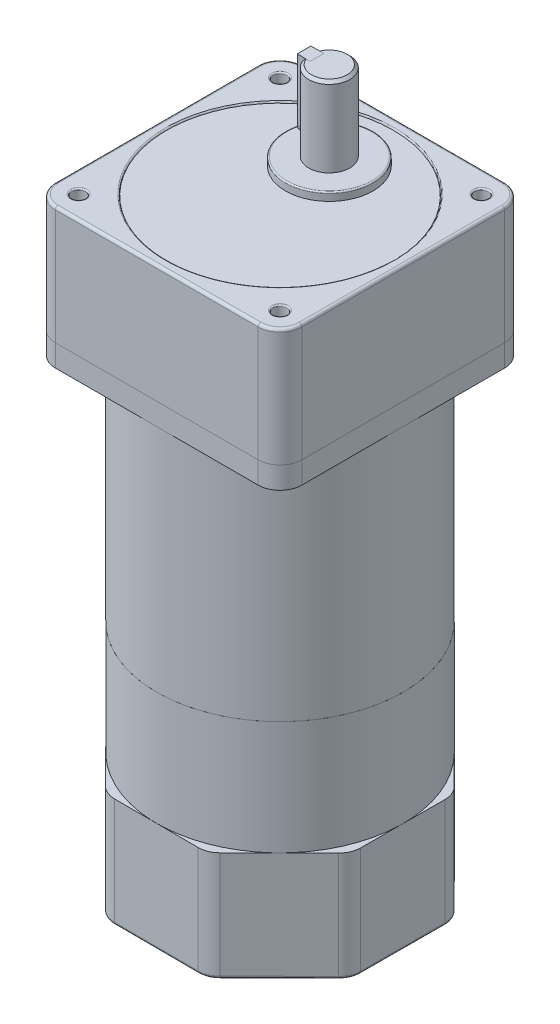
ISO-10303-21;
HEADER;
FILE_DESCRIPTION(('STEP AP214'),'2;1');
FILE_NAME('part.step','',(''),(''),'','','');
FILE_SCHEMA(('AUTOMOTIVE_DESIGN { 1 0 10303 214 1 1 1 1 }'));
ENDSEC;
DATA;
#1=APPLICATION_CONTEXT('core data for automotive mechanical design processes');
#2=APPLICATION_PROTOCOL_DEFINITION('international standard','automotive_design',2000,#1);
#3=PRODUCT_CONTEXT('',#1,'mechanical');
#4=PRODUCT('Part','Part','',(#3));
#5=PRODUCT_RELATED_PRODUCT_CATEGORY('part','',(#4));
#6=PRODUCT_DEFINITION_FORMATION('','',#4);
#7=PRODUCT_DEFINITION_CONTEXT('part definition',#1,'design');
#8=PRODUCT_DEFINITION('design','',#6,#7);
#9=PRODUCT_DEFINITION_SHAPE('','',#8);
#10=(LENGTH_UNIT() NAMED_UNIT(*) SI_UNIT(.MILLI.,.METRE.));
#11=(NAMED_UNIT(*) PLANE_ANGLE_UNIT() SI_UNIT($,.RADIAN.));
#12=(NAMED_UNIT(*) SI_UNIT($,.STERADIAN.) SOLID_ANGLE_UNIT());
#13=UNCERTAINTY_MEASURE_WITH_UNIT(LENGTH_MEASURE(1.E-05),#10,'distance_accuracy_value','');
#14=(GEOMETRIC_REPRESENTATION_CONTEXT(3) GLOBAL_UNCERTAINTY_ASSIGNED_CONTEXT((#13)) GLOBAL_UNIT_ASSIGNED_CONTEXT((#10,
#11,#12)) REPRESENTATION_CONTEXT('',''));
#15=CARTESIAN_POINT('',(0.,0.,0.));
#16=DIRECTION('',(0.,0.,1.));
#17=DIRECTION('',(1.,0.,0.));
#18=AXIS2_PLACEMENT_3D('',#15,#16,#17);
#19=CARTESIAN_POINT('',(-9.5,9.5,-18.));
#20=DIRECTION('',(1.,0.,0.));
#21=DIRECTION('',(0.,0.,-1.));
#22=AXIS2_PLACEMENT_3D('',#19,#20,#21);
#23=CYLINDRICAL_SURFACE('',#22,2.5);
#24=DIRECTION('',(1.,0.,0.));
#25=VECTOR('',#24,1.);
#26=CARTESIAN_POINT('',(-9.5,9.5,-15.5));
#27=LINE('',#26,#25);
#28=CARTESIAN_POINT('',(-9.19999999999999,9.5,-15.5));
#29=VERTEX_POINT('',#28);
#30=CARTESIAN_POINT('',(-4.5,9.5,-15.5));
#31=VERTEX_POINT('',#30);
#32=EDGE_CURVE('E99',#29,#31,#27,.T.);
#33=ORIENTED_EDGE('',*,*,#32,.F.);
#34=CARTESIAN_POINT('',(-9.19999999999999,9.5,-18.));
#35=DIRECTION('',(-1.,0.,0.));
#36=DIRECTION('',(0.,0.,1.));
#37=AXIS2_PLACEMENT_3D('',#34,#35,#36);
#38=CIRCLE('',#37,2.5);
#39=CARTESIAN_POINT('',(-9.19999999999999,9.5,-20.5));
#40=VERTEX_POINT('',#39);
#41=EDGE_CURVE('E57',#29,#40,#38,.F.);
#42=ORIENTED_EDGE('',*,*,#41,.T.);
#43=DIRECTION('',(1.,0.,0.));
#44=VECTOR('',#43,1.);
#45=CARTESIAN_POINT('',(-9.5,9.5,-20.5));
#46=LINE('',#45,#44);
#47=CARTESIAN_POINT('',(-4.5,9.5,-20.5));
#48=VERTEX_POINT('',#47);
#49=EDGE_CURVE('E116',#40,#48,#46,.T.);
#50=ORIENTED_EDGE('',*,*,#49,.T.);
#51=CARTESIAN_POINT('',(-4.5,9.5,-18.));
#52=DIRECTION('',(-1.,0.,0.));
#53=DIRECTION('',(0.,0.,1.));
#54=AXIS2_PLACEMENT_3D('',#51,#52,#53);
#55=CIRCLE('',#54,2.5);
#56=EDGE_CURVE('E112',#48,#31,#55,.T.);
#57=ORIENTED_EDGE('',*,*,#56,.T.);
#58=EDGE_LOOP('',(#33,#42,#50,#57));
#59=FACE_BOUND('',#58,.T.);
#60=ADVANCED_FACE('F48',(#59),#23,.T.);
#61=CARTESIAN_POINT('',(-9.5,32.,-15.5));
#62=DIRECTION('',(0.,0.,-1.));
#63=DIRECTION('',(-1.,0.,0.));
#64=AXIS2_PLACEMENT_3D('',#61,#62,#63);
#65=PLANE('',#64);
#66=DIRECTION('',(1.,0.,0.));
#67=VECTOR('',#66,1.);
#68=CARTESIAN_POINT('',(-9.5,32.,-15.5));
#69=LINE('',#68,#67);
#70=CARTESIAN_POINT('',(-9.19999999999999,32.,-15.5));
#71=VERTEX_POINT('',#70);
#72=CARTESIAN_POINT('',(-4.5,32.,-15.5));
#73=VERTEX_POINT('',#72);
#74=EDGE_CURVE('E106',#71,#73,#69,.T.);
#75=ORIENTED_EDGE('',*,*,#74,.F.);
#76=DIRECTION('',(0.,-1.,0.));
#77=VECTOR('',#76,1.);
#78=CARTESIAN_POINT('',(-9.19999999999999,9.5,-15.5));
#79=LINE('',#78,#77);
#80=EDGE_CURVE('E12',#71,#29,#79,.T.);
#81=ORIENTED_EDGE('',*,*,#80,.T.);
#82=ORIENTED_EDGE('',*,*,#32,.T.);
#83=DIRECTION('',(0.,1.,0.));
#84=VECTOR('',#83,1.);
#85=CARTESIAN_POINT('',(-4.5,32.,-15.5));
#86=LINE('',#85,#84);
#87=EDGE_CURVE('E102',#31,#73,#86,.T.);
#88=ORIENTED_EDGE('',*,*,#87,.T.);
#89=EDGE_LOOP('',(#75,#81,#82,#88));
#90=FACE_BOUND('',#89,.T.);
#91=ADVANCED_FACE('F101',(#90),#65,.F.);
#92=CARTESIAN_POINT('',(-9.5,32.,-20.5));
#93=DIRECTION('',(0.,-1.,0.));
#94=DIRECTION('',(0.,0.,-1.));
#95=AXIS2_PLACEMENT_3D('',#92,#93,#94);
#96=PLANE('',#95);
#97=DIRECTION('',(1.,0.,0.));
#98=VECTOR('',#97,1.);
#99=CARTESIAN_POINT('',(-9.5,32.,-20.5));
#100=LINE('',#99,#98);
#101=CARTESIAN_POINT('',(-9.19999999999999,32.,-20.5));
#102=VERTEX_POINT('',#101);
#103=CARTESIAN_POINT('',(-4.5,32.,-20.5));
#104=VERTEX_POINT('',#103);
#105=EDGE_CURVE('E126',#102,#104,#100,.T.);
#106=ORIENTED_EDGE('',*,*,#105,.F.);
#107=DIRECTION('',(0.,0.,1.));
#108=VECTOR('',#107,1.);
#109=CARTESIAN_POINT('',(-9.19999999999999,32.,-15.5));
#110=LINE('',#109,#108);
#111=EDGE_CURVE('E137',#102,#71,#110,.T.);
#112=ORIENTED_EDGE('',*,*,#111,.T.);
#113=ORIENTED_EDGE('',*,*,#74,.T.);
#114=DIRECTION('',(0.,0.,-1.));
#115=VECTOR('',#114,1.);
#116=CARTESIAN_POINT('',(-4.5,32.,-20.5));
#117=LINE('',#116,#115);
#118=EDGE_CURVE('E114',#73,#104,#117,.T.);
#119=ORIENTED_EDGE('',*,*,#118,.T.);
#120=EDGE_LOOP('',(#106,#112,#113,#119));
#121=FACE_BOUND('',#120,.T.);
#122=ADVANCED_FACE('F166',(#121),#96,.F.);
#123=CARTESIAN_POINT('',(-9.5,9.5,-20.5));
#124=DIRECTION('',(0.,0.,1.));
#125=DIRECTION('',(1.,0.,0.));
#126=AXIS2_PLACEMENT_3D('',#123,#124,#125);
#127=PLANE('',#126);
#128=ORIENTED_EDGE('',*,*,#49,.F.);
#129=DIRECTION('',(0.,1.,0.));
#130=VECTOR('',#129,1.);
#131=CARTESIAN_POINT('',(-9.19999999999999,32.,-20.5));
#132=LINE('',#131,#130);
#133=EDGE_CURVE('E140',#40,#102,#132,.T.);
#134=ORIENTED_EDGE('',*,*,#133,.T.);
#135=ORIENTED_EDGE('',*,*,#105,.T.);
#136=DIRECTION('',(0.,-1.,0.));
#137=VECTOR('',#136,1.);
#138=CARTESIAN_POINT('',(-4.5,9.5,-20.5));
#139=LINE('',#138,#137);
#140=EDGE_CURVE('E123',#104,#48,#139,.T.);
#141=ORIENTED_EDGE('',*,*,#140,.T.);
#142=EDGE_LOOP('',(#128,#134,#135,#141));
#143=FACE_BOUND('',#142,.T.);
#144=ADVANCED_FACE('F168',(#143),#127,.F.);
#145=CARTESIAN_POINT('',(-9.5,9.5,-18.));
#146=DIRECTION('',(-1.,0.,0.));
#147=DIRECTION('',(0.,0.,1.));
#148=AXIS2_PLACEMENT_3D('',#145,#146,#147);
#149=PLANE('',#148);
#150=DIRECTION('',(0.,1.,0.));
#151=VECTOR('',#150,1.);
#152=CARTESIAN_POINT('',(-9.5,32.,-15.8));
#153=LINE('',#152,#151);
#154=CARTESIAN_POINT('',(-9.5,9.5,-15.8));
#155=VERTEX_POINT('',#154);
#156=CARTESIAN_POINT('',(-9.5,31.7,-15.8));
#157=VERTEX_POINT('',#156);
#158=EDGE_CURVE('E105',#155,#157,#153,.T.);
#159=ORIENTED_EDGE('',*,*,#158,.T.);
#160=DIRECTION('',(0.,0.,-1.));
#161=VECTOR('',#160,1.);
#162=CARTESIAN_POINT('',(-9.5,31.7,-20.5));
#163=LINE('',#162,#161);
#164=CARTESIAN_POINT('',(-9.5,31.7,-20.2));
#165=VERTEX_POINT('',#164);
#166=EDGE_CURVE('E134',#157,#165,#163,.T.);
#167=ORIENTED_EDGE('',*,*,#166,.T.);
#168=DIRECTION('',(0.,-1.,0.));
#169=VECTOR('',#168,1.);
#170=CARTESIAN_POINT('',(-9.5,9.5,-20.2));
#171=LINE('',#170,#169);
#172=CARTESIAN_POINT('',(-9.5,9.5,-20.2));
#173=VERTEX_POINT('',#172);
#174=EDGE_CURVE('E132',#165,#173,#171,.T.);
#175=ORIENTED_EDGE('',*,*,#174,.T.);
#176=CARTESIAN_POINT('',(-9.5,9.5,-18.));
#177=DIRECTION('',(-1.,0.,0.));
#178=DIRECTION('',(0.,0.,1.));
#179=AXIS2_PLACEMENT_3D('',#176,#177,#178);
#180=CIRCLE('',#179,2.19999999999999);
#181=EDGE_CURVE('E130',#173,#155,#180,.T.);
#182=ORIENTED_EDGE('',*,*,#181,.T.);
#183=EDGE_LOOP('',(#159,#167,#175,#182));
#184=FACE_BOUND('',#183,.T.);
#185=ADVANCED_FACE('F158',(#184),#149,.T.);
#186=CARTESIAN_POINT('',(-4.5,9.5,-18.));
#187=DIRECTION('',(-1.,0.,0.));
#188=DIRECTION('',(0.,0.,1.));
#189=AXIS2_PLACEMENT_3D('',#186,#187,#188);
#190=PLANE('',#189);
#191=ORIENTED_EDGE('',*,*,#56,.F.);
#192=ORIENTED_EDGE('',*,*,#140,.F.);
#193=ORIENTED_EDGE('',*,*,#118,.F.);
#194=ORIENTED_EDGE('',*,*,#87,.F.);
#195=EDGE_LOOP('',(#191,#192,#193,#194));
#196=FACE_BOUND('',#195,.T.);
#197=ADVANCED_FACE('F110',(#196),#190,.F.);
#198=CARTESIAN_POINT('',(-9.5,9.5,-18.));
#199=DIRECTION('',(1.,0.,0.));
#200=DIRECTION('',(0.,0.,-1.));
#201=AXIS2_PLACEMENT_3D('',#198,#199,#200);
#202=CONICAL_SURFACE('',#201,2.19999999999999,0.785398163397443);
#203=DIRECTION('',(-0.707106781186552,0.,0.707106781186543));
#204=VECTOR('',#203,1.);
#205=CARTESIAN_POINT('',(-9.19999999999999,9.5,-20.5));
#206=LINE('',#205,#204);
#207=EDGE_CURVE('E120',#40,#173,#206,.T.);
#208=ORIENTED_EDGE('',*,*,#207,.F.);
#209=ORIENTED_EDGE('',*,*,#41,.F.);
#210=DIRECTION('',(0.707106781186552,0.,0.707106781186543));
#211=VECTOR('',#210,1.);
#212=CARTESIAN_POINT('',(-9.5,9.5,-15.8));
#213=LINE('',#212,#211);
#214=EDGE_CURVE('E52',#155,#29,#213,.T.);
#215=ORIENTED_EDGE('',*,*,#214,.F.);
#216=ORIENTED_EDGE('',*,*,#181,.F.);
#217=EDGE_LOOP('',(#208,#209,#215,#216));
#218=FACE_BOUND('',#217,.T.);
#219=ADVANCED_FACE('F50',(#218),#202,.T.);
#220=CARTESIAN_POINT('',(-9.5,9.5,-15.8));
#221=DIRECTION('',(-0.707106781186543,0.,0.707106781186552));
#222=DIRECTION('',(0.,-1.,0.));
#223=AXIS2_PLACEMENT_3D('',#220,#221,#222);
#224=PLANE('',#223);
#225=ORIENTED_EDGE('',*,*,#214,.T.);
#226=ORIENTED_EDGE('',*,*,#80,.F.);
#227=DIRECTION('',(-0.577350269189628,-0.577350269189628,-0.577350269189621));
#228=VECTOR('',#227,1.);
#229=CARTESIAN_POINT('',(-16.9000000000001,24.2999999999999,-23.2));
#230=LINE('',#229,#228);
#231=EDGE_CURVE('E145',#157,#71,#230,.F.);
#232=ORIENTED_EDGE('',*,*,#231,.F.);
#233=ORIENTED_EDGE('',*,*,#158,.F.);
#234=EDGE_LOOP('',(#225,#226,#232,#233));
#235=FACE_BOUND('',#234,.T.);
#236=ADVANCED_FACE('F188',(#235),#224,.T.);
#237=CARTESIAN_POINT('',(-9.5,9.5,-20.2));
#238=DIRECTION('',(-0.707106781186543,0.,-0.707106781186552));
#239=DIRECTION('',(0.,1.,0.));
#240=AXIS2_PLACEMENT_3D('',#237,#238,#239);
#241=PLANE('',#240);
#242=ORIENTED_EDGE('',*,*,#207,.T.);
#243=ORIENTED_EDGE('',*,*,#174,.F.);
#244=DIRECTION('',(0.577350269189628,0.577350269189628,-0.577350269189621));
#245=VECTOR('',#244,1.);
#246=CARTESIAN_POINT('',(-16.9000000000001,24.2999999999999,-12.8));
#247=LINE('',#246,#245);
#248=EDGE_CURVE('E143',#102,#165,#247,.F.);
#249=ORIENTED_EDGE('',*,*,#248,.F.);
#250=ORIENTED_EDGE('',*,*,#133,.F.);
#251=EDGE_LOOP('',(#242,#243,#249,#250));
#252=FACE_BOUND('',#251,.T.);
#253=ADVANCED_FACE('F151',(#252),#241,.T.);
#254=CARTESIAN_POINT('',(-9.5,31.7,-18.));
#255=DIRECTION('',(-0.707106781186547,0.707106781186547,0.));
#256=DIRECTION('',(0.,0.,1.));
#257=AXIS2_PLACEMENT_3D('',#254,#255,#256);
#258=PLANE('',#257);
#259=ORIENTED_EDGE('',*,*,#231,.T.);
#260=ORIENTED_EDGE('',*,*,#111,.F.);
#261=ORIENTED_EDGE('',*,*,#248,.T.);
#262=ORIENTED_EDGE('',*,*,#166,.F.);
#263=EDGE_LOOP('',(#259,#260,#261,#262));
#264=FACE_BOUND('',#263,.T.);
#265=ADVANCED_FACE('F162',(#264),#258,.T.);
#266=CLOSED_SHELL('',(#60,#91,#122,#144,#185,#197,#219,#236,#253,#265));
#267=MANIFOLD_SOLID_BREP('B2',#266);
#268=CARTESIAN_POINT('',(0.,32.,-18.));
#269=DIRECTION('',(0.,-1.,0.));
#270=DIRECTION('',(0.,0.,-1.));
#271=AXIS2_PLACEMENT_3D('',#268,#269,#270);
#272=CYLINDRICAL_SURFACE('',#271,7.5);
#273=CARTESIAN_POINT('',(0.,3.,-18.));
#274=DIRECTION('',(0.,1.,0.));
#275=DIRECTION('',(0.,0.,1.));
#276=AXIS2_PLACEMENT_3D('',#273,#274,#275);
#277=CIRCLE('',#276,7.5);
#278=CARTESIAN_POINT('',(0.,3.,-10.5));
#279=VERTEX_POINT('',#278);
#280=EDGE_CURVE('E340',#279,#279,#277,.T.);
#281=ORIENTED_EDGE('',*,*,#280,.T.);
#282=EDGE_LOOP('',(#281));
#283=FACE_BOUND('',#282,.T.);
#284=DIRECTION('',(0.,-1.,0.));
#285=VECTOR('',#284,1.);
#286=CARTESIAN_POINT('',(-7.07106781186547,32.,-20.5));
#287=LINE('',#286,#285);
#288=CARTESIAN_POINT('',(-7.07106781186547,31.,-20.5));
#289=VERTEX_POINT('',#288);
#290=CARTESIAN_POINT('',(-7.07106781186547,9.5,-20.5));
#291=VERTEX_POINT('',#290);
#292=EDGE_CURVE('E329',#289,#291,#287,.T.);
#293=ORIENTED_EDGE('',*,*,#292,.F.);
#294=CARTESIAN_POINT('',(0.,31.,-18.));
#295=DIRECTION('',(0.,1.,0.));
#296=DIRECTION('',(0.,0.,1.));
#297=AXIS2_PLACEMENT_3D('',#294,#295,#296);
#298=CIRCLE('',#297,7.5);
#299=CARTESIAN_POINT('',(-7.07106781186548,31.,-15.5));
#300=VERTEX_POINT('',#299);
#301=EDGE_CURVE('E273',#289,#300,#298,.F.);
#302=ORIENTED_EDGE('',*,*,#301,.T.);
#303=DIRECTION('',(0.,-1.,0.));
#304=VECTOR('',#303,1.);
#305=CARTESIAN_POINT('',(-7.07106781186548,32.,-15.5));
#306=LINE('',#305,#304);
#307=CARTESIAN_POINT('',(-7.07106781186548,9.5,-15.5));
#308=VERTEX_POINT('',#307);
#309=EDGE_CURVE('E331',#308,#300,#306,.F.);
#310=ORIENTED_EDGE('',*,*,#309,.F.);
#311=CARTESIAN_POINT('',(-7.07106781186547,9.5,-20.5));
#312=CARTESIAN_POINT('',(-7.07105693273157,9.43179292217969,-20.5000089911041));
#313=CARTESIAN_POINT('',(-7.07205443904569,9.36359192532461,-20.4972088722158));
#314=CARTESIAN_POINT('',(-7.07598524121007,9.22771896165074,-20.4860604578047));
#315=CARTESIAN_POINT('',(-7.07891801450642,9.16004685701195,-20.477713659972));
#316=CARTESIAN_POINT('',(-7.08662705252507,9.02590951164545,-20.455574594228));
#317=CARTESIAN_POINT('',(-7.09139784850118,8.95944129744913,-20.4417984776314));
#318=CARTESIAN_POINT('',(-7.10262619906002,8.8279917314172,-20.4089418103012));
#319=CARTESIAN_POINT('',(-7.10908381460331,8.7630104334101,-20.3898610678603));
#320=CARTESIAN_POINT('',(-7.13069940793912,8.57103842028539,-20.324915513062));
#321=CARTESIAN_POINT('',(-7.14811243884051,8.44682084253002,-20.2713141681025));
#322=CARTESIAN_POINT('',(-7.1869703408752,8.20912318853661,-20.1451778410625));
#323=CARTESIAN_POINT('',(-7.20841768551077,8.09564976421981,-20.0726312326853));
#324=CARTESIAN_POINT('',(-7.25386182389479,7.87820709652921,-19.9076299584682));
#325=CARTESIAN_POINT('',(-7.27792189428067,7.7747148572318,-19.8145628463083));
#326=CARTESIAN_POINT('',(-7.32534626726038,7.58448289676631,-19.6124707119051));
#327=CARTESIAN_POINT('',(-7.34871044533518,7.49774615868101,-19.5034428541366));
#328=CARTESIAN_POINT('',(-7.39284706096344,7.34130177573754,-19.2690092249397));
#329=CARTESIAN_POINT('',(-7.41353593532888,7.27209769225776,-19.1432502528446));
#330=CARTESIAN_POINT('',(-7.44924021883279,7.1560192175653,-18.8810730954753));
#331=CARTESIAN_POINT('',(-7.46425736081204,7.10913800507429,-18.7446581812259));
#332=CARTESIAN_POINT('',(-7.48647677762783,7.04066072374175,-18.4700733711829));
#333=CARTESIAN_POINT('',(-7.49393272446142,7.01824182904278,-18.3321295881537));
#334=CARTESIAN_POINT('',(-7.50109021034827,6.99670924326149,-18.0542474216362));
#335=CARTESIAN_POINT('',(-7.50079359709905,6.99758999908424,-17.9143095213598));
#336=CARTESIAN_POINT('',(-7.49265096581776,7.0221107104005,-17.6422403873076));
#337=CARTESIAN_POINT('',(-7.48510152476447,7.04485659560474,-17.5100182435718));
#338=CARTESIAN_POINT('',(-7.46367401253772,7.1109829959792,-17.2513898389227));
#339=CARTESIAN_POINT('',(-7.44979559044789,7.15436465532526,-17.1249839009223));
#340=CARTESIAN_POINT('',(-7.41689170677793,7.26105342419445,-16.8796184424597));
#341=CARTESIAN_POINT('',(-7.39780094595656,7.32461511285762,-16.760778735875));
#342=CARTESIAN_POINT('',(-7.35645969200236,7.46964987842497,-16.5351885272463));
#343=CARTESIAN_POINT('',(-7.33420833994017,7.55112782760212,-16.4284413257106));
#344=CARTESIAN_POINT('',(-7.28765679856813,7.73417762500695,-16.2247566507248));
#345=CARTESIAN_POINT('',(-7.26330946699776,7.83651385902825,-16.128515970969));
#346=CARTESIAN_POINT('',(-7.21618726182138,8.05610372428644,-15.9543199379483));
#347=CARTESIAN_POINT('',(-7.19341289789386,8.17336215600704,-15.8763704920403));
#348=CARTESIAN_POINT('',(-7.15175078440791,8.4217004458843,-15.7399916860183));
#349=CARTESIAN_POINT('',(-7.13292537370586,8.55295878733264,-15.6818674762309));
#350=CARTESIAN_POINT('',(-7.10202742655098,8.8241174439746,-15.5888494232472));
#351=CARTESIAN_POINT('',(-7.08994423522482,8.96400373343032,-15.5539189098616));
#352=CARTESIAN_POINT('',(-7.078413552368,9.17104659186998,-15.5208546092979));
#353=CARTESIAN_POINT('',(-7.07566669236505,9.23660347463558,-15.5130373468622));
#354=CARTESIAN_POINT('',(-7.07199258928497,9.36809519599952,-15.502613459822));
#355=CARTESIAN_POINT('',(-7.0710629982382,9.43402943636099,-15.5000001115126));
#356=CARTESIAN_POINT('',(-7.07106781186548,9.5,-15.5));
#357=B_SPLINE_CURVE_WITH_KNOTS('',3,(#311,#312,#313,#314,#315,#316,#317,#318,#319,#320,#321,
#322,#323,#324,#325,#326,#327,#328,#329,#330,#331,#332,#333,#334,#335,#336,#337,#338,#339,#340,
#341,#342,#343,#344,#345,#346,#347,#348,#349,#350,#351,#352,#353,#354,#355,#356),.UNSPECIFIED.,
.F.,.F.,(4,2,2,2,2,2,2,2,2,2,2,2,2,2,2,2,2,2,2,2,2,2,4),(0.,0.204546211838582,0.409037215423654,
0.612924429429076,0.81681901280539,1.22401016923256,1.63145179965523,2.0532786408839,
2.47518051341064,2.90809434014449,3.34087579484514,3.75860278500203,4.17623021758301,
4.57747647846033,4.97874498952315,5.38529148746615,5.79194868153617,6.21771736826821,
6.64362337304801,7.07581676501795,7.50732520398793,7.70536340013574,7.90314555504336),.UNSPECIFIED.);
#358=EDGE_CURVE('E343',#291,#308,#357,.T.);
#359=ORIENTED_EDGE('',*,*,#358,.F.);
#360=EDGE_LOOP('',(#293,#302,#310,#359));
#361=FACE_BOUND('',#360,.T.);
#362=ADVANCED_FACE('F260',(#283,#361),#272,.T.);
#363=CARTESIAN_POINT('',(0.,32.,-18.));
#364=DIRECTION('',(0.,1.,0.));
#365=DIRECTION('',(0.,0.,1.));
#366=AXIS2_PLACEMENT_3D('',#363,#364,#365);
#367=PLANE('',#366);
#368=DIRECTION('',(-1.,0.,0.));
#369=VECTOR('',#368,1.);
#370=CARTESIAN_POINT('',(-4.5,32.,-15.5));
#371=LINE('',#370,#369);
#372=CARTESIAN_POINT('',(-4.5,32.,-15.5));
#373=VERTEX_POINT('',#372);
#374=CARTESIAN_POINT('',(-6.00000000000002,32.,-15.5));
#375=VERTEX_POINT('',#374);
#376=EDGE_CURVE('E335',#373,#375,#371,.T.);
#377=ORIENTED_EDGE('',*,*,#376,.T.);
#378=CARTESIAN_POINT('',(0.,32.,-18.));
#379=DIRECTION('',(0.,1.,0.));
#380=DIRECTION('',(0.,0.,1.));
#381=AXIS2_PLACEMENT_3D('',#378,#379,#380);
#382=CIRCLE('',#381,6.50000000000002);
#383=CARTESIAN_POINT('',(-6.00000000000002,32.,-20.5));
#384=VERTEX_POINT('',#383);
#385=EDGE_CURVE('E349',#375,#384,#382,.T.);
#386=ORIENTED_EDGE('',*,*,#385,.T.);
#387=DIRECTION('',(-1.,0.,0.));
#388=VECTOR('',#387,1.);
#389=CARTESIAN_POINT('',(-4.5,32.,-20.5));
#390=LINE('',#389,#388);
#391=CARTESIAN_POINT('',(-4.5,32.,-20.5));
#392=VERTEX_POINT('',#391);
#393=EDGE_CURVE('E332',#392,#384,#390,.T.);
#394=ORIENTED_EDGE('',*,*,#393,.F.);
#395=DIRECTION('',(0.,0.,1.));
#396=VECTOR('',#395,1.);
#397=CARTESIAN_POINT('',(-4.5,32.,-20.5));
#398=LINE('',#397,#396);
#399=EDGE_CURVE('E316',#392,#373,#398,.T.);
#400=ORIENTED_EDGE('',*,*,#399,.T.);
#401=EDGE_LOOP('',(#377,#386,#394,#400));
#402=FACE_BOUND('',#401,.T.);
#403=ADVANCED_FACE('F359',(#402),#367,.T.);
#404=CARTESIAN_POINT('',(0.,3.,-18.));
#405=DIRECTION('',(0.,1.,0.));
#406=DIRECTION('',(0.,0.,1.));
#407=AXIS2_PLACEMENT_3D('',#404,#405,#406);
#408=PLANE('',#407);
#409=ORIENTED_EDGE('',*,*,#280,.F.);
#410=EDGE_LOOP('',(#409));
#411=FACE_BOUND('',#410,.T.);
#412=ADVANCED_FACE('F357',(#411),#408,.F.);
#413=CARTESIAN_POINT('',(-4.5,9.5,-18.));
#414=DIRECTION('',(-1.,0.,0.));
#415=DIRECTION('',(0.,0.,1.));
#416=AXIS2_PLACEMENT_3D('',#413,#414,#415);
#417=CYLINDRICAL_SURFACE('',#416,2.5);
#418=DIRECTION('',(-1.,0.,0.));
#419=VECTOR('',#418,1.);
#420=CARTESIAN_POINT('',(-4.5,9.5,-20.5));
#421=LINE('',#420,#419);
#422=CARTESIAN_POINT('',(-4.5,9.5,-20.5));
#423=VERTEX_POINT('',#422);
#424=EDGE_CURVE('E324',#423,#291,#421,.T.);
#425=ORIENTED_EDGE('',*,*,#424,.T.);
#426=ORIENTED_EDGE('',*,*,#358,.T.);
#427=DIRECTION('',(-1.,0.,0.));
#428=VECTOR('',#427,1.);
#429=CARTESIAN_POINT('',(-4.5,9.5,-15.5));
#430=LINE('',#429,#428);
#431=CARTESIAN_POINT('',(-4.5,9.5,-15.5));
#432=VERTEX_POINT('',#431);
#433=EDGE_CURVE('E326',#432,#308,#430,.T.);
#434=ORIENTED_EDGE('',*,*,#433,.F.);
#435=CARTESIAN_POINT('',(-4.5,9.5,-18.));
#436=DIRECTION('',(1.,0.,0.));
#437=DIRECTION('',(0.,0.,-1.));
#438=AXIS2_PLACEMENT_3D('',#435,#436,#437);
#439=CIRCLE('',#438,2.5);
#440=EDGE_CURVE('E314',#432,#423,#439,.T.);
#441=ORIENTED_EDGE('',*,*,#440,.T.);
#442=EDGE_LOOP('',(#425,#426,#434,#441));
#443=FACE_BOUND('',#442,.T.);
#444=ADVANCED_FACE('F323',(#443),#417,.F.);
#445=CARTESIAN_POINT('',(-4.5,9.5,-20.5));
#446=DIRECTION('',(0.,0.,1.));
#447=DIRECTION('',(1.,0.,0.));
#448=AXIS2_PLACEMENT_3D('',#445,#446,#447);
#449=PLANE('',#448);
#450=ORIENTED_EDGE('',*,*,#393,.T.);
#451=CARTESIAN_POINT('',(-6.00000000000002,32.,-20.5));
#452=CARTESIAN_POINT('',(-6.0897273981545,31.9171731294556,-20.5));
#453=CARTESIAN_POINT('',(-6.17931930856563,31.8341996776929,-20.5));
#454=CARTESIAN_POINT('',(-6.35825867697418,31.6679908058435,-20.5));
#455=CARTESIAN_POINT('',(-6.44760613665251,31.5847553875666,-20.5));
#456=CARTESIAN_POINT('',(-6.62608424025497,31.4180527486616,-20.5));
#457=CARTESIAN_POINT('',(-6.7152148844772,31.3345855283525,-20.5));
#458=CARTESIAN_POINT('',(-6.89328182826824,31.1674427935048,-20.5));
#459=CARTESIAN_POINT('',(-6.98221812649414,31.0837672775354,-20.5));
#460=CARTESIAN_POINT('',(-7.07106781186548,31.,-20.5));
#461=B_SPLINE_CURVE_WITH_KNOTS('',3,(#451,#452,#453,#454,#455,#456,#457,#458,#459,#460),
.UNSPECIFIED.,.F.,.F.,(4,2,2,2,4),(0.,0.366335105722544,0.732667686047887,1.09899976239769,
1.46533436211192),.UNSPECIFIED.);
#462=EDGE_CURVE('E287',#384,#289,#461,.T.);
#463=ORIENTED_EDGE('',*,*,#462,.T.);
#464=ORIENTED_EDGE('',*,*,#292,.T.);
#465=ORIENTED_EDGE('',*,*,#424,.F.);
#466=DIRECTION('',(0.,1.,0.));
#467=VECTOR('',#466,1.);
#468=CARTESIAN_POINT('',(-4.5,9.5,-20.5));
#469=LINE('',#468,#467);
#470=EDGE_CURVE('E311',#423,#392,#469,.T.);
#471=ORIENTED_EDGE('',*,*,#470,.T.);
#472=EDGE_LOOP('',(#450,#463,#464,#465,#471));
#473=FACE_BOUND('',#472,.T.);
#474=ADVANCED_FACE('F328',(#473),#449,.T.);
#475=CARTESIAN_POINT('',(-4.5,32.,-15.5));
#476=DIRECTION('',(0.,0.,-1.));
#477=DIRECTION('',(-1.,0.,0.));
#478=AXIS2_PLACEMENT_3D('',#475,#476,#477);
#479=PLANE('',#478);
#480=ORIENTED_EDGE('',*,*,#309,.T.);
#481=CARTESIAN_POINT('',(-7.07106781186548,31.,-15.5));
#482=CARTESIAN_POINT('',(-6.98221812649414,31.0837672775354,-15.5));
#483=CARTESIAN_POINT('',(-6.89328182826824,31.1674427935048,-15.5));
#484=CARTESIAN_POINT('',(-6.7152148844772,31.3345855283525,-15.5));
#485=CARTESIAN_POINT('',(-6.62608424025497,31.4180527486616,-15.5));
#486=CARTESIAN_POINT('',(-6.44760613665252,31.5847553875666,-15.5));
#487=CARTESIAN_POINT('',(-6.35825867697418,31.6679908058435,-15.5));
#488=CARTESIAN_POINT('',(-6.17931930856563,31.8341996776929,-15.5));
#489=CARTESIAN_POINT('',(-6.0897273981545,31.9171731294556,-15.5));
#490=CARTESIAN_POINT('',(-6.00000000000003,32.,-15.5));
#491=B_SPLINE_CURVE_WITH_KNOTS('',3,(#481,#482,#483,#484,#485,#486,#487,#488,#489,#490),
.UNSPECIFIED.,.F.,.F.,(4,2,2,2,4),(0.,0.36633459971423,0.732666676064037,1.09899925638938,
1.46533436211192),.UNSPECIFIED.);
#492=EDGE_CURVE('E46',#300,#375,#491,.T.);
#493=ORIENTED_EDGE('',*,*,#492,.T.);
#494=ORIENTED_EDGE('',*,*,#376,.F.);
#495=DIRECTION('',(0.,-1.,0.));
#496=VECTOR('',#495,1.);
#497=CARTESIAN_POINT('',(-4.5,32.,-15.5));
#498=LINE('',#497,#496);
#499=EDGE_CURVE('E381',#373,#432,#498,.T.);
#500=ORIENTED_EDGE('',*,*,#499,.T.);
#501=ORIENTED_EDGE('',*,*,#433,.T.);
#502=EDGE_LOOP('',(#480,#493,#494,#500,#501));
#503=FACE_BOUND('',#502,.T.);
#504=ADVANCED_FACE('F385',(#503),#479,.T.);
#505=CARTESIAN_POINT('',(-4.5,9.5,-18.));
#506=DIRECTION('',(1.,0.,0.));
#507=DIRECTION('',(0.,0.,-1.));
#508=AXIS2_PLACEMENT_3D('',#505,#506,#507);
#509=PLANE('',#508);
#510=ORIENTED_EDGE('',*,*,#440,.F.);
#511=ORIENTED_EDGE('',*,*,#499,.F.);
#512=ORIENTED_EDGE('',*,*,#399,.F.);
#513=ORIENTED_EDGE('',*,*,#470,.F.);
#514=EDGE_LOOP('',(#510,#511,#512,#513));
#515=FACE_BOUND('',#514,.T.);
#516=ADVANCED_FACE('F313',(#515),#509,.F.);
#517=CARTESIAN_POINT('',(0.,32.,-18.));
#518=DIRECTION('',(0.,-1.,0.));
#519=DIRECTION('',(0.,0.,-1.));
#520=AXIS2_PLACEMENT_3D('',#517,#518,#519);
#521=CONICAL_SURFACE('',#520,6.50000000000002,0.785398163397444);
#522=ORIENTED_EDGE('',*,*,#492,.F.);
#523=ORIENTED_EDGE('',*,*,#301,.F.);
#524=ORIENTED_EDGE('',*,*,#462,.F.);
#525=ORIENTED_EDGE('',*,*,#385,.F.);
#526=EDGE_LOOP('',(#522,#523,#524,#525));
#527=FACE_BOUND('',#526,.T.);
#528=ADVANCED_FACE('F262',(#527),#521,.T.);
#529=CLOSED_SHELL('',(#362,#403,#412,#444,#474,#504,#516,#528));
#530=MANIFOLD_SOLID_BREP('B6',#529);
#531=CARTESIAN_POINT('',(0.,3.,-18.));
#532=DIRECTION('',(0.,-1.,0.));
#533=DIRECTION('',(0.,0.,-1.));
#534=AXIS2_PLACEMENT_3D('',#531,#532,#533);
#535=CYLINDRICAL_SURFACE('',#534,16.);
#536=CARTESIAN_POINT('',(0.,2.5,-18.));
#537=DIRECTION('',(0.,1.,0.));
#538=DIRECTION('',(0.,0.,1.));
#539=AXIS2_PLACEMENT_3D('',#536,#537,#538);
#540=CIRCLE('',#539,16.);
#541=CARTESIAN_POINT('',(0.,2.5,-2.));
#542=VERTEX_POINT('',#541);
#543=EDGE_CURVE('E259',#542,#542,#540,.F.);
#544=ORIENTED_EDGE('',*,*,#543,.T.);
#545=EDGE_LOOP('',(#544));
#546=FACE_BOUND('',#545,.T.);
#547=CARTESIAN_POINT('',(0.,0.,-18.));
#548=DIRECTION('',(0.,1.,0.));
#549=DIRECTION('',(0.,0.,1.));
#550=AXIS2_PLACEMENT_3D('',#547,#548,#549);
#551=CIRCLE('',#550,16.);
#552=CARTESIAN_POINT('',(0.,0.,-2.));
#553=VERTEX_POINT('',#552);
#554=EDGE_CURVE('E461',#553,#553,#551,.T.);
#555=ORIENTED_EDGE('',*,*,#554,.T.);
#556=EDGE_LOOP('',(#555));
#557=FACE_BOUND('',#556,.T.);
#558=ADVANCED_FACE('F450',(#546,#557),#535,.T.);
#559=CARTESIAN_POINT('',(0.,3.,-18.));
#560=DIRECTION('',(0.,1.,0.));
#561=DIRECTION('',(0.,0.,1.));
#562=AXIS2_PLACEMENT_3D('',#559,#560,#561);
#563=PLANE('',#562);
#564=CARTESIAN_POINT('',(0.,3.,-18.));
#565=DIRECTION('',(0.,1.,0.));
#566=DIRECTION('',(0.,0.,1.));
#567=AXIS2_PLACEMENT_3D('',#564,#565,#566);
#568=CIRCLE('',#567,15.5);
#569=CARTESIAN_POINT('',(0.,3.,-2.5));
#570=VERTEX_POINT('',#569);
#571=EDGE_CURVE('E457',#570,#570,#568,.T.);
#572=ORIENTED_EDGE('',*,*,#571,.T.);
#573=EDGE_LOOP('',(#572));
#574=FACE_BOUND('',#573,.T.);
#575=ADVANCED_FACE('F471',(#574),#563,.T.);
#576=CARTESIAN_POINT('',(0.,0.,-18.));
#577=DIRECTION('',(0.,1.,0.));
#578=DIRECTION('',(0.,0.,1.));
#579=AXIS2_PLACEMENT_3D('',#576,#577,#578);
#580=PLANE('',#579);
#581=ORIENTED_EDGE('',*,*,#554,.F.);
#582=EDGE_LOOP('',(#581));
#583=FACE_BOUND('',#582,.T.);
#584=ADVANCED_FACE('F469',(#583),#580,.F.);
#585=CARTESIAN_POINT('',(0.,2.5,-18.));
#586=DIRECTION('',(0.,1.,0.));
#587=DIRECTION('',(0.,0.,1.));
#588=AXIS2_PLACEMENT_3D('',#585,#586,#587);
#589=TOROIDAL_SURFACE('',#588,15.5,0.5);
#590=ORIENTED_EDGE('',*,*,#543,.F.);
#591=EDGE_LOOP('',(#590));
#592=FACE_BOUND('',#591,.T.);
#593=ORIENTED_EDGE('',*,*,#571,.F.);
#594=EDGE_LOOP('',(#593));
#595=FACE_BOUND('',#594,.T.);
#596=ADVANCED_FACE('F452',(#592,#595),#589,.T.);
#597=CLOSED_SHELL('',(#558,#575,#584,#596));
#598=MANIFOLD_SOLID_BREP('B40',#597);
#599=CARTESIAN_POINT('',(36.9458082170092,-216.5,15.4560836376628));
#600=DIRECTION('',(0.,1.,0.));
#601=DIRECTION('',(0.,0.,1.));
#602=AXIS2_PLACEMENT_3D('',#599,#600,#601);
#603=CYLINDRICAL_SURFACE('',#602,8.);
#604=DIRECTION('',(0.,1.,0.));
#605=VECTOR('',#604,1.);
#606=CARTESIAN_POINT('',(42.5827096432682,-216.5,21.1328205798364));
#607=LINE('',#606,#605);
#608=CARTESIAN_POINT('',(42.5827096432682,-215.5,21.1328205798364));
#609=VERTEX_POINT('',#608);
#610=CARTESIAN_POINT('',(42.5827096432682,-176.5,21.1328205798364));
#611=VERTEX_POINT('',#610);
#612=EDGE_CURVE('E674',#609,#611,#607,.T.);
#613=ORIENTED_EDGE('',*,*,#612,.F.);
#614=CARTESIAN_POINT('',(36.9458082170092,-215.5,15.4560836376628));
#615=DIRECTION('',(0.,-1.,0.));
#616=DIRECTION('',(0.,0.,-1.));
#617=AXIS2_PLACEMENT_3D('',#614,#615,#616);
#618=CIRCLE('',#617,8.);
#619=CARTESIAN_POINT('',(44.9457586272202,-215.5,15.484251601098));
#620=VERTEX_POINT('',#619);
#621=EDGE_CURVE('E448',#609,#620,#618,.F.);
#622=ORIENTED_EDGE('',*,*,#621,.T.);
#623=DIRECTION('',(0.,1.,0.));
#624=VECTOR('',#623,1.);
#625=CARTESIAN_POINT('',(44.9457586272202,-216.5,15.484251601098));
#626=LINE('',#625,#624);
#627=CARTESIAN_POINT('',(44.9457586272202,-176.5,15.484251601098));
#628=VERTEX_POINT('',#627);
#629=EDGE_CURVE('E695',#620,#628,#626,.T.);
#630=ORIENTED_EDGE('',*,*,#629,.T.);
#631=CARTESIAN_POINT('',(36.9458082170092,-176.5,15.4560836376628));
#632=DIRECTION('',(0.,-1.,0.));
#633=DIRECTION('',(0.,0.,-1.));
#634=AXIS2_PLACEMENT_3D('',#631,#632,#633);
#635=CIRCLE('',#634,8.);
#636=EDGE_CURVE('E689',#628,#611,#635,.T.);
#637=ORIENTED_EDGE('',*,*,#636,.T.);
#638=EDGE_LOOP('',(#613,#622,#630,#637));
#639=FACE_BOUND('',#638,.T.);
#640=ADVANCED_FACE('F514',(#639),#603,.T.);
#641=CARTESIAN_POINT('',(42.5827096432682,-216.5,21.1328205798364));
#642=DIRECTION('',(-0.704612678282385,0.,-0.709592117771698));
#643=DIRECTION('',(-0.709592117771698,0.,0.704612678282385));
#644=AXIS2_PLACEMENT_3D('',#641,#642,#643);
#645=PLANE('',#644);
#646=DIRECTION('',(0.,1.,0.));
#647=VECTOR('',#646,1.);
#648=CARTESIAN_POINT('',(20.8324314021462,-216.5,42.7304700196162));
#649=LINE('',#648,#647);
#650=CARTESIAN_POINT('',(20.8324314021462,-215.5,42.7304700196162));
#651=VERTEX_POINT('',#650);
#652=CARTESIAN_POINT('',(20.8324314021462,-176.5,42.7304700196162));
#653=VERTEX_POINT('',#652);
#654=EDGE_CURVE('E683',#651,#653,#649,.T.);
#655=ORIENTED_EDGE('',*,*,#654,.F.);
#656=DIRECTION('',(-0.709592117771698,0.,0.704612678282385));
#657=VECTOR('',#656,1.);
#658=CARTESIAN_POINT('',(42.5827096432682,-215.5,21.1328205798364));
#659=LINE('',#658,#657);
#660=EDGE_CURVE('E523',#651,#609,#659,.F.);
#661=ORIENTED_EDGE('',*,*,#660,.T.);
#662=ORIENTED_EDGE('',*,*,#612,.T.);
#663=DIRECTION('',(-0.709592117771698,0.,0.704612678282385));
#664=VECTOR('',#663,1.);
#665=CARTESIAN_POINT('',(42.5827096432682,-176.5,21.1328205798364));
#666=LINE('',#665,#664);
#667=EDGE_CURVE('E677',#611,#653,#666,.T.);
#668=ORIENTED_EDGE('',*,*,#667,.T.);
#669=EDGE_LOOP('',(#655,#661,#662,#668));
#670=FACE_BOUND('',#669,.T.);
#671=ADVANCED_FACE('F676',(#670),#645,.F.);
#672=CARTESIAN_POINT('',(15.1955299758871,-216.5,37.0537330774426));
#673=DIRECTION('',(0.,1.,0.));
#674=DIRECTION('',(0.,0.,1.));
#675=AXIS2_PLACEMENT_3D('',#672,#673,#674);
#676=CYLINDRICAL_SURFACE('',#675,8.);
#677=DIRECTION('',(0.,1.,0.));
#678=VECTOR('',#677,1.);
#679=CARTESIAN_POINT('',(15.1673620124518,-216.5,45.0536834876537));
#680=LINE('',#679,#678);
#681=CARTESIAN_POINT('',(15.1673620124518,-215.5,45.0536834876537));
#682=VERTEX_POINT('',#681);
#683=CARTESIAN_POINT('',(15.1673620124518,-176.5,45.0536834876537));
#684=VERTEX_POINT('',#683);
#685=EDGE_CURVE('E765',#682,#684,#680,.T.);
#686=ORIENTED_EDGE('',*,*,#685,.F.);
#687=CARTESIAN_POINT('',(15.1955299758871,-215.5,37.0537330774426));
#688=DIRECTION('',(0.,-1.,0.));
#689=DIRECTION('',(0.,0.,-1.));
#690=AXIS2_PLACEMENT_3D('',#687,#688,#689);
#691=CIRCLE('',#690,8.);
#692=EDGE_CURVE('E538',#682,#651,#691,.F.);
#693=ORIENTED_EDGE('',*,*,#692,.T.);
#694=ORIENTED_EDGE('',*,*,#654,.T.);
#695=CARTESIAN_POINT('',(15.1955299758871,-176.5,37.0537330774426));
#696=DIRECTION('',(0.,-1.,0.));
#697=DIRECTION('',(0.,0.,1.));
#698=AXIS2_PLACEMENT_3D('',#695,#696,#697);
#699=CIRCLE('',#698,8.);
#700=EDGE_CURVE('E692',#653,#684,#699,.T.);
#701=ORIENTED_EDGE('',*,*,#700,.T.);
#702=EDGE_LOOP('',(#686,#693,#694,#701));
#703=FACE_BOUND('',#702,.T.);
#704=ADVANCED_FACE('F1003',(#703),#676,.T.);
#705=CARTESIAN_POINT('',(15.1673620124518,-216.5,45.0536834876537));
#706=DIRECTION('',(0.00352099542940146,0.,-0.999993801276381));
#707=DIRECTION('',(-0.999993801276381,0.,-0.00352099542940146));
#708=AXIS2_PLACEMENT_3D('',#705,#706,#707);
#709=PLANE('',#708);
#710=DIRECTION('',(0.,1.,0.));
#711=VECTOR('',#710,1.);
#712=CARTESIAN_POINT('',(-15.4842516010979,-216.5,44.9457586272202));
#713=LINE('',#712,#711);
#714=CARTESIAN_POINT('',(-15.4842516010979,-215.5,44.9457586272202));
#715=VERTEX_POINT('',#714);
#716=CARTESIAN_POINT('',(-15.4842516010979,-176.5,44.9457586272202));
#717=VERTEX_POINT('',#716);
#718=EDGE_CURVE('E763',#715,#717,#713,.T.);
#719=ORIENTED_EDGE('',*,*,#718,.F.);
#720=DIRECTION('',(-0.999993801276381,0.,-0.00352099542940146));
#721=VECTOR('',#720,1.);
#722=CARTESIAN_POINT('',(15.1673620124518,-215.5,45.0536834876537));
#723=LINE('',#722,#721);
#724=EDGE_CURVE('E825',#715,#682,#723,.F.);
#725=ORIENTED_EDGE('',*,*,#724,.T.);
#726=ORIENTED_EDGE('',*,*,#685,.T.);
#727=DIRECTION('',(-0.999993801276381,0.,-0.00352099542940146));
#728=VECTOR('',#727,1.);
#729=CARTESIAN_POINT('',(15.1673620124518,-176.5,45.0536834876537));
#730=LINE('',#729,#728);
#731=EDGE_CURVE('E702',#684,#717,#730,.T.);
#732=ORIENTED_EDGE('',*,*,#731,.T.);
#733=EDGE_LOOP('',(#719,#725,#726,#732));
#734=FACE_BOUND('',#733,.T.);
#735=ADVANCED_FACE('F899',(#734),#709,.F.);
#736=CARTESIAN_POINT('',(-15.4560836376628,-216.5,36.9458082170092));
#737=DIRECTION('',(0.,1.,0.));
#738=DIRECTION('',(0.,0.,1.));
#739=AXIS2_PLACEMENT_3D('',#736,#737,#738);
#740=CYLINDRICAL_SURFACE('',#739,8.);
#741=DIRECTION('',(0.,1.,0.));
#742=VECTOR('',#741,1.);
#743=CARTESIAN_POINT('',(-21.1328205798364,-216.5,42.5827096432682));
#744=LINE('',#743,#742);
#745=CARTESIAN_POINT('',(-21.1328205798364,-215.5,42.5827096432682));
#746=VERTEX_POINT('',#745);
#747=CARTESIAN_POINT('',(-21.1328205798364,-176.5,42.5827096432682));
#748=VERTEX_POINT('',#747);
#749=EDGE_CURVE('E761',#746,#748,#744,.T.);
#750=ORIENTED_EDGE('',*,*,#749,.F.);
#751=CARTESIAN_POINT('',(-15.4560836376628,-215.5,36.9458082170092));
#752=DIRECTION('',(0.,-1.,0.));
#753=DIRECTION('',(0.,0.,-1.));
#754=AXIS2_PLACEMENT_3D('',#751,#752,#753);
#755=CIRCLE('',#754,8.);
#756=EDGE_CURVE('E823',#746,#715,#755,.F.);
#757=ORIENTED_EDGE('',*,*,#756,.T.);
#758=ORIENTED_EDGE('',*,*,#718,.T.);
#759=CARTESIAN_POINT('',(-15.4560836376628,-176.5,36.9458082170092));
#760=DIRECTION('',(0.,-1.,0.));
#761=DIRECTION('',(0.,0.,-1.));
#762=AXIS2_PLACEMENT_3D('',#759,#760,#761);
#763=CIRCLE('',#762,8.);
#764=EDGE_CURVE('E705',#717,#748,#763,.T.);
#765=ORIENTED_EDGE('',*,*,#764,.T.);
#766=EDGE_LOOP('',(#750,#757,#758,#765));
#767=FACE_BOUND('',#766,.T.);
#768=ADVANCED_FACE('F897',(#767),#740,.T.);
#769=CARTESIAN_POINT('',(-21.1328205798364,-216.5,42.5827096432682));
#770=DIRECTION('',(0.709592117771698,0.,-0.704612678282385));
#771=DIRECTION('',(-0.704612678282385,0.,-0.709592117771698));
#772=AXIS2_PLACEMENT_3D('',#769,#770,#771);
#773=PLANE('',#772);
#774=DIRECTION('',(0.,1.,0.));
#775=VECTOR('',#774,1.);
#776=CARTESIAN_POINT('',(-42.7304700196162,-216.5,20.8324314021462));
#777=LINE('',#776,#775);
#778=CARTESIAN_POINT('',(-42.7304700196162,-215.5,20.8324314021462));
#779=VERTEX_POINT('',#778);
#780=CARTESIAN_POINT('',(-42.7304700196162,-176.5,20.8324314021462));
#781=VERTEX_POINT('',#780);
#782=EDGE_CURVE('E759',#779,#781,#777,.T.);
#783=ORIENTED_EDGE('',*,*,#782,.F.);
#784=DIRECTION('',(-0.704612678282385,0.,-0.709592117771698));
#785=VECTOR('',#784,1.);
#786=CARTESIAN_POINT('',(-21.1328205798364,-215.5,42.5827096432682));
#787=LINE('',#786,#785);
#788=EDGE_CURVE('E821',#779,#746,#787,.F.);
#789=ORIENTED_EDGE('',*,*,#788,.T.);
#790=ORIENTED_EDGE('',*,*,#749,.T.);
#791=DIRECTION('',(-0.704612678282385,0.,-0.709592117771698));
#792=VECTOR('',#791,1.);
#793=CARTESIAN_POINT('',(-21.1328205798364,-176.5,42.5827096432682));
#794=LINE('',#793,#792);
#795=EDGE_CURVE('E708',#748,#781,#794,.T.);
#796=ORIENTED_EDGE('',*,*,#795,.T.);
#797=EDGE_LOOP('',(#783,#789,#790,#796));
#798=FACE_BOUND('',#797,.T.);
#799=ADVANCED_FACE('F906',(#798),#773,.F.);
#800=CARTESIAN_POINT('',(-37.0537330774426,-216.5,15.1955299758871));
#801=DIRECTION('',(0.,1.,0.));
#802=DIRECTION('',(0.,0.,1.));
#803=AXIS2_PLACEMENT_3D('',#800,#801,#802);
#804=CYLINDRICAL_SURFACE('',#803,8.);
#805=DIRECTION('',(0.,1.,0.));
#806=VECTOR('',#805,1.);
#807=CARTESIAN_POINT('',(-45.0536834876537,-216.5,15.1673620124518));
#808=LINE('',#807,#806);
#809=CARTESIAN_POINT('',(-45.0536834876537,-215.5,15.1673620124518));
#810=VERTEX_POINT('',#809);
#811=CARTESIAN_POINT('',(-45.0536834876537,-176.5,15.1673620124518));
#812=VERTEX_POINT('',#811);
#813=EDGE_CURVE('E757',#810,#812,#808,.T.);
#814=ORIENTED_EDGE('',*,*,#813,.F.);
#815=CARTESIAN_POINT('',(-37.0537330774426,-215.5,15.1955299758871));
#816=DIRECTION('',(0.,-1.,0.));
#817=DIRECTION('',(0.,0.,-1.));
#818=AXIS2_PLACEMENT_3D('',#815,#816,#817);
#819=CIRCLE('',#818,8.);
#820=EDGE_CURVE('E819',#810,#779,#819,.F.);
#821=ORIENTED_EDGE('',*,*,#820,.T.);
#822=ORIENTED_EDGE('',*,*,#782,.T.);
#823=CARTESIAN_POINT('',(-37.0537330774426,-176.5,15.1955299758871));
#824=DIRECTION('',(0.,-1.,0.));
#825=DIRECTION('',(0.,0.,-1.));
#826=AXIS2_PLACEMENT_3D('',#823,#824,#825);
#827=CIRCLE('',#826,8.);
#828=EDGE_CURVE('E711',#781,#812,#827,.T.);
#829=ORIENTED_EDGE('',*,*,#828,.T.);
#830=EDGE_LOOP('',(#814,#821,#822,#829));
#831=FACE_BOUND('',#830,.T.);
#832=ADVANCED_FACE('F909',(#831),#804,.T.);
#833=CARTESIAN_POINT('',(-45.0536834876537,-216.5,15.1673620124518));
#834=DIRECTION('',(0.999993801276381,0.,0.00352099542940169));
#835=DIRECTION('',(0.00352099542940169,0.,-0.999993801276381));
#836=AXIS2_PLACEMENT_3D('',#833,#834,#835);
#837=PLANE('',#836);
#838=DIRECTION('',(0.,1.,0.));
#839=VECTOR('',#838,1.);
#840=CARTESIAN_POINT('',(-44.9457586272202,-216.5,-15.4842516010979));
#841=LINE('',#840,#839);
#842=CARTESIAN_POINT('',(-44.9457586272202,-215.5,-15.4842516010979));
#843=VERTEX_POINT('',#842);
#844=CARTESIAN_POINT('',(-44.9457586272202,-176.5,-15.4842516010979));
#845=VERTEX_POINT('',#844);
#846=EDGE_CURVE('E755',#843,#845,#841,.T.);
#847=ORIENTED_EDGE('',*,*,#846,.F.);
#848=DIRECTION('',(0.00352099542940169,0.,-0.999993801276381));
#849=VECTOR('',#848,1.);
#850=CARTESIAN_POINT('',(-45.0536834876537,-215.5,15.1673620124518));
#851=LINE('',#850,#849);
#852=EDGE_CURVE('E817',#843,#810,#851,.F.);
#853=ORIENTED_EDGE('',*,*,#852,.T.);
#854=ORIENTED_EDGE('',*,*,#813,.T.);
#855=DIRECTION('',(0.00352099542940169,0.,-0.999993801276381));
#856=VECTOR('',#855,1.);
#857=CARTESIAN_POINT('',(-45.0536834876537,-176.5,15.1673620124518));
#858=LINE('',#857,#856);
#859=EDGE_CURVE('E714',#812,#845,#858,.T.);
#860=ORIENTED_EDGE('',*,*,#859,.T.);
#861=EDGE_LOOP('',(#847,#853,#854,#860));
#862=FACE_BOUND('',#861,.T.);
#863=ADVANCED_FACE('F912',(#862),#837,.F.);
#864=CARTESIAN_POINT('',(-36.9458082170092,-216.5,-15.4560836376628));
#865=DIRECTION('',(0.,1.,0.));
#866=DIRECTION('',(0.,0.,1.));
#867=AXIS2_PLACEMENT_3D('',#864,#865,#866);
#868=CYLINDRICAL_SURFACE('',#867,8.);
#869=DIRECTION('',(0.,1.,0.));
#870=VECTOR('',#869,1.);
#871=CARTESIAN_POINT('',(-42.5827096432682,-216.5,-21.1328205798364));
#872=LINE('',#871,#870);
#873=CARTESIAN_POINT('',(-42.5827096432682,-215.5,-21.1328205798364));
#874=VERTEX_POINT('',#873);
#875=CARTESIAN_POINT('',(-42.5827096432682,-176.5,-21.1328205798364));
#876=VERTEX_POINT('',#875);
#877=EDGE_CURVE('E753',#874,#876,#872,.T.);
#878=ORIENTED_EDGE('',*,*,#877,.F.);
#879=CARTESIAN_POINT('',(-36.9458082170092,-215.5,-15.4560836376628));
#880=DIRECTION('',(0.,-1.,0.));
#881=DIRECTION('',(0.,0.,-1.));
#882=AXIS2_PLACEMENT_3D('',#879,#880,#881);
#883=CIRCLE('',#882,8.);
#884=EDGE_CURVE('E815',#874,#843,#883,.F.);
#885=ORIENTED_EDGE('',*,*,#884,.T.);
#886=ORIENTED_EDGE('',*,*,#846,.T.);
#887=CARTESIAN_POINT('',(-36.9458082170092,-176.5,-15.4560836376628));
#888=DIRECTION('',(0.,-1.,0.));
#889=DIRECTION('',(0.,0.,-1.));
#890=AXIS2_PLACEMENT_3D('',#887,#888,#889);
#891=CIRCLE('',#890,8.);
#892=EDGE_CURVE('E717',#845,#876,#891,.T.);
#893=ORIENTED_EDGE('',*,*,#892,.T.);
#894=EDGE_LOOP('',(#878,#885,#886,#893));
#895=FACE_BOUND('',#894,.T.);
#896=ADVANCED_FACE('F916',(#895),#868,.T.);
#897=CARTESIAN_POINT('',(-42.5827096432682,-216.5,-21.1328205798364));
#898=DIRECTION('',(0.704612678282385,0.,0.709592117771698));
#899=DIRECTION('',(0.709592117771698,0.,-0.704612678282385));
#900=AXIS2_PLACEMENT_3D('',#897,#898,#899);
#901=PLANE('',#900);
#902=DIRECTION('',(0.,1.,0.));
#903=VECTOR('',#902,1.);
#904=CARTESIAN_POINT('',(-20.8324314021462,-216.5,-42.7304700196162));
#905=LINE('',#904,#903);
#906=CARTESIAN_POINT('',(-20.8324314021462,-215.5,-42.7304700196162));
#907=VERTEX_POINT('',#906);
#908=CARTESIAN_POINT('',(-20.8324314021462,-176.5,-42.7304700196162));
#909=VERTEX_POINT('',#908);
#910=EDGE_CURVE('E751',#907,#909,#905,.T.);
#911=ORIENTED_EDGE('',*,*,#910,.F.);
#912=DIRECTION('',(0.709592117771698,0.,-0.704612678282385));
#913=VECTOR('',#912,1.);
#914=CARTESIAN_POINT('',(-42.5827096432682,-215.5,-21.1328205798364));
#915=LINE('',#914,#913);
#916=EDGE_CURVE('E813',#907,#874,#915,.F.);
#917=ORIENTED_EDGE('',*,*,#916,.T.);
#918=ORIENTED_EDGE('',*,*,#877,.T.);
#919=DIRECTION('',(0.709592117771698,0.,-0.704612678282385));
#920=VECTOR('',#919,1.);
#921=CARTESIAN_POINT('',(-42.5827096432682,-176.5,-21.1328205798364));
#922=LINE('',#921,#920);
#923=EDGE_CURVE('E720',#876,#909,#922,.T.);
#924=ORIENTED_EDGE('',*,*,#923,.T.);
#925=EDGE_LOOP('',(#911,#917,#918,#924));
#926=FACE_BOUND('',#925,.T.);
#927=ADVANCED_FACE('F989',(#926),#901,.F.);
#928=CARTESIAN_POINT('',(-15.1955299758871,-216.5,-37.0537330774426));
#929=DIRECTION('',(0.,1.,0.));
#930=DIRECTION('',(0.,0.,1.));
#931=AXIS2_PLACEMENT_3D('',#928,#929,#930);
#932=CYLINDRICAL_SURFACE('',#931,8.);
#933=DIRECTION('',(0.,1.,0.));
#934=VECTOR('',#933,1.);
#935=CARTESIAN_POINT('',(-15.1673620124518,-216.5,-45.0536834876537));
#936=LINE('',#935,#934);
#937=CARTESIAN_POINT('',(-15.1673620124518,-215.5,-45.0536834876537));
#938=VERTEX_POINT('',#937);
#939=CARTESIAN_POINT('',(-15.1673620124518,-176.5,-45.0536834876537));
#940=VERTEX_POINT('',#939);
#941=EDGE_CURVE('E749',#938,#940,#936,.T.);
#942=ORIENTED_EDGE('',*,*,#941,.F.);
#943=CARTESIAN_POINT('',(-15.1955299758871,-215.5,-37.0537330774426));
#944=DIRECTION('',(0.,-1.,0.));
#945=DIRECTION('',(0.,0.,-1.));
#946=AXIS2_PLACEMENT_3D('',#943,#944,#945);
#947=CIRCLE('',#946,8.);
#948=EDGE_CURVE('E811',#938,#907,#947,.F.);
#949=ORIENTED_EDGE('',*,*,#948,.T.);
#950=ORIENTED_EDGE('',*,*,#910,.T.);
#951=CARTESIAN_POINT('',(-15.1955299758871,-176.5,-37.0537330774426));
#952=DIRECTION('',(0.,-1.,0.));
#953=DIRECTION('',(0.,0.,-1.));
#954=AXIS2_PLACEMENT_3D('',#951,#952,#953);
#955=CIRCLE('',#954,8.);
#956=EDGE_CURVE('E723',#909,#940,#955,.T.);
#957=ORIENTED_EDGE('',*,*,#956,.T.);
#958=EDGE_LOOP('',(#942,#949,#950,#957));
#959=FACE_BOUND('',#958,.T.);
#960=ADVANCED_FACE('F986',(#959),#932,.T.);
#961=CARTESIAN_POINT('',(-15.1673620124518,-216.5,-45.0536834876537));
#962=DIRECTION('',(-0.00352099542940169,0.,0.999993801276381));
#963=DIRECTION('',(0.999993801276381,0.,0.00352099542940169));
#964=AXIS2_PLACEMENT_3D('',#961,#962,#963);
#965=PLANE('',#964);
#966=DIRECTION('',(0.,1.,0.));
#967=VECTOR('',#966,1.);
#968=CARTESIAN_POINT('',(15.4842516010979,-216.5,-44.9457586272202));
#969=LINE('',#968,#967);
#970=CARTESIAN_POINT('',(15.4842516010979,-215.5,-44.9457586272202));
#971=VERTEX_POINT('',#970);
#972=CARTESIAN_POINT('',(15.4842516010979,-176.5,-44.9457586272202));
#973=VERTEX_POINT('',#972);
#974=EDGE_CURVE('E747',#971,#973,#969,.T.);
#975=ORIENTED_EDGE('',*,*,#974,.F.);
#976=DIRECTION('',(0.999993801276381,0.,0.00352099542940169));
#977=VECTOR('',#976,1.);
#978=CARTESIAN_POINT('',(-15.1673620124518,-215.5,-45.0536834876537));
#979=LINE('',#978,#977);
#980=EDGE_CURVE('E809',#971,#938,#979,.F.);
#981=ORIENTED_EDGE('',*,*,#980,.T.);
#982=ORIENTED_EDGE('',*,*,#941,.T.);
#983=DIRECTION('',(0.999993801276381,0.,0.00352099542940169));
#984=VECTOR('',#983,1.);
#985=CARTESIAN_POINT('',(-15.1673620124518,-176.5,-45.0536834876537));
#986=LINE('',#985,#984);
#987=EDGE_CURVE('E726',#940,#973,#986,.T.);
#988=ORIENTED_EDGE('',*,*,#987,.T.);
#989=EDGE_LOOP('',(#975,#981,#982,#988));
#990=FACE_BOUND('',#989,.T.);
#991=ADVANCED_FACE('F983',(#990),#965,.F.);
#992=CARTESIAN_POINT('',(15.4560836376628,-216.5,-36.9458082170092));
#993=DIRECTION('',(0.,1.,0.));
#994=DIRECTION('',(0.,0.,1.));
#995=AXIS2_PLACEMENT_3D('',#992,#993,#994);
#996=CYLINDRICAL_SURFACE('',#995,8.);
#997=DIRECTION('',(0.,1.,0.));
#998=VECTOR('',#997,1.);
#999=CARTESIAN_POINT('',(21.1328205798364,-216.5,-42.5827096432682));
#1000=LINE('',#999,#998);
#1001=CARTESIAN_POINT('',(21.1328205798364,-215.5,-42.5827096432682));
#1002=VERTEX_POINT('',#1001);
#1003=CARTESIAN_POINT('',(21.1328205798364,-176.5,-42.5827096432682));
#1004=VERTEX_POINT('',#1003);
#1005=EDGE_CURVE('E745',#1002,#1004,#1000,.T.);
#1006=ORIENTED_EDGE('',*,*,#1005,.F.);
#1007=CARTESIAN_POINT('',(15.4560836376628,-215.5,-36.9458082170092));
#1008=DIRECTION('',(0.,-1.,0.));
#1009=DIRECTION('',(0.,0.,-1.));
#1010=AXIS2_PLACEMENT_3D('',#1007,#1008,#1009);
#1011=CIRCLE('',#1010,8.);
#1012=EDGE_CURVE('E807',#1002,#971,#1011,.F.);
#1013=ORIENTED_EDGE('',*,*,#1012,.T.);
#1014=ORIENTED_EDGE('',*,*,#974,.T.);
#1015=CARTESIAN_POINT('',(15.4560836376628,-176.5,-36.9458082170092));
#1016=DIRECTION('',(0.,-1.,0.));
#1017=DIRECTION('',(0.,0.,-1.));
#1018=AXIS2_PLACEMENT_3D('',#1015,#1016,#1017);
#1019=CIRCLE('',#1018,8.);
#1020=EDGE_CURVE('E729',#973,#1004,#1019,.T.);
#1021=ORIENTED_EDGE('',*,*,#1020,.T.);
#1022=EDGE_LOOP('',(#1006,#1013,#1014,#1021));
#1023=FACE_BOUND('',#1022,.T.);
#1024=ADVANCED_FACE('F978',(#1023),#996,.T.);
#1025=CARTESIAN_POINT('',(21.1328205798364,-216.5,-42.5827096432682));
#1026=DIRECTION('',(-0.709592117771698,0.,0.704612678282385));
#1027=DIRECTION('',(0.704612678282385,0.,0.709592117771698));
#1028=AXIS2_PLACEMENT_3D('',#1025,#1026,#1027);
#1029=PLANE('',#1028);
#1030=DIRECTION('',(0.,1.,0.));
#1031=VECTOR('',#1030,1.);
#1032=CARTESIAN_POINT('',(42.7304700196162,-216.5,-20.8324314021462));
#1033=LINE('',#1032,#1031);
#1034=CARTESIAN_POINT('',(42.7304700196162,-215.5,-20.8324314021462));
#1035=VERTEX_POINT('',#1034);
#1036=CARTESIAN_POINT('',(42.7304700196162,-176.5,-20.8324314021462));
#1037=VERTEX_POINT('',#1036);
#1038=EDGE_CURVE('E743',#1035,#1037,#1033,.T.);
#1039=ORIENTED_EDGE('',*,*,#1038,.F.);
#1040=DIRECTION('',(0.704612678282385,0.,0.709592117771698));
#1041=VECTOR('',#1040,1.);
#1042=CARTESIAN_POINT('',(21.1328205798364,-215.5,-42.5827096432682));
#1043=LINE('',#1042,#1041);
#1044=EDGE_CURVE('E805',#1035,#1002,#1043,.F.);
#1045=ORIENTED_EDGE('',*,*,#1044,.T.);
#1046=ORIENTED_EDGE('',*,*,#1005,.T.);
#1047=DIRECTION('',(0.704612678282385,0.,0.709592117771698));
#1048=VECTOR('',#1047,1.);
#1049=CARTESIAN_POINT('',(21.1328205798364,-176.5,-42.5827096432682));
#1050=LINE('',#1049,#1048);
#1051=EDGE_CURVE('E732',#1004,#1037,#1050,.T.);
#1052=ORIENTED_EDGE('',*,*,#1051,.T.);
#1053=EDGE_LOOP('',(#1039,#1045,#1046,#1052));
#1054=FACE_BOUND('',#1053,.T.);
#1055=ADVANCED_FACE('F975',(#1054),#1029,.F.);
#1056=CARTESIAN_POINT('',(37.0537330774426,-216.5,-15.1955299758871));
#1057=DIRECTION('',(0.,1.,0.));
#1058=DIRECTION('',(0.,0.,1.));
#1059=AXIS2_PLACEMENT_3D('',#1056,#1057,#1058);
#1060=CYLINDRICAL_SURFACE('',#1059,8.);
#1061=DIRECTION('',(0.,1.,0.));
#1062=VECTOR('',#1061,1.);
#1063=CARTESIAN_POINT('',(45.0536834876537,-216.5,-15.1673620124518));
#1064=LINE('',#1063,#1062);
#1065=CARTESIAN_POINT('',(45.0536834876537,-215.5,-15.1673620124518));
#1066=VERTEX_POINT('',#1065);
#1067=CARTESIAN_POINT('',(45.0536834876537,-176.5,-15.1673620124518));
#1068=VERTEX_POINT('',#1067);
#1069=EDGE_CURVE('E741',#1066,#1068,#1064,.T.);
#1070=ORIENTED_EDGE('',*,*,#1069,.F.);
#1071=CARTESIAN_POINT('',(37.0537330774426,-215.5,-15.1955299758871));
#1072=DIRECTION('',(0.,-1.,0.));
#1073=DIRECTION('',(0.,0.,-1.));
#1074=AXIS2_PLACEMENT_3D('',#1071,#1072,#1073);
#1075=CIRCLE('',#1074,8.);
#1076=EDGE_CURVE('E803',#1066,#1035,#1075,.F.);
#1077=ORIENTED_EDGE('',*,*,#1076,.T.);
#1078=ORIENTED_EDGE('',*,*,#1038,.T.);
#1079=CARTESIAN_POINT('',(37.0537330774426,-176.5,-15.1955299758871));
#1080=DIRECTION('',(0.,-1.,0.));
#1081=DIRECTION('',(0.,0.,-1.));
#1082=AXIS2_PLACEMENT_3D('',#1079,#1080,#1081);
#1083=CIRCLE('',#1082,8.);
#1084=EDGE_CURVE('E735',#1037,#1068,#1083,.T.);
#1085=ORIENTED_EDGE('',*,*,#1084,.T.);
#1086=EDGE_LOOP('',(#1070,#1077,#1078,#1085));
#1087=FACE_BOUND('',#1086,.T.);
#1088=ADVANCED_FACE('F972',(#1087),#1060,.T.);
#1089=CARTESIAN_POINT('',(45.0536834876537,-216.5,-15.1673620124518));
#1090=DIRECTION('',(-0.999993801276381,0.,-0.00352099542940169));
#1091=DIRECTION('',(-0.00352099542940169,0.,0.999993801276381));
#1092=AXIS2_PLACEMENT_3D('',#1089,#1090,#1091);
#1093=PLANE('',#1092);
#1094=ORIENTED_EDGE('',*,*,#629,.F.);
#1095=DIRECTION('',(-0.00352099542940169,0.,0.999993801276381));
#1096=VECTOR('',#1095,1.);
#1097=CARTESIAN_POINT('',(45.0536834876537,-215.5,-15.1673620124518));
#1098=LINE('',#1097,#1096);
#1099=EDGE_CURVE('E800',#620,#1066,#1098,.F.);
#1100=ORIENTED_EDGE('',*,*,#1099,.T.);
#1101=ORIENTED_EDGE('',*,*,#1069,.T.);
#1102=DIRECTION('',(-0.00352099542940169,0.,0.999993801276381));
#1103=VECTOR('',#1102,1.);
#1104=CARTESIAN_POINT('',(45.0536834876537,-176.5,-15.1673620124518));
#1105=LINE('',#1104,#1103);
#1106=EDGE_CURVE('E738',#1068,#628,#1105,.T.);
#1107=ORIENTED_EDGE('',*,*,#1106,.T.);
#1108=EDGE_LOOP('',(#1094,#1100,#1101,#1107));
#1109=FACE_BOUND('',#1108,.T.);
#1110=ADVANCED_FACE('F966',(#1109),#1093,.F.);
#1111=CARTESIAN_POINT('',(36.9458082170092,-216.5,15.4560836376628));
#1112=DIRECTION('',(0.,-1.,0.));
#1113=DIRECTION('',(0.,0.,-1.));
#1114=AXIS2_PLACEMENT_3D('',#1111,#1112,#1113);
#1115=PLANE('',#1114);
#1116=CARTESIAN_POINT('',(37.0537330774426,-216.5,-15.1955299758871));
#1117=DIRECTION('',(0.,-1.,0.));
#1118=DIRECTION('',(0.,0.,-1.));
#1119=AXIS2_PLACEMENT_3D('',#1116,#1117,#1118);
#1120=CIRCLE('',#1119,7.);
#1121=CARTESIAN_POINT('',(42.0208779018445,-216.5,-20.1278187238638));
#1122=VERTEX_POINT('',#1121);
#1123=CARTESIAN_POINT('',(44.0536896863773,-216.5,-15.1708830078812));
#1124=VERTEX_POINT('',#1123);
#1125=EDGE_CURVE('E795',#1122,#1124,#1120,.T.);
#1126=ORIENTED_EDGE('',*,*,#1125,.T.);
#1127=DIRECTION('',(-0.00352099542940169,0.,0.999993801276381));
#1128=VECTOR('',#1127,1.);
#1129=CARTESIAN_POINT('',(43.9457648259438,-216.5,15.4807306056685));
#1130=LINE('',#1129,#1128);
#1131=CARTESIAN_POINT('',(43.9457648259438,-216.5,15.4807306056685));
#1132=VERTEX_POINT('',#1131);
#1133=EDGE_CURVE('E797',#1124,#1132,#1130,.T.);
#1134=ORIENTED_EDGE('',*,*,#1133,.T.);
#1135=CARTESIAN_POINT('',(36.9458082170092,-216.5,15.4560836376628));
#1136=DIRECTION('',(0.,-1.,0.));
#1137=DIRECTION('',(0.,0.,-1.));
#1138=AXIS2_PLACEMENT_3D('',#1135,#1136,#1137);
#1139=CIRCLE('',#1138,7.);
#1140=CARTESIAN_POINT('',(41.8780969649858,-216.5,20.4232284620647));
#1141=VERTEX_POINT('',#1140);
#1142=EDGE_CURVE('E682',#1132,#1141,#1139,.T.);
#1143=ORIENTED_EDGE('',*,*,#1142,.T.);
#1144=DIRECTION('',(-0.709592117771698,0.,0.704612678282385));
#1145=VECTOR('',#1144,1.);
#1146=CARTESIAN_POINT('',(20.1278187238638,-216.5,42.0208779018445));
#1147=LINE('',#1146,#1145);
#1148=CARTESIAN_POINT('',(20.1278187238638,-216.5,42.0208779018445));
#1149=VERTEX_POINT('',#1148);
#1150=EDGE_CURVE('E769',#1141,#1149,#1147,.T.);
#1151=ORIENTED_EDGE('',*,*,#1150,.T.);
#1152=CARTESIAN_POINT('',(15.1955299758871,-216.5,37.0537330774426));
#1153=DIRECTION('',(0.,-1.,0.));
#1154=DIRECTION('',(0.,0.,-1.));
#1155=AXIS2_PLACEMENT_3D('',#1152,#1153,#1154);
#1156=CIRCLE('',#1155,7.);
#1157=CARTESIAN_POINT('',(15.1708830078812,-216.5,44.0536896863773));
#1158=VERTEX_POINT('',#1157);
#1159=EDGE_CURVE('E771',#1149,#1158,#1156,.T.);
#1160=ORIENTED_EDGE('',*,*,#1159,.T.);
#1161=DIRECTION('',(-0.999993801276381,0.,-0.00352099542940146));
#1162=VECTOR('',#1161,1.);
#1163=CARTESIAN_POINT('',(-15.4807306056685,-216.5,43.9457648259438));
#1164=LINE('',#1163,#1162);
#1165=CARTESIAN_POINT('',(-15.4807306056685,-216.5,43.9457648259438));
#1166=VERTEX_POINT('',#1165);
#1167=EDGE_CURVE('E773',#1158,#1166,#1164,.T.);
#1168=ORIENTED_EDGE('',*,*,#1167,.T.);
#1169=CARTESIAN_POINT('',(-15.4560836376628,-216.5,36.9458082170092));
#1170=DIRECTION('',(0.,-1.,0.));
#1171=DIRECTION('',(0.,0.,-1.));
#1172=AXIS2_PLACEMENT_3D('',#1169,#1170,#1171);
#1173=CIRCLE('',#1172,7.);
#1174=CARTESIAN_POINT('',(-20.4232284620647,-216.5,41.8780969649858));
#1175=VERTEX_POINT('',#1174);
#1176=EDGE_CURVE('E775',#1166,#1175,#1173,.T.);
#1177=ORIENTED_EDGE('',*,*,#1176,.T.);
#1178=DIRECTION('',(-0.704612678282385,0.,-0.709592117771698));
#1179=VECTOR('',#1178,1.);
#1180=CARTESIAN_POINT('',(-42.0208779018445,-216.5,20.1278187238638));
#1181=LINE('',#1180,#1179);
#1182=CARTESIAN_POINT('',(-42.0208779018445,-216.5,20.1278187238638));
#1183=VERTEX_POINT('',#1182);
#1184=EDGE_CURVE('E777',#1175,#1183,#1181,.T.);
#1185=ORIENTED_EDGE('',*,*,#1184,.T.);
#1186=CARTESIAN_POINT('',(-37.0537330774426,-216.5,15.1955299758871));
#1187=DIRECTION('',(0.,-1.,0.));
#1188=DIRECTION('',(0.,0.,-1.));
#1189=AXIS2_PLACEMENT_3D('',#1186,#1187,#1188);
#1190=CIRCLE('',#1189,7.);
#1191=CARTESIAN_POINT('',(-44.0536896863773,-216.5,15.1708830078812));
#1192=VERTEX_POINT('',#1191);
#1193=EDGE_CURVE('E779',#1183,#1192,#1190,.T.);
#1194=ORIENTED_EDGE('',*,*,#1193,.T.);
#1195=DIRECTION('',(0.00352099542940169,0.,-0.999993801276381));
#1196=VECTOR('',#1195,1.);
#1197=CARTESIAN_POINT('',(-43.9457648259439,-216.5,-15.4807306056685));
#1198=LINE('',#1197,#1196);
#1199=CARTESIAN_POINT('',(-43.9457648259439,-216.5,-15.4807306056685));
#1200=VERTEX_POINT('',#1199);
#1201=EDGE_CURVE('E781',#1192,#1200,#1198,.T.);
#1202=ORIENTED_EDGE('',*,*,#1201,.T.);
#1203=CARTESIAN_POINT('',(-36.9458082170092,-216.5,-15.4560836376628));
#1204=DIRECTION('',(0.,-1.,0.));
#1205=DIRECTION('',(0.,0.,-1.));
#1206=AXIS2_PLACEMENT_3D('',#1203,#1204,#1205);
#1207=CIRCLE('',#1206,7.);
#1208=CARTESIAN_POINT('',(-41.8780969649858,-216.5,-20.4232284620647));
#1209=VERTEX_POINT('',#1208);
#1210=EDGE_CURVE('E783',#1200,#1209,#1207,.T.);
#1211=ORIENTED_EDGE('',*,*,#1210,.T.);
#1212=DIRECTION('',(0.709592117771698,0.,-0.704612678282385));
#1213=VECTOR('',#1212,1.);
#1214=CARTESIAN_POINT('',(-20.1278187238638,-216.5,-42.0208779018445));
#1215=LINE('',#1214,#1213);
#1216=CARTESIAN_POINT('',(-20.1278187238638,-216.5,-42.0208779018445));
#1217=VERTEX_POINT('',#1216);
#1218=EDGE_CURVE('E785',#1209,#1217,#1215,.T.);
#1219=ORIENTED_EDGE('',*,*,#1218,.T.);
#1220=CARTESIAN_POINT('',(-15.1955299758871,-216.5,-37.0537330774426));
#1221=DIRECTION('',(0.,-1.,0.));
#1222=DIRECTION('',(0.,0.,-1.));
#1223=AXIS2_PLACEMENT_3D('',#1220,#1221,#1222);
#1224=CIRCLE('',#1223,7.);
#1225=CARTESIAN_POINT('',(-15.1708830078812,-216.5,-44.0536896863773));
#1226=VERTEX_POINT('',#1225);
#1227=EDGE_CURVE('E787',#1217,#1226,#1224,.T.);
#1228=ORIENTED_EDGE('',*,*,#1227,.T.);
#1229=DIRECTION('',(0.999993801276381,0.,0.00352099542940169));
#1230=VECTOR('',#1229,1.);
#1231=CARTESIAN_POINT('',(15.4807306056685,-216.5,-43.9457648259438));
#1232=LINE('',#1231,#1230);
#1233=CARTESIAN_POINT('',(15.4807306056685,-216.5,-43.9457648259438));
#1234=VERTEX_POINT('',#1233);
#1235=EDGE_CURVE('E789',#1226,#1234,#1232,.T.);
#1236=ORIENTED_EDGE('',*,*,#1235,.T.);
#1237=CARTESIAN_POINT('',(15.4560836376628,-216.5,-36.9458082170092));
#1238=DIRECTION('',(0.,-1.,0.));
#1239=DIRECTION('',(0.,0.,-1.));
#1240=AXIS2_PLACEMENT_3D('',#1237,#1238,#1239);
#1241=CIRCLE('',#1240,7.);
#1242=CARTESIAN_POINT('',(20.4232284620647,-216.5,-41.8780969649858));
#1243=VERTEX_POINT('',#1242);
#1244=EDGE_CURVE('E791',#1234,#1243,#1241,.T.);
#1245=ORIENTED_EDGE('',*,*,#1244,.T.);
#1246=DIRECTION('',(0.704612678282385,0.,0.709592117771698));
#1247=VECTOR('',#1246,1.);
#1248=CARTESIAN_POINT('',(42.0208779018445,-216.5,-20.1278187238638));
#1249=LINE('',#1248,#1247);
#1250=EDGE_CURVE('E793',#1243,#1122,#1249,.T.);
#1251=ORIENTED_EDGE('',*,*,#1250,.T.);
#1252=EDGE_LOOP('',(#1126,#1134,#1143,#1151,#1160,#1168,#1177,#1185,#1194,#1202,#1211,#1219,
#1228,#1236,#1245,#1251));
#1253=FACE_BOUND('',#1252,.T.);
#1254=ADVANCED_FACE('F881',(#1253),#1115,.T.);
#1255=CARTESIAN_POINT('',(36.9458082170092,-176.5,15.4560836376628));
#1256=DIRECTION('',(0.,-1.,0.));
#1257=DIRECTION('',(0.,0.,-1.));
#1258=AXIS2_PLACEMENT_3D('',#1255,#1256,#1257);
#1259=PLANE('',#1258);
#1260=ORIENTED_EDGE('',*,*,#636,.F.);
#1261=ORIENTED_EDGE('',*,*,#1106,.F.);
#1262=ORIENTED_EDGE('',*,*,#1084,.F.);
#1263=ORIENTED_EDGE('',*,*,#1051,.F.);
#1264=ORIENTED_EDGE('',*,*,#1020,.F.);
#1265=ORIENTED_EDGE('',*,*,#987,.F.);
#1266=ORIENTED_EDGE('',*,*,#956,.F.);
#1267=ORIENTED_EDGE('',*,*,#923,.F.);
#1268=ORIENTED_EDGE('',*,*,#892,.F.);
#1269=ORIENTED_EDGE('',*,*,#859,.F.);
#1270=ORIENTED_EDGE('',*,*,#828,.F.);
#1271=ORIENTED_EDGE('',*,*,#795,.F.);
#1272=ORIENTED_EDGE('',*,*,#764,.F.);
#1273=ORIENTED_EDGE('',*,*,#731,.F.);
#1274=ORIENTED_EDGE('',*,*,#700,.F.);
#1275=ORIENTED_EDGE('',*,*,#667,.F.);
#1276=EDGE_LOOP('',(#1260,#1261,#1262,#1263,#1264,#1265,#1266,#1267,#1268,#1269,#1270,#1271,
#1272,#1273,#1274,#1275));
#1277=FACE_BOUND('',#1276,.T.);
#1278=ADVANCED_FACE('F687',(#1277),#1259,.F.);
#1279=CARTESIAN_POINT('',(-44.0536896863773,-215.5,15.1708830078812));
#1280=DIRECTION('',(-0.00352099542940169,0.,0.999993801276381));
#1281=DIRECTION('',(0.999993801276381,0.,0.00352099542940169));
#1282=AXIS2_PLACEMENT_3D('',#1279,#1280,#1281);
#1283=CYLINDRICAL_SURFACE('',#1282,1.);
#1284=CARTESIAN_POINT('',(-44.0536896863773,-215.5,15.1708830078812));
#1285=DIRECTION('',(-0.00352099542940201,0.,0.999993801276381));
#1286=DIRECTION('',(0.999993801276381,0.,0.00352099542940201));
#1287=AXIS2_PLACEMENT_3D('',#1284,#1285,#1286);
#1288=CIRCLE('',#1287,1.);
#1289=EDGE_CURVE('E699',#810,#1192,#1288,.T.);
#1290=ORIENTED_EDGE('',*,*,#1289,.F.);
#1291=ORIENTED_EDGE('',*,*,#852,.F.);
#1292=CARTESIAN_POINT('',(-43.9457648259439,-215.5,-15.4807306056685));
#1293=DIRECTION('',(0.00352099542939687,0.,-0.999993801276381));
#1294=DIRECTION('',(-0.999993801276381,0.,-0.00352099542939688));
#1295=AXIS2_PLACEMENT_3D('',#1292,#1293,#1294);
#1296=CIRCLE('',#1295,1.);
#1297=EDGE_CURVE('E518',#1200,#843,#1296,.T.);
#1298=ORIENTED_EDGE('',*,*,#1297,.F.);
#1299=ORIENTED_EDGE('',*,*,#1201,.F.);
#1300=EDGE_LOOP('',(#1290,#1291,#1298,#1299));
#1301=FACE_BOUND('',#1300,.T.);
#1302=ADVANCED_FACE('F516',(#1301),#1283,.T.);
#1303=CARTESIAN_POINT('',(-36.9458082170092,-215.5,-15.4560836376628));
#1304=DIRECTION('',(0.,-1.,0.));
#1305=DIRECTION('',(0.,0.,-1.));
#1306=AXIS2_PLACEMENT_3D('',#1303,#1304,#1305);
#1307=TOROIDAL_SURFACE('',#1306,7.,1.);
#1308=ORIENTED_EDGE('',*,*,#1297,.T.);
#1309=ORIENTED_EDGE('',*,*,#884,.F.);
#1310=CARTESIAN_POINT('',(-41.8780969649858,-215.5,-20.4232284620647));
#1311=DIRECTION('',(0.709592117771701,0.,-0.704612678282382));
#1312=DIRECTION('',(-0.704612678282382,0.,-0.709592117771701));
#1313=AXIS2_PLACEMENT_3D('',#1310,#1311,#1312);
#1314=CIRCLE('',#1313,1.);
#1315=EDGE_CURVE('E866',#1209,#874,#1314,.T.);
#1316=ORIENTED_EDGE('',*,*,#1315,.F.);
#1317=ORIENTED_EDGE('',*,*,#1210,.F.);
#1318=EDGE_LOOP('',(#1308,#1309,#1316,#1317));
#1319=FACE_BOUND('',#1318,.T.);
#1320=ADVANCED_FACE('F920',(#1319),#1307,.T.);
#1321=CARTESIAN_POINT('',(-37.0537330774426,-215.5,15.1955299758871));
#1322=DIRECTION('',(0.,-1.,0.));
#1323=DIRECTION('',(0.,0.,-1.));
#1324=AXIS2_PLACEMENT_3D('',#1321,#1322,#1323);
#1325=TOROIDAL_SURFACE('',#1324,7.,1.);
#1326=ORIENTED_EDGE('',*,*,#1289,.T.);
#1327=ORIENTED_EDGE('',*,*,#1193,.F.);
#1328=CARTESIAN_POINT('',(-42.0208779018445,-215.5,20.1278187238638));
#1329=DIRECTION('',(0.704612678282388,0.,0.709592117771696));
#1330=DIRECTION('',(0.709592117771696,0.,-0.704612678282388));
#1331=AXIS2_PLACEMENT_3D('',#1328,#1329,#1330);
#1332=CIRCLE('',#1331,1.);
#1333=EDGE_CURVE('E863',#779,#1183,#1332,.T.);
#1334=ORIENTED_EDGE('',*,*,#1333,.F.);
#1335=ORIENTED_EDGE('',*,*,#820,.F.);
#1336=EDGE_LOOP('',(#1326,#1327,#1334,#1335));
#1337=FACE_BOUND('',#1336,.T.);
#1338=ADVANCED_FACE('F873',(#1337),#1325,.T.);
#1339=CARTESIAN_POINT('',(-20.1278187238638,-215.5,-42.0208779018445));
#1340=DIRECTION('',(-0.709592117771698,0.,0.704612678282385));
#1341=DIRECTION('',(0.704612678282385,0.,0.709592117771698));
#1342=AXIS2_PLACEMENT_3D('',#1339,#1340,#1341);
#1343=CYLINDRICAL_SURFACE('',#1342,1.);
#1344=ORIENTED_EDGE('',*,*,#1315,.T.);
#1345=ORIENTED_EDGE('',*,*,#916,.F.);
#1346=CARTESIAN_POINT('',(-20.1278187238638,-215.5,-42.0208779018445));
#1347=DIRECTION('',(0.709592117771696,0.,-0.704612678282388));
#1348=DIRECTION('',(-0.704612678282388,0.,-0.709592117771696));
#1349=AXIS2_PLACEMENT_3D('',#1346,#1347,#1348);
#1350=CIRCLE('',#1349,1.);
#1351=EDGE_CURVE('E860',#1217,#907,#1350,.T.);
#1352=ORIENTED_EDGE('',*,*,#1351,.F.);
#1353=ORIENTED_EDGE('',*,*,#1218,.F.);
#1354=EDGE_LOOP('',(#1344,#1345,#1352,#1353));
#1355=FACE_BOUND('',#1354,.T.);
#1356=ADVANCED_FACE('F924',(#1355),#1343,.T.);
#1357=CARTESIAN_POINT('',(-5.15138408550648,-215.5,57.2578662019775));
#1358=DIRECTION('',(0.704612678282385,0.,0.709592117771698));
#1359=DIRECTION('',(0.709592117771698,0.,-0.704612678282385));
#1360=AXIS2_PLACEMENT_3D('',#1357,#1358,#1359);
#1361=CYLINDRICAL_SURFACE('',#1360,1.);
#1362=ORIENTED_EDGE('',*,*,#1333,.T.);
#1363=ORIENTED_EDGE('',*,*,#1184,.F.);
#1364=CARTESIAN_POINT('',(-20.4232284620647,-215.5,41.8780969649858));
#1365=DIRECTION('',(0.704612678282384,0.,0.709592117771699));
#1366=DIRECTION('',(0.709592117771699,0.,-0.704612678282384));
#1367=AXIS2_PLACEMENT_3D('',#1364,#1365,#1366);
#1368=CIRCLE('',#1367,1.);
#1369=EDGE_CURVE('E857',#746,#1175,#1368,.T.);
#1370=ORIENTED_EDGE('',*,*,#1369,.F.);
#1371=ORIENTED_EDGE('',*,*,#788,.F.);
#1372=EDGE_LOOP('',(#1362,#1363,#1370,#1371));
#1373=FACE_BOUND('',#1372,.T.);
#1374=ADVANCED_FACE('F887',(#1373),#1361,.T.);
#1375=CARTESIAN_POINT('',(-15.1955299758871,-215.5,-37.0537330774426));
#1376=DIRECTION('',(0.,-1.,0.));
#1377=DIRECTION('',(0.,0.,-1.));
#1378=AXIS2_PLACEMENT_3D('',#1375,#1376,#1377);
#1379=TOROIDAL_SURFACE('',#1378,7.,1.);
#1380=ORIENTED_EDGE('',*,*,#1351,.T.);
#1381=ORIENTED_EDGE('',*,*,#948,.F.);
#1382=CARTESIAN_POINT('',(-15.1708830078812,-215.5,-44.0536896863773));
#1383=DIRECTION('',(0.999993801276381,0.,0.00352099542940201));
#1384=DIRECTION('',(0.00352099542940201,0.,-0.999993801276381));
#1385=AXIS2_PLACEMENT_3D('',#1382,#1383,#1384);
#1386=CIRCLE('',#1385,1.);
#1387=EDGE_CURVE('E854',#1226,#938,#1386,.T.);
#1388=ORIENTED_EDGE('',*,*,#1387,.F.);
#1389=ORIENTED_EDGE('',*,*,#1227,.F.);
#1390=EDGE_LOOP('',(#1380,#1381,#1388,#1389));
#1391=FACE_BOUND('',#1390,.T.);
#1392=ADVANCED_FACE('F932',(#1391),#1379,.T.);
#1393=CARTESIAN_POINT('',(-15.4560836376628,-215.5,36.9458082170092));
#1394=DIRECTION('',(0.,-1.,0.));
#1395=DIRECTION('',(0.,0.,-1.));
#1396=AXIS2_PLACEMENT_3D('',#1393,#1394,#1395);
#1397=TOROIDAL_SURFACE('',#1396,7.,1.);
#1398=ORIENTED_EDGE('',*,*,#1369,.T.);
#1399=ORIENTED_EDGE('',*,*,#1176,.F.);
#1400=CARTESIAN_POINT('',(-15.4807306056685,-215.5,43.9457648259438));
#1401=DIRECTION('',(0.999993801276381,0.,0.0035209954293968));
#1402=DIRECTION('',(0.0035209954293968,0.,-0.999993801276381));
#1403=AXIS2_PLACEMENT_3D('',#1400,#1401,#1402);
#1404=CIRCLE('',#1403,1.);
#1405=EDGE_CURVE('E851',#715,#1166,#1404,.T.);
#1406=ORIENTED_EDGE('',*,*,#1405,.F.);
#1407=ORIENTED_EDGE('',*,*,#756,.F.);
#1408=EDGE_LOOP('',(#1398,#1399,#1406,#1407));
#1409=FACE_BOUND('',#1408,.T.);
#1410=ADVANCED_FACE('F891',(#1409),#1397,.T.);
#1411=CARTESIAN_POINT('',(37.1546944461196,-215.5,-43.8694504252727));
#1412=DIRECTION('',(-0.999993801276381,0.,-0.00352099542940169));
#1413=DIRECTION('',(-0.00352099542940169,0.,0.999993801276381));
#1414=AXIS2_PLACEMENT_3D('',#1411,#1412,#1413);
#1415=CYLINDRICAL_SURFACE('',#1414,1.);
#1416=ORIENTED_EDGE('',*,*,#1387,.T.);
#1417=ORIENTED_EDGE('',*,*,#980,.F.);
#1418=CARTESIAN_POINT('',(15.4807306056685,-215.5,-43.9457648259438));
#1419=DIRECTION('',(0.999993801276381,0.,0.00352099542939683));
#1420=DIRECTION('',(0.00352099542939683,0.,-0.999993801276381));
#1421=AXIS2_PLACEMENT_3D('',#1418,#1419,#1420);
#1422=CIRCLE('',#1421,1.);
#1423=EDGE_CURVE('E848',#1234,#971,#1422,.T.);
#1424=ORIENTED_EDGE('',*,*,#1423,.F.);
#1425=ORIENTED_EDGE('',*,*,#1235,.F.);
#1426=EDGE_LOOP('',(#1416,#1417,#1424,#1425));
#1427=FACE_BOUND('',#1426,.T.);
#1428=ADVANCED_FACE('F935',(#1427),#1415,.T.);
#1429=CARTESIAN_POINT('',(36.8448468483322,-215.5,44.1300040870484));
#1430=DIRECTION('',(0.999993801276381,0.,0.00352099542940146));
#1431=DIRECTION('',(0.00352099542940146,0.,-0.999993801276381));
#1432=AXIS2_PLACEMENT_3D('',#1429,#1430,#1431);
#1433=CYLINDRICAL_SURFACE('',#1432,1.);
#1434=ORIENTED_EDGE('',*,*,#1405,.T.);
#1435=ORIENTED_EDGE('',*,*,#1167,.F.);
#1436=CARTESIAN_POINT('',(15.1708830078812,-215.5,44.0536896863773));
#1437=DIRECTION('',(0.999993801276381,0.,0.00352099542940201));
#1438=DIRECTION('',(0.00352099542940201,0.,-0.999993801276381));
#1439=AXIS2_PLACEMENT_3D('',#1436,#1437,#1438);
#1440=CIRCLE('',#1439,1.);
#1441=EDGE_CURVE('E845',#682,#1158,#1440,.T.);
#1442=ORIENTED_EDGE('',*,*,#1441,.F.);
#1443=ORIENTED_EDGE('',*,*,#724,.F.);
#1444=EDGE_LOOP('',(#1434,#1435,#1442,#1443));
#1445=FACE_BOUND('',#1444,.T.);
#1446=ADVANCED_FACE('F1023',(#1445),#1433,.T.);
#1447=CARTESIAN_POINT('',(15.4560836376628,-215.5,-36.9458082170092));
#1448=DIRECTION('',(0.,-1.,0.));
#1449=DIRECTION('',(0.,0.,-1.));
#1450=AXIS2_PLACEMENT_3D('',#1447,#1448,#1449);
#1451=TOROIDAL_SURFACE('',#1450,7.,1.);
#1452=ORIENTED_EDGE('',*,*,#1423,.T.);
#1453=ORIENTED_EDGE('',*,*,#1012,.F.);
#1454=CARTESIAN_POINT('',(20.4232284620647,-215.5,-41.8780969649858));
#1455=DIRECTION('',(0.704612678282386,0.,0.709592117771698));
#1456=DIRECTION('',(0.709592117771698,0.,-0.704612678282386));
#1457=AXIS2_PLACEMENT_3D('',#1454,#1455,#1456);
#1458=CIRCLE('',#1457,1.);
#1459=EDGE_CURVE('E842',#1243,#1002,#1458,.T.);
#1460=ORIENTED_EDGE('',*,*,#1459,.F.);
#1461=ORIENTED_EDGE('',*,*,#1244,.F.);
#1462=EDGE_LOOP('',(#1452,#1453,#1460,#1461));
#1463=FACE_BOUND('',#1462,.T.);
#1464=ADVANCED_FACE('F940',(#1463),#1451,.T.);
#1465=CARTESIAN_POINT('',(15.1955299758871,-215.5,37.0537330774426));
#1466=DIRECTION('',(0.,-1.,0.));
#1467=DIRECTION('',(0.,0.,-1.));
#1468=AXIS2_PLACEMENT_3D('',#1465,#1466,#1467);
#1469=TOROIDAL_SURFACE('',#1468,7.,1.);
#1470=ORIENTED_EDGE('',*,*,#1441,.T.);
#1471=ORIENTED_EDGE('',*,*,#1159,.F.);
#1472=CARTESIAN_POINT('',(20.1278187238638,-215.5,42.0208779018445));
#1473=DIRECTION('',(0.709592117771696,0.,-0.704612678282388));
#1474=DIRECTION('',(-0.704612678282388,0.,-0.709592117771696));
#1475=AXIS2_PLACEMENT_3D('',#1472,#1473,#1474);
#1476=CIRCLE('',#1475,1.);
#1477=EDGE_CURVE('E839',#651,#1149,#1476,.T.);
#1478=ORIENTED_EDGE('',*,*,#1477,.F.);
#1479=ORIENTED_EDGE('',*,*,#692,.F.);
#1480=EDGE_LOOP('',(#1470,#1471,#1478,#1479));
#1481=FACE_BOUND('',#1480,.T.);
#1482=ADVANCED_FACE('F1017',(#1481),#1469,.T.);
#1483=CARTESIAN_POINT('',(57.2927222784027,-215.5,-4.74804948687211));
#1484=DIRECTION('',(-0.704612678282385,0.,-0.709592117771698));
#1485=DIRECTION('',(-0.709592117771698,0.,0.704612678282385));
#1486=AXIS2_PLACEMENT_3D('',#1483,#1484,#1485);
#1487=CYLINDRICAL_SURFACE('',#1486,1.);
#1488=ORIENTED_EDGE('',*,*,#1459,.T.);
#1489=ORIENTED_EDGE('',*,*,#1044,.F.);
#1490=CARTESIAN_POINT('',(42.0208779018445,-215.5,-20.1278187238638));
#1491=DIRECTION('',(0.704612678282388,0.,0.709592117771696));
#1492=DIRECTION('',(0.709592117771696,0.,-0.704612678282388));
#1493=AXIS2_PLACEMENT_3D('',#1490,#1491,#1492);
#1494=CIRCLE('',#1493,1.);
#1495=EDGE_CURVE('E836',#1122,#1035,#1494,.T.);
#1496=ORIENTED_EDGE('',*,*,#1495,.F.);
#1497=ORIENTED_EDGE('',*,*,#1250,.F.);
#1498=EDGE_LOOP('',(#1488,#1489,#1496,#1497));
#1499=FACE_BOUND('',#1498,.T.);
#1500=ADVANCED_FACE('F947',(#1499),#1487,.T.);
#1501=CARTESIAN_POINT('',(41.8780969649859,-215.5,20.4232284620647));
#1502=DIRECTION('',(0.709592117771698,0.,-0.704612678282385));
#1503=DIRECTION('',(-0.704612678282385,0.,-0.709592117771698));
#1504=AXIS2_PLACEMENT_3D('',#1501,#1502,#1503);
#1505=CYLINDRICAL_SURFACE('',#1504,1.);
#1506=ORIENTED_EDGE('',*,*,#1477,.T.);
#1507=ORIENTED_EDGE('',*,*,#1150,.F.);
#1508=CARTESIAN_POINT('',(41.8780969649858,-215.5,20.4232284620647));
#1509=DIRECTION('',(0.709592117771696,0.,-0.704612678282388));
#1510=DIRECTION('',(-0.704612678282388,0.,-0.709592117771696));
#1511=AXIS2_PLACEMENT_3D('',#1508,#1509,#1510);
#1512=CIRCLE('',#1511,1.);
#1513=EDGE_CURVE('E833',#609,#1141,#1512,.T.);
#1514=ORIENTED_EDGE('',*,*,#1513,.F.);
#1515=ORIENTED_EDGE('',*,*,#660,.F.);
#1516=EDGE_LOOP('',(#1506,#1507,#1514,#1515));
#1517=FACE_BOUND('',#1516,.T.);
#1518=ADVANCED_FACE('F961',(#1517),#1505,.T.);
#1519=CARTESIAN_POINT('',(37.0537330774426,-215.5,-15.1955299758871));
#1520=DIRECTION('',(0.,-1.,0.));
#1521=DIRECTION('',(0.,0.,-1.));
#1522=AXIS2_PLACEMENT_3D('',#1519,#1520,#1521);
#1523=TOROIDAL_SURFACE('',#1522,7.,1.);
#1524=ORIENTED_EDGE('',*,*,#1495,.T.);
#1525=ORIENTED_EDGE('',*,*,#1076,.F.);
#1526=CARTESIAN_POINT('',(44.0536896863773,-215.5,-15.1708830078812));
#1527=DIRECTION('',(-0.00352099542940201,0.,0.999993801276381));
#1528=DIRECTION('',(0.999993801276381,0.,0.00352099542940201));
#1529=AXIS2_PLACEMENT_3D('',#1526,#1527,#1528);
#1530=CIRCLE('',#1529,1.);
#1531=EDGE_CURVE('E831',#1124,#1066,#1530,.T.);
#1532=ORIENTED_EDGE('',*,*,#1531,.F.);
#1533=ORIENTED_EDGE('',*,*,#1125,.F.);
#1534=EDGE_LOOP('',(#1524,#1525,#1532,#1533));
#1535=FACE_BOUND('',#1534,.T.);
#1536=ADVANCED_FACE('F950',(#1535),#1523,.T.);
#1537=CARTESIAN_POINT('',(36.9458082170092,-215.5,15.4560836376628));
#1538=DIRECTION('',(0.,-1.,0.));
#1539=DIRECTION('',(0.,0.,-1.));
#1540=AXIS2_PLACEMENT_3D('',#1537,#1538,#1539);
#1541=TOROIDAL_SURFACE('',#1540,7.,1.);
#1542=ORIENTED_EDGE('',*,*,#1513,.T.);
#1543=ORIENTED_EDGE('',*,*,#1142,.F.);
#1544=CARTESIAN_POINT('',(43.9457648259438,-215.5,15.4807306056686));
#1545=DIRECTION('',(0.0035209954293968,0.,-0.999993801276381));
#1546=DIRECTION('',(-0.999993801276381,0.,-0.0035209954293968));
#1547=AXIS2_PLACEMENT_3D('',#1544,#1545,#1546);
#1548=CIRCLE('',#1547,1.);
#1549=EDGE_CURVE('E829',#620,#1132,#1548,.T.);
#1550=ORIENTED_EDGE('',*,*,#1549,.F.);
#1551=ORIENTED_EDGE('',*,*,#621,.F.);
#1552=EDGE_LOOP('',(#1542,#1543,#1550,#1551));
#1553=FACE_BOUND('',#1552,.T.);
#1554=ADVANCED_FACE('F964',(#1553),#1541,.T.);
#1555=CARTESIAN_POINT('',(43.9457648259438,-215.5,15.4807306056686));
#1556=DIRECTION('',(0.00352099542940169,0.,-0.999993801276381));
#1557=DIRECTION('',(-0.999993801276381,0.,-0.00352099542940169));
#1558=AXIS2_PLACEMENT_3D('',#1555,#1556,#1557);
#1559=CYLINDRICAL_SURFACE('',#1558,1.);
#1560=ORIENTED_EDGE('',*,*,#1531,.T.);
#1561=ORIENTED_EDGE('',*,*,#1099,.F.);
#1562=ORIENTED_EDGE('',*,*,#1549,.T.);
#1563=ORIENTED_EDGE('',*,*,#1133,.F.);
#1564=EDGE_LOOP('',(#1560,#1561,#1562,#1563));
#1565=FACE_BOUND('',#1564,.T.);
#1566=ADVANCED_FACE('F954',(#1565),#1559,.T.);
#1567=CLOSED_SHELL('',(#640,#671,#704,#735,#768,#799,#832,#863,#896,#927,#960,#991,#1024,#1055,
#1088,#1110,#1254,#1278,#1302,#1320,#1338,#1356,#1374,#1392,#1410,#1428,#1446,#1464,#1482,#1500,
#1518,#1536,#1554,#1566));
#1568=MANIFOLD_SOLID_BREP('B254',#1567);
#1569=CARTESIAN_POINT('',(0.,-176.5,0.));
#1570=DIRECTION('',(0.,1.,0.));
#1571=DIRECTION('',(0.,0.,1.));
#1572=AXIS2_PLACEMENT_3D('',#1569,#1570,#1571);
#1573=CYLINDRICAL_SURFACE('',#1572,45.);
#1574=CARTESIAN_POINT('',(0.,-176.5,0.));
#1575=DIRECTION('',(0.,-1.,0.));
#1576=DIRECTION('',(0.,0.,-1.));
#1577=AXIS2_PLACEMENT_3D('',#1574,#1575,#1576);
#1578=CIRCLE('',#1577,45.);
#1579=CARTESIAN_POINT('',(0.,-176.5,-45.));
#1580=VERTEX_POINT('',#1579);
#1581=EDGE_CURVE('E513',#1580,#1580,#1578,.T.);
#1582=ORIENTED_EDGE('',*,*,#1581,.F.);
#1583=EDGE_LOOP('',(#1582));
#1584=FACE_BOUND('',#1583,.T.);
#1585=CARTESIAN_POINT('',(0.,-135.,0.));
#1586=DIRECTION('',(0.,-1.,0.));
#1587=DIRECTION('',(0.,0.,-1.));
#1588=AXIS2_PLACEMENT_3D('',#1585,#1586,#1587);
#1589=CIRCLE('',#1588,45.);
#1590=CARTESIAN_POINT('',(0.,-135.,-45.));
#1591=VERTEX_POINT('',#1590);
#1592=EDGE_CURVE('E1281',#1591,#1591,#1589,.T.);
#1593=ORIENTED_EDGE('',*,*,#1592,.T.);
#1594=EDGE_LOOP('',(#1593));
#1595=FACE_BOUND('',#1594,.T.);
#1596=ADVANCED_FACE('F1278',(#1584,#1595),#1573,.T.);
#1597=CARTESIAN_POINT('',(0.,-176.5,0.));
#1598=DIRECTION('',(0.,-1.,0.));
#1599=DIRECTION('',(0.,0.,-1.));
#1600=AXIS2_PLACEMENT_3D('',#1597,#1598,#1599);
#1601=PLANE('',#1600);
#1602=ORIENTED_EDGE('',*,*,#1581,.T.);
#1603=EDGE_LOOP('',(#1602));
#1604=FACE_BOUND('',#1603,.T.);
#1605=ADVANCED_FACE('F1293',(#1604),#1601,.T.);
#1606=CARTESIAN_POINT('',(0.,-135.,0.));
#1607=DIRECTION('',(0.,-1.,0.));
#1608=DIRECTION('',(0.,0.,-1.));
#1609=AXIS2_PLACEMENT_3D('',#1606,#1607,#1608);
#1610=PLANE('',#1609);
#1611=ORIENTED_EDGE('',*,*,#1592,.F.);
#1612=EDGE_LOOP('',(#1611));
#1613=FACE_BOUND('',#1612,.T.);
#1614=ADVANCED_FACE('F1291',(#1613),#1610,.F.);
#1615=CLOSED_SHELL('',(#1596,#1605,#1614));
#1616=MANIFOLD_SOLID_BREP('B442',#1615);
#1617=CARTESIAN_POINT('',(0.,-135.,0.));
#1618=DIRECTION('',(0.,1.,0.));
#1619=DIRECTION('',(0.,0.,1.));
#1620=AXIS2_PLACEMENT_3D('',#1617,#1618,#1619);
#1621=CYLINDRICAL_SURFACE('',#1620,45.);
#1622=CARTESIAN_POINT('',(0.,-135.,0.));
#1623=DIRECTION('',(0.,-1.,0.));
#1624=DIRECTION('',(0.,0.,-1.));
#1625=AXIS2_PLACEMENT_3D('',#1622,#1623,#1624);
#1626=CIRCLE('',#1625,45.);
#1627=CARTESIAN_POINT('',(0.,-135.,45.));
#1628=VERTEX_POINT('',#1627);
#1629=EDGE_CURVE('E1277',#1628,#1628,#1626,.T.);
#1630=CARTESIAN_POINT('',(0.,-51.,0.));
#1631=DIRECTION('',(0.,-1.,0.));
#1632=DIRECTION('',(0.,0.,-1.));
#1633=AXIS2_PLACEMENT_3D('',#1630,#1631,#1632);
#1634=CIRCLE('',#1633,45.);
#1635=CARTESIAN_POINT('',(0.,-51.,45.));
#1636=VERTEX_POINT('',#1635);
#1637=EDGE_CURVE('E1332',#1636,#1636,#1634,.T.);
#1638=CARTESIAN_POINT('',(0.,-135.,45.));
#1639=CARTESIAN_POINT('',(0.,-134.125,45.));
#1640=CARTESIAN_POINT('',(0.,-133.25,45.));
#1641=CARTESIAN_POINT('',(0.,-131.5,45.));
#1642=CARTESIAN_POINT('',(0.,-130.625,45.));
#1643=CARTESIAN_POINT('',(0.,-128.875,45.));
#1644=CARTESIAN_POINT('',(0.,-128.,45.));
#1645=CARTESIAN_POINT('',(0.,-126.25,45.));
#1646=CARTESIAN_POINT('',(0.,-125.375,45.));
#1647=CARTESIAN_POINT('',(0.,-123.625,45.));
#1648=CARTESIAN_POINT('',(0.,-122.75,45.));
#1649=CARTESIAN_POINT('',(0.,-121.,45.));
#1650=CARTESIAN_POINT('',(0.,-120.125,45.));
#1651=CARTESIAN_POINT('',(0.,-118.375,45.));
#1652=CARTESIAN_POINT('',(0.,-117.5,45.));
#1653=CARTESIAN_POINT('',(0.,-115.75,45.));
#1654=CARTESIAN_POINT('',(0.,-114.875,45.));
#1655=CARTESIAN_POINT('',(0.,-113.125,45.));
#1656=CARTESIAN_POINT('',(0.,-112.25,45.));
#1657=CARTESIAN_POINT('',(0.,-110.5,45.));
#1658=CARTESIAN_POINT('',(0.,-109.625,45.));
#1659=CARTESIAN_POINT('',(0.,-107.875,45.));
#1660=CARTESIAN_POINT('',(0.,-107.,45.));
#1661=CARTESIAN_POINT('',(0.,-105.25,45.));
#1662=CARTESIAN_POINT('',(0.,-104.375,45.));
#1663=CARTESIAN_POINT('',(0.,-102.625,45.));
#1664=CARTESIAN_POINT('',(0.,-101.75,45.));
#1665=CARTESIAN_POINT('',(0.,-100.,45.));
#1666=CARTESIAN_POINT('',(0.,-99.125,45.));
#1667=CARTESIAN_POINT('',(0.,-97.375,45.));
#1668=CARTESIAN_POINT('',(0.,-96.5,45.));
#1669=CARTESIAN_POINT('',(0.,-94.75,45.));
#1670=CARTESIAN_POINT('',(0.,-93.875,45.));
#1671=CARTESIAN_POINT('',(0.,-92.125,45.));
#1672=CARTESIAN_POINT('',(0.,-91.25,45.));
#1673=CARTESIAN_POINT('',(0.,-89.5,45.));
#1674=CARTESIAN_POINT('',(0.,-88.625,45.));
#1675=CARTESIAN_POINT('',(0.,-86.875,45.));
#1676=CARTESIAN_POINT('',(0.,-86.,45.));
#1677=CARTESIAN_POINT('',(0.,-84.25,45.));
#1678=CARTESIAN_POINT('',(0.,-83.375,45.));
#1679=CARTESIAN_POINT('',(0.,-81.625,45.));
#1680=CARTESIAN_POINT('',(0.,-80.75,45.));
#1681=CARTESIAN_POINT('',(0.,-79.,45.));
#1682=CARTESIAN_POINT('',(0.,-78.125,45.));
#1683=CARTESIAN_POINT('',(0.,-76.375,45.));
#1684=CARTESIAN_POINT('',(0.,-75.5,45.));
#1685=CARTESIAN_POINT('',(0.,-73.75,45.));
#1686=CARTESIAN_POINT('',(0.,-72.875,45.));
#1687=CARTESIAN_POINT('',(0.,-71.125,45.));
#1688=CARTESIAN_POINT('',(0.,-70.25,45.));
#1689=CARTESIAN_POINT('',(0.,-68.5,45.));
#1690=CARTESIAN_POINT('',(0.,-67.625,45.));
#1691=CARTESIAN_POINT('',(0.,-65.875,45.));
#1692=CARTESIAN_POINT('',(0.,-65.,45.));
#1693=CARTESIAN_POINT('',(0.,-63.25,45.));
#1694=CARTESIAN_POINT('',(0.,-62.375,45.));
#1695=CARTESIAN_POINT('',(0.,-60.625,45.));
#1696=CARTESIAN_POINT('',(0.,-59.75,45.));
#1697=CARTESIAN_POINT('',(0.,-58.,45.));
#1698=CARTESIAN_POINT('',(0.,-57.125,45.));
#1699=CARTESIAN_POINT('',(0.,-55.375,45.));
#1700=CARTESIAN_POINT('',(0.,-54.5,45.));
#1701=CARTESIAN_POINT('',(0.,-52.75,45.));
#1702=CARTESIAN_POINT('',(0.,-51.875,45.));
#1703=CARTESIAN_POINT('',(0.,-51.,45.));
#1704=B_SPLINE_CURVE_WITH_KNOTS('',3,(#1638,#1639,#1640,#1641,#1642,#1643,#1644,#1645,#1646,
#1647,#1648,#1649,#1650,#1651,#1652,#1653,#1654,#1655,#1656,#1657,#1658,#1659,#1660,#1661,#1662,
#1663,#1664,#1665,#1666,#1667,#1668,#1669,#1670,#1671,#1672,#1673,#1674,#1675,#1676,#1677,#1678,
#1679,#1680,#1681,#1682,#1683,#1684,#1685,#1686,#1687,#1688,#1689,#1690,#1691,#1692,#1693,#1694,
#1695,#1696,#1697,#1698,#1699,#1700,#1701,#1702,#1703),.UNSPECIFIED.,.F.,.F.,(4,2,2,2,2,2,2,2,2,
2,2,2,2,2,2,2,2,2,2,2,2,2,2,2,2,2,2,2,2,2,2,2,4),(0.,2.62500000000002,5.25,7.87500000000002,
10.5,13.125,15.75,18.375,21.,23.625,26.25,28.875,31.5,34.125,36.75,39.375,42.,44.625,47.25,
49.875,52.5,55.125,57.75,60.375,63.,65.625,68.25,70.875,73.5,76.125,78.75,81.375,84.),.UNSPECIFIED.);
#1705=EDGE_CURVE('BSEAM1329',#1628,#1636,#1704,.T.);
#1706=ORIENTED_EDGE('',*,*,#1629,.F.);
#1707=ORIENTED_EDGE('',*,*,#1637,.T.);
#1708=ORIENTED_EDGE('',*,*,#1705,.T.);
#1709=ORIENTED_EDGE('',*,*,#1705,.F.);
#1710=EDGE_LOOP('',(#1706,#1708,#1707,#1709));
#1711=FACE_BOUND('',#1710,.T.);
#1712=ADVANCED_FACE('F1329',(#1711),#1621,.T.);
#1713=CARTESIAN_POINT('',(0.,-135.,0.));
#1714=DIRECTION('',(0.,-1.,0.));
#1715=DIRECTION('',(0.,0.,-1.));
#1716=AXIS2_PLACEMENT_3D('',#1713,#1714,#1715);
#1717=PLANE('',#1716);
#1718=ORIENTED_EDGE('',*,*,#1629,.T.);
#1719=EDGE_LOOP('',(#1718));
#1720=FACE_BOUND('',#1719,.T.);
#1721=ADVANCED_FACE('F1344',(#1720),#1717,.T.);
#1722=CARTESIAN_POINT('',(0.,-51.,0.));
#1723=DIRECTION('',(0.,-1.,0.));
#1724=DIRECTION('',(0.,0.,-1.));
#1725=AXIS2_PLACEMENT_3D('',#1722,#1723,#1724);
#1726=PLANE('',#1725);
#1727=ORIENTED_EDGE('',*,*,#1637,.F.);
#1728=EDGE_LOOP('',(#1727));
#1729=FACE_BOUND('',#1728,.T.);
#1730=ADVANCED_FACE('F1342',(#1729),#1726,.F.);
#1731=CLOSED_SHELL('',(#1712,#1721,#1730));
#1732=MANIFOLD_SOLID_BREP('B508',#1731);
#1733=CARTESIAN_POINT('',(-37.,-51.,-37.));
#1734=DIRECTION('',(0.,1.,0.));
#1735=DIRECTION('',(0.,0.,1.));
#1736=AXIS2_PLACEMENT_3D('',#1733,#1734,#1735);
#1737=CYLINDRICAL_SURFACE('',#1736,8.);
#1738=CARTESIAN_POINT('',(-37.,-43.,-37.));
#1739=DIRECTION('',(0.,-1.,0.));
#1740=DIRECTION('',(0.,0.,1.));
#1741=AXIS2_PLACEMENT_3D('',#1738,#1739,#1740);
#1742=CIRCLE('',#1741,8.);
#1743=CARTESIAN_POINT('',(-45.,-43.,-36.9999999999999));
#1744=VERTEX_POINT('',#1743);
#1745=CARTESIAN_POINT('',(-36.9999999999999,-43.,-45.));
#1746=VERTEX_POINT('',#1745);
#1747=EDGE_CURVE('E1477',#1744,#1746,#1742,.T.);
#1748=ORIENTED_EDGE('',*,*,#1747,.T.);
#1749=DIRECTION('',(0.,1.,0.));
#1750=VECTOR('',#1749,1.);
#1751=CARTESIAN_POINT('',(-36.9999999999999,-51.,-45.));
#1752=LINE('',#1751,#1750);
#1753=CARTESIAN_POINT('',(-36.9999999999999,-51.,-45.));
#1754=VERTEX_POINT('',#1753);
#1755=EDGE_CURVE('E1327',#1754,#1746,#1752,.T.);
#1756=ORIENTED_EDGE('',*,*,#1755,.F.);
#1757=CARTESIAN_POINT('',(-37.,-51.,-37.));
#1758=DIRECTION('',(0.,-1.,0.));
#1759=DIRECTION('',(0.,0.,1.));
#1760=AXIS2_PLACEMENT_3D('',#1757,#1758,#1759);
#1761=CIRCLE('',#1760,8.);
#1762=CARTESIAN_POINT('',(-45.,-51.,-36.9999999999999));
#1763=VERTEX_POINT('',#1762);
#1764=EDGE_CURVE('E1491',#1763,#1754,#1761,.T.);
#1765=ORIENTED_EDGE('',*,*,#1764,.F.);
#1766=DIRECTION('',(0.,1.,0.));
#1767=VECTOR('',#1766,1.);
#1768=CARTESIAN_POINT('',(-45.,-51.,-36.9999999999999));
#1769=LINE('',#1768,#1767);
#1770=EDGE_CURVE('E1473',#1763,#1744,#1769,.T.);
#1771=ORIENTED_EDGE('',*,*,#1770,.T.);
#1772=EDGE_LOOP('',(#1748,#1756,#1765,#1771));
#1773=FACE_BOUND('',#1772,.T.);
#1774=ADVANCED_FACE('F1379',(#1773),#1737,.T.);
#1775=CARTESIAN_POINT('',(-36.9999999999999,-51.,-45.));
#1776=DIRECTION('',(0.,0.,1.));
#1777=DIRECTION('',(1.,0.,0.));
#1778=AXIS2_PLACEMENT_3D('',#1775,#1776,#1777);
#1779=PLANE('',#1778);
#1780=DIRECTION('',(1.,0.,0.));
#1781=VECTOR('',#1780,1.);
#1782=CARTESIAN_POINT('',(-36.9999999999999,-43.,-45.));
#1783=LINE('',#1782,#1781);
#1784=CARTESIAN_POINT('',(36.9999999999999,-43.,-45.));
#1785=VERTEX_POINT('',#1784);
#1786=EDGE_CURVE('E1480',#1746,#1785,#1783,.T.);
#1787=ORIENTED_EDGE('',*,*,#1786,.T.);
#1788=DIRECTION('',(0.,1.,0.));
#1789=VECTOR('',#1788,1.);
#1790=CARTESIAN_POINT('',(36.9999999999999,-51.,-45.));
#1791=LINE('',#1790,#1789);
#1792=CARTESIAN_POINT('',(36.9999999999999,-51.,-45.));
#1793=VERTEX_POINT('',#1792);
#1794=EDGE_CURVE('E1388',#1793,#1785,#1791,.T.);
#1795=ORIENTED_EDGE('',*,*,#1794,.F.);
#1796=DIRECTION('',(1.,0.,0.));
#1797=VECTOR('',#1796,1.);
#1798=CARTESIAN_POINT('',(-36.9999999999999,-51.,-45.));
#1799=LINE('',#1798,#1797);
#1800=EDGE_CURVE('E1440',#1754,#1793,#1799,.T.);
#1801=ORIENTED_EDGE('',*,*,#1800,.F.);
#1802=ORIENTED_EDGE('',*,*,#1755,.T.);
#1803=EDGE_LOOP('',(#1787,#1795,#1801,#1802));
#1804=FACE_BOUND('',#1803,.T.);
#1805=ADVANCED_FACE('F1545',(#1804),#1779,.F.);
#1806=CARTESIAN_POINT('',(37.,-51.,-37.));
#1807=DIRECTION('',(0.,1.,0.));
#1808=DIRECTION('',(0.,0.,1.));
#1809=AXIS2_PLACEMENT_3D('',#1806,#1807,#1808);
#1810=CYLINDRICAL_SURFACE('',#1809,8.);
#1811=CARTESIAN_POINT('',(37.,-43.,-37.));
#1812=DIRECTION('',(0.,-1.,0.));
#1813=DIRECTION('',(0.,0.,-1.));
#1814=AXIS2_PLACEMENT_3D('',#1811,#1812,#1813);
#1815=CIRCLE('',#1814,8.);
#1816=CARTESIAN_POINT('',(45.,-43.,-36.9999999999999));
#1817=VERTEX_POINT('',#1816);
#1818=EDGE_CURVE('E1482',#1785,#1817,#1815,.T.);
#1819=ORIENTED_EDGE('',*,*,#1818,.T.);
#1820=DIRECTION('',(0.,1.,0.));
#1821=VECTOR('',#1820,1.);
#1822=CARTESIAN_POINT('',(45.,-51.,-36.9999999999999));
#1823=LINE('',#1822,#1821);
#1824=CARTESIAN_POINT('',(45.,-51.,-36.9999999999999));
#1825=VERTEX_POINT('',#1824);
#1826=EDGE_CURVE('E1498',#1825,#1817,#1823,.T.);
#1827=ORIENTED_EDGE('',*,*,#1826,.F.);
#1828=CARTESIAN_POINT('',(37.,-51.,-37.));
#1829=DIRECTION('',(0.,-1.,0.));
#1830=DIRECTION('',(0.,0.,-1.));
#1831=AXIS2_PLACEMENT_3D('',#1828,#1829,#1830);
#1832=CIRCLE('',#1831,8.);
#1833=EDGE_CURVE('E1646',#1793,#1825,#1832,.T.);
#1834=ORIENTED_EDGE('',*,*,#1833,.F.);
#1835=ORIENTED_EDGE('',*,*,#1794,.T.);
#1836=EDGE_LOOP('',(#1819,#1827,#1834,#1835));
#1837=FACE_BOUND('',#1836,.T.);
#1838=ADVANCED_FACE('F1549',(#1837),#1810,.T.);
#1839=CARTESIAN_POINT('',(45.,-51.,-36.9999999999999));
#1840=DIRECTION('',(-1.,0.,0.));
#1841=DIRECTION('',(0.,0.,1.));
#1842=AXIS2_PLACEMENT_3D('',#1839,#1840,#1841);
#1843=PLANE('',#1842);
#1844=DIRECTION('',(0.,0.,1.));
#1845=VECTOR('',#1844,1.);
#1846=CARTESIAN_POINT('',(45.,-43.,-36.9999999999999));
#1847=LINE('',#1846,#1845);
#1848=CARTESIAN_POINT('',(45.,-43.,36.9999999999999));
#1849=VERTEX_POINT('',#1848);
#1850=EDGE_CURVE('E1484',#1817,#1849,#1847,.T.);
#1851=ORIENTED_EDGE('',*,*,#1850,.T.);
#1852=DIRECTION('',(0.,1.,0.));
#1853=VECTOR('',#1852,1.);
#1854=CARTESIAN_POINT('',(45.,-51.,36.9999999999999));
#1855=LINE('',#1854,#1853);
#1856=CARTESIAN_POINT('',(45.,-51.,36.9999999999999));
#1857=VERTEX_POINT('',#1856);
#1858=EDGE_CURVE('E1495',#1857,#1849,#1855,.T.);
#1859=ORIENTED_EDGE('',*,*,#1858,.F.);
#1860=DIRECTION('',(0.,0.,1.));
#1861=VECTOR('',#1860,1.);
#1862=CARTESIAN_POINT('',(45.,-51.,-36.9999999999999));
#1863=LINE('',#1862,#1861);
#1864=EDGE_CURVE('E1648',#1825,#1857,#1863,.T.);
#1865=ORIENTED_EDGE('',*,*,#1864,.F.);
#1866=ORIENTED_EDGE('',*,*,#1826,.T.);
#1867=EDGE_LOOP('',(#1851,#1859,#1865,#1866));
#1868=FACE_BOUND('',#1867,.T.);
#1869=ADVANCED_FACE('F1553',(#1868),#1843,.F.);
#1870=CARTESIAN_POINT('',(37.,-51.,37.));
#1871=DIRECTION('',(0.,1.,0.));
#1872=DIRECTION('',(0.,0.,1.));
#1873=AXIS2_PLACEMENT_3D('',#1870,#1871,#1872);
#1874=CYLINDRICAL_SURFACE('',#1873,8.);
#1875=CARTESIAN_POINT('',(37.,-43.,37.));
#1876=DIRECTION('',(0.,-1.,0.));
#1877=DIRECTION('',(0.,0.,1.));
#1878=AXIS2_PLACEMENT_3D('',#1875,#1876,#1877);
#1879=CIRCLE('',#1878,8.);
#1880=CARTESIAN_POINT('',(36.9999999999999,-43.,45.));
#1881=VERTEX_POINT('',#1880);
#1882=EDGE_CURVE('E1486',#1849,#1881,#1879,.T.);
#1883=ORIENTED_EDGE('',*,*,#1882,.T.);
#1884=DIRECTION('',(0.,1.,0.));
#1885=VECTOR('',#1884,1.);
#1886=CARTESIAN_POINT('',(36.9999999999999,-51.,45.));
#1887=LINE('',#1886,#1885);
#1888=CARTESIAN_POINT('',(36.9999999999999,-51.,45.));
#1889=VERTEX_POINT('',#1888);
#1890=EDGE_CURVE('E1468',#1889,#1881,#1887,.T.);
#1891=ORIENTED_EDGE('',*,*,#1890,.F.);
#1892=CARTESIAN_POINT('',(37.,-51.,37.));
#1893=DIRECTION('',(0.,-1.,0.));
#1894=DIRECTION('',(0.,0.,1.));
#1895=AXIS2_PLACEMENT_3D('',#1892,#1893,#1894);
#1896=CIRCLE('',#1895,8.);
#1897=EDGE_CURVE('E1459',#1857,#1889,#1896,.T.);
#1898=ORIENTED_EDGE('',*,*,#1897,.F.);
#1899=ORIENTED_EDGE('',*,*,#1858,.T.);
#1900=EDGE_LOOP('',(#1883,#1891,#1898,#1899));
#1901=FACE_BOUND('',#1900,.T.);
#1902=ADVANCED_FACE('F1559',(#1901),#1874,.T.);
#1903=CARTESIAN_POINT('',(-36.9999999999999,-51.,45.));
#1904=DIRECTION('',(0.,0.,-1.));
#1905=DIRECTION('',(-1.,0.,0.));
#1906=AXIS2_PLACEMENT_3D('',#1903,#1904,#1905);
#1907=PLANE('',#1906);
#1908=DIRECTION('',(-1.,0.,0.));
#1909=VECTOR('',#1908,1.);
#1910=CARTESIAN_POINT('',(-36.9999999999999,-43.,45.));
#1911=LINE('',#1910,#1909);
#1912=CARTESIAN_POINT('',(-36.9999999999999,-43.,45.));
#1913=VERTEX_POINT('',#1912);
#1914=EDGE_CURVE('E1467',#1881,#1913,#1911,.T.);
#1915=ORIENTED_EDGE('',*,*,#1914,.T.);
#1916=DIRECTION('',(0.,1.,0.));
#1917=VECTOR('',#1916,1.);
#1918=CARTESIAN_POINT('',(-36.9999999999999,-51.,45.));
#1919=LINE('',#1918,#1917);
#1920=CARTESIAN_POINT('',(-36.9999999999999,-51.,45.));
#1921=VERTEX_POINT('',#1920);
#1922=EDGE_CURVE('E1464',#1921,#1913,#1919,.T.);
#1923=ORIENTED_EDGE('',*,*,#1922,.F.);
#1924=DIRECTION('',(-1.,0.,0.));
#1925=VECTOR('',#1924,1.);
#1926=CARTESIAN_POINT('',(-36.9999999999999,-51.,45.));
#1927=LINE('',#1926,#1925);
#1928=EDGE_CURVE('E1453',#1889,#1921,#1927,.T.);
#1929=ORIENTED_EDGE('',*,*,#1928,.F.);
#1930=ORIENTED_EDGE('',*,*,#1890,.T.);
#1931=EDGE_LOOP('',(#1915,#1923,#1929,#1930));
#1932=FACE_BOUND('',#1931,.T.);
#1933=ADVANCED_FACE('F1465',(#1932),#1907,.F.);
#1934=CARTESIAN_POINT('',(-37.,-51.,37.));
#1935=DIRECTION('',(0.,1.,0.));
#1936=DIRECTION('',(0.,0.,1.));
#1937=AXIS2_PLACEMENT_3D('',#1934,#1935,#1936);
#1938=CYLINDRICAL_SURFACE('',#1937,8.);
#1939=CARTESIAN_POINT('',(-37.,-43.,37.));
#1940=DIRECTION('',(0.,-1.,0.));
#1941=DIRECTION('',(0.,0.,1.));
#1942=AXIS2_PLACEMENT_3D('',#1939,#1940,#1941);
#1943=CIRCLE('',#1942,8.);
#1944=CARTESIAN_POINT('',(-45.,-43.,36.9999999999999));
#1945=VERTEX_POINT('',#1944);
#1946=EDGE_CURVE('E1426',#1913,#1945,#1943,.T.);
#1947=ORIENTED_EDGE('',*,*,#1946,.T.);
#1948=DIRECTION('',(0.,1.,0.));
#1949=VECTOR('',#1948,1.);
#1950=CARTESIAN_POINT('',(-45.,-51.,36.9999999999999));
#1951=LINE('',#1950,#1949);
#1952=CARTESIAN_POINT('',(-45.,-51.,36.9999999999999));
#1953=VERTEX_POINT('',#1952);
#1954=EDGE_CURVE('E1469',#1953,#1945,#1951,.T.);
#1955=ORIENTED_EDGE('',*,*,#1954,.F.);
#1956=CARTESIAN_POINT('',(-37.,-51.,37.));
#1957=DIRECTION('',(0.,-1.,0.));
#1958=DIRECTION('',(0.,0.,1.));
#1959=AXIS2_PLACEMENT_3D('',#1956,#1957,#1958);
#1960=CIRCLE('',#1959,8.);
#1961=EDGE_CURVE('E1457',#1921,#1953,#1960,.T.);
#1962=ORIENTED_EDGE('',*,*,#1961,.F.);
#1963=ORIENTED_EDGE('',*,*,#1922,.T.);
#1964=EDGE_LOOP('',(#1947,#1955,#1962,#1963));
#1965=FACE_BOUND('',#1964,.T.);
#1966=ADVANCED_FACE('F1471',(#1965),#1938,.T.);
#1967=CARTESIAN_POINT('',(-45.,-51.,-36.9999999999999));
#1968=DIRECTION('',(1.,0.,0.));
#1969=DIRECTION('',(0.,0.,-1.));
#1970=AXIS2_PLACEMENT_3D('',#1967,#1968,#1969);
#1971=PLANE('',#1970);
#1972=DIRECTION('',(0.,0.,-1.));
#1973=VECTOR('',#1972,1.);
#1974=CARTESIAN_POINT('',(-45.,-43.,-36.9999999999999));
#1975=LINE('',#1974,#1973);
#1976=EDGE_CURVE('E1432',#1945,#1744,#1975,.T.);
#1977=ORIENTED_EDGE('',*,*,#1976,.T.);
#1978=ORIENTED_EDGE('',*,*,#1770,.F.);
#1979=DIRECTION('',(0.,0.,-1.));
#1980=VECTOR('',#1979,1.);
#1981=CARTESIAN_POINT('',(-45.,-51.,-36.9999999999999));
#1982=LINE('',#1981,#1980);
#1983=EDGE_CURVE('E1397',#1953,#1763,#1982,.T.);
#1984=ORIENTED_EDGE('',*,*,#1983,.F.);
#1985=ORIENTED_EDGE('',*,*,#1954,.T.);
#1986=EDGE_LOOP('',(#1977,#1978,#1984,#1985));
#1987=FACE_BOUND('',#1986,.T.);
#1988=ADVANCED_FACE('F1534',(#1987),#1971,.F.);
#1989=CARTESIAN_POINT('',(-37.,-51.,-37.));
#1990=DIRECTION('',(0.,1.,0.));
#1991=DIRECTION('',(0.,0.,1.));
#1992=AXIS2_PLACEMENT_3D('',#1989,#1990,#1991);
#1993=PLANE('',#1992);
#1994=CARTESIAN_POINT('',(-36.7695526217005,-51.,36.7695526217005));
#1995=DIRECTION('',(0.,-1.,0.));
#1996=DIRECTION('',(0.,0.,-1.));
#1997=AXIS2_PLACEMENT_3D('',#1994,#1995,#1996);
#1998=CIRCLE('',#1997,3.5);
#1999=CARTESIAN_POINT('',(-36.7695526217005,-51.,33.2695526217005));
#2000=VERTEX_POINT('',#1999);
#2001=EDGE_CURVE('E1507',#2000,#2000,#1998,.T.);
#2002=ORIENTED_EDGE('',*,*,#2001,.F.);
#2003=EDGE_LOOP('',(#2002));
#2004=FACE_BOUND('',#2003,.T.);
#2005=CARTESIAN_POINT('',(36.7695526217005,-51.,36.7695526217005));
#2006=DIRECTION('',(0.,-1.,0.));
#2007=DIRECTION('',(0.,0.,-1.));
#2008=AXIS2_PLACEMENT_3D('',#2005,#2006,#2007);
#2009=CIRCLE('',#2008,3.5);
#2010=CARTESIAN_POINT('',(36.7695526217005,-51.,33.2695526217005));
#2011=VERTEX_POINT('',#2010);
#2012=EDGE_CURVE('E1632',#2011,#2011,#2009,.T.);
#2013=ORIENTED_EDGE('',*,*,#2012,.F.);
#2014=EDGE_LOOP('',(#2013));
#2015=FACE_BOUND('',#2014,.T.);
#2016=CARTESIAN_POINT('',(36.7695526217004,-51.,-36.7695526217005));
#2017=DIRECTION('',(0.,-1.,0.));
#2018=DIRECTION('',(0.,0.,-1.));
#2019=AXIS2_PLACEMENT_3D('',#2016,#2017,#2018);
#2020=CIRCLE('',#2019,3.5);
#2021=CARTESIAN_POINT('',(36.7695526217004,-51.,-40.2695526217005));
#2022=VERTEX_POINT('',#2021);
#2023=EDGE_CURVE('E1634',#2022,#2022,#2020,.T.);
#2024=ORIENTED_EDGE('',*,*,#2023,.F.);
#2025=EDGE_LOOP('',(#2024));
#2026=FACE_BOUND('',#2025,.T.);
#2027=CARTESIAN_POINT('',(-36.7695526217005,-51.,-36.7695526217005));
#2028=DIRECTION('',(0.,-1.,0.));
#2029=DIRECTION('',(0.,0.,-1.));
#2030=AXIS2_PLACEMENT_3D('',#2027,#2028,#2029);
#2031=CIRCLE('',#2030,3.5);
#2032=CARTESIAN_POINT('',(-36.7695526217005,-51.,-40.2695526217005));
#2033=VERTEX_POINT('',#2032);
#2034=EDGE_CURVE('E1639',#2033,#2033,#2031,.T.);
#2035=ORIENTED_EDGE('',*,*,#2034,.F.);
#2036=EDGE_LOOP('',(#2035));
#2037=FACE_BOUND('',#2036,.T.);
#2038=ORIENTED_EDGE('',*,*,#1764,.T.);
#2039=ORIENTED_EDGE('',*,*,#1800,.T.);
#2040=ORIENTED_EDGE('',*,*,#1833,.T.);
#2041=ORIENTED_EDGE('',*,*,#1864,.T.);
#2042=ORIENTED_EDGE('',*,*,#1897,.T.);
#2043=ORIENTED_EDGE('',*,*,#1928,.T.);
#2044=ORIENTED_EDGE('',*,*,#1961,.T.);
#2045=ORIENTED_EDGE('',*,*,#1983,.T.);
#2046=EDGE_LOOP('',(#2038,#2039,#2040,#2041,#2042,#2043,#2044,#2045));
#2047=FACE_BOUND('',#2046,.T.);
#2048=ADVANCED_FACE('F1455',(#2004,#2015,#2026,#2037,#2047),#1993,.F.);
#2049=CARTESIAN_POINT('',(-37.,-43.,-37.));
#2050=DIRECTION('',(0.,1.,0.));
#2051=DIRECTION('',(0.,0.,1.));
#2052=AXIS2_PLACEMENT_3D('',#2049,#2050,#2051);
#2053=PLANE('',#2052);
#2054=CARTESIAN_POINT('',(-36.7695526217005,-43.,36.7695526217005));
#2055=DIRECTION('',(0.,1.,0.));
#2056=DIRECTION('',(0.,0.,1.));
#2057=AXIS2_PLACEMENT_3D('',#2054,#2055,#2056);
#2058=CIRCLE('',#2057,3.5);
#2059=CARTESIAN_POINT('',(-36.7695526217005,-43.,40.2695526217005));
#2060=VERTEX_POINT('',#2059);
#2061=EDGE_CURVE('E1382',#2060,#2060,#2058,.T.);
#2062=ORIENTED_EDGE('',*,*,#2061,.F.);
#2063=EDGE_LOOP('',(#2062));
#2064=FACE_BOUND('',#2063,.T.);
#2065=CARTESIAN_POINT('',(36.7695526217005,-43.,36.7695526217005));
#2066=DIRECTION('',(0.,1.,0.));
#2067=DIRECTION('',(0.,0.,1.));
#2068=AXIS2_PLACEMENT_3D('',#2065,#2066,#2067);
#2069=CIRCLE('',#2068,3.5);
#2070=CARTESIAN_POINT('',(36.7695526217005,-43.,40.2695526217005));
#2071=VERTEX_POINT('',#2070);
#2072=EDGE_CURVE('E1509',#2071,#2071,#2069,.T.);
#2073=ORIENTED_EDGE('',*,*,#2072,.F.);
#2074=EDGE_LOOP('',(#2073));
#2075=FACE_BOUND('',#2074,.T.);
#2076=CARTESIAN_POINT('',(36.7695526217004,-43.,-36.7695526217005));
#2077=DIRECTION('',(0.,1.,0.));
#2078=DIRECTION('',(0.,0.,1.));
#2079=AXIS2_PLACEMENT_3D('',#2076,#2077,#2078);
#2080=CIRCLE('',#2079,3.5);
#2081=CARTESIAN_POINT('',(36.7695526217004,-43.,-33.2695526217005));
#2082=VERTEX_POINT('',#2081);
#2083=EDGE_CURVE('E1506',#2082,#2082,#2080,.T.);
#2084=ORIENTED_EDGE('',*,*,#2083,.F.);
#2085=EDGE_LOOP('',(#2084));
#2086=FACE_BOUND('',#2085,.T.);
#2087=CARTESIAN_POINT('',(-36.7695526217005,-43.,-36.7695526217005));
#2088=DIRECTION('',(0.,1.,0.));
#2089=DIRECTION('',(0.,0.,1.));
#2090=AXIS2_PLACEMENT_3D('',#2087,#2088,#2089);
#2091=CIRCLE('',#2090,3.5);
#2092=CARTESIAN_POINT('',(-36.7695526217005,-43.,-33.2695526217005));
#2093=VERTEX_POINT('',#2092);
#2094=EDGE_CURVE('E1503',#2093,#2093,#2091,.T.);
#2095=ORIENTED_EDGE('',*,*,#2094,.F.);
#2096=EDGE_LOOP('',(#2095));
#2097=FACE_BOUND('',#2096,.T.);
#2098=ORIENTED_EDGE('',*,*,#1747,.F.);
#2099=ORIENTED_EDGE('',*,*,#1976,.F.);
#2100=ORIENTED_EDGE('',*,*,#1946,.F.);
#2101=ORIENTED_EDGE('',*,*,#1914,.F.);
#2102=ORIENTED_EDGE('',*,*,#1882,.F.);
#2103=ORIENTED_EDGE('',*,*,#1850,.F.);
#2104=ORIENTED_EDGE('',*,*,#1818,.F.);
#2105=ORIENTED_EDGE('',*,*,#1786,.F.);
#2106=EDGE_LOOP('',(#2098,#2099,#2100,#2101,#2102,#2103,#2104,#2105));
#2107=FACE_BOUND('',#2106,.T.);
#2108=ADVANCED_FACE('F1519',(#2064,#2075,#2086,#2097,#2107),#2053,.T.);
#2109=CARTESIAN_POINT('',(-36.7695526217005,-17.,-36.7695526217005));
#2110=DIRECTION('',(0.,-1.,0.));
#2111=DIRECTION('',(0.,0.,-1.));
#2112=AXIS2_PLACEMENT_3D('',#2109,#2110,#2111);
#2113=CYLINDRICAL_SURFACE('',#2112,3.5);
#2114=ORIENTED_EDGE('',*,*,#2094,.T.);
#2115=EDGE_LOOP('',(#2114));
#2116=FACE_BOUND('',#2115,.T.);
#2117=ORIENTED_EDGE('',*,*,#2034,.T.);
#2118=EDGE_LOOP('',(#2117));
#2119=FACE_BOUND('',#2118,.T.);
#2120=ADVANCED_FACE('F1522',(#2116,#2119),#2113,.F.);
#2121=CARTESIAN_POINT('',(36.7695526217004,-17.,-36.7695526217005));
#2122=DIRECTION('',(0.,-1.,0.));
#2123=DIRECTION('',(0.,0.,-1.));
#2124=AXIS2_PLACEMENT_3D('',#2121,#2122,#2123);
#2125=CYLINDRICAL_SURFACE('',#2124,3.5);
#2126=ORIENTED_EDGE('',*,*,#2083,.T.);
#2127=EDGE_LOOP('',(#2126));
#2128=FACE_BOUND('',#2127,.T.);
#2129=ORIENTED_EDGE('',*,*,#2023,.T.);
#2130=EDGE_LOOP('',(#2129));
#2131=FACE_BOUND('',#2130,.T.);
#2132=ADVANCED_FACE('F1598',(#2128,#2131),#2125,.F.);
#2133=CARTESIAN_POINT('',(36.7695526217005,-17.,36.7695526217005));
#2134=DIRECTION('',(0.,-1.,0.));
#2135=DIRECTION('',(0.,0.,-1.));
#2136=AXIS2_PLACEMENT_3D('',#2133,#2134,#2135);
#2137=CYLINDRICAL_SURFACE('',#2136,3.5);
#2138=ORIENTED_EDGE('',*,*,#2072,.T.);
#2139=EDGE_LOOP('',(#2138));
#2140=FACE_BOUND('',#2139,.T.);
#2141=ORIENTED_EDGE('',*,*,#2012,.T.);
#2142=EDGE_LOOP('',(#2141));
#2143=FACE_BOUND('',#2142,.T.);
#2144=ADVANCED_FACE('F1608',(#2140,#2143),#2137,.F.);
#2145=CARTESIAN_POINT('',(-36.7695526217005,-17.,36.7695526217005));
#2146=DIRECTION('',(0.,-1.,0.));
#2147=DIRECTION('',(0.,0.,-1.));
#2148=AXIS2_PLACEMENT_3D('',#2145,#2146,#2147);
#2149=CYLINDRICAL_SURFACE('',#2148,3.5);
#2150=ORIENTED_EDGE('',*,*,#2061,.T.);
#2151=EDGE_LOOP('',(#2150));
#2152=FACE_BOUND('',#2151,.T.);
#2153=ORIENTED_EDGE('',*,*,#2001,.T.);
#2154=EDGE_LOOP('',(#2153));
#2155=FACE_BOUND('',#2154,.T.);
#2156=ADVANCED_FACE('F1516',(#2152,#2155),#2149,.F.);
#2157=CLOSED_SHELL('',(#1774,#1805,#1838,#1869,#1902,#1933,#1966,#1988,#2048,#2108,#2120,#2132,
#2144,#2156));
#2158=MANIFOLD_SOLID_BREP('B1272',#2157);
#2159=CARTESIAN_POINT('',(-37.,-43.,-37.));
#2160=DIRECTION('',(0.,1.,0.));
#2161=DIRECTION('',(0.,0.,1.));
#2162=AXIS2_PLACEMENT_3D('',#2159,#2160,#2161);
#2163=CYLINDRICAL_SURFACE('',#2162,8.);
#2164=DIRECTION('',(0.,1.,0.));
#2165=VECTOR('',#2164,1.);
#2166=CARTESIAN_POINT('',(-45.,-43.,-36.9999999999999));
#2167=LINE('',#2166,#2165);
#2168=CARTESIAN_POINT('',(-45.,-43.,-36.9999999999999));
#2169=VERTEX_POINT('',#2168);
#2170=CARTESIAN_POINT('',(-45.,-1.,-36.9999999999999));
#2171=VERTEX_POINT('',#2170);
#2172=EDGE_CURVE('E1779',#2169,#2171,#2167,.T.);
#2173=ORIENTED_EDGE('',*,*,#2172,.T.);
#2174=CARTESIAN_POINT('',(-37.,-1.,-37.));
#2175=DIRECTION('',(0.,-1.,0.));
#2176=DIRECTION('',(0.,0.,-1.));
#2177=AXIS2_PLACEMENT_3D('',#2174,#2175,#2176);
#2178=CIRCLE('',#2177,8.);
#2179=CARTESIAN_POINT('',(-37.,-1.,-45.));
#2180=VERTEX_POINT('',#2179);
#2181=EDGE_CURVE('E1871',#2171,#2180,#2178,.T.);
#2182=ORIENTED_EDGE('',*,*,#2181,.T.);
#2183=DIRECTION('',(0.,1.,0.));
#2184=VECTOR('',#2183,1.);
#2185=CARTESIAN_POINT('',(-37.,-43.,-45.));
#2186=LINE('',#2185,#2184);
#2187=CARTESIAN_POINT('',(-37.,-43.,-45.));
#2188=VERTEX_POINT('',#2187);
#2189=EDGE_CURVE('E1801',#2188,#2180,#2186,.T.);
#2190=ORIENTED_EDGE('',*,*,#2189,.F.);
#2191=CARTESIAN_POINT('',(-37.,-43.,-37.));
#2192=DIRECTION('',(0.,1.,0.));
#2193=DIRECTION('',(0.,0.,-1.));
#2194=AXIS2_PLACEMENT_3D('',#2191,#2192,#2193);
#2195=CIRCLE('',#2194,8.);
#2196=EDGE_CURVE('E1794',#2188,#2169,#2195,.T.);
#2197=ORIENTED_EDGE('',*,*,#2196,.T.);
#2198=EDGE_LOOP('',(#2173,#2182,#2190,#2197));
#2199=FACE_BOUND('',#2198,.T.);
#2200=ADVANCED_FACE('F1691',(#2199),#2163,.T.);
#2201=CARTESIAN_POINT('',(-37.,-43.,-45.));
#2202=DIRECTION('',(0.,0.,-1.));
#2203=DIRECTION('',(-1.,0.,0.));
#2204=AXIS2_PLACEMENT_3D('',#2201,#2202,#2203);
#2205=PLANE('',#2204);
#2206=ORIENTED_EDGE('',*,*,#2189,.T.);
#2207=DIRECTION('',(-1.,0.,0.));
#2208=VECTOR('',#2207,1.);
#2209=CARTESIAN_POINT('',(36.9999999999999,-1.,-45.));
#2210=LINE('',#2209,#2208);
#2211=CARTESIAN_POINT('',(36.9999999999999,-1.,-45.));
#2212=VERTEX_POINT('',#2211);
#2213=EDGE_CURVE('E1858',#2180,#2212,#2210,.F.);
#2214=ORIENTED_EDGE('',*,*,#2213,.T.);
#2215=DIRECTION('',(0.,1.,0.));
#2216=VECTOR('',#2215,1.);
#2217=CARTESIAN_POINT('',(36.9999999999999,-43.,-45.));
#2218=LINE('',#2217,#2216);
#2219=CARTESIAN_POINT('',(36.9999999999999,-43.,-45.));
#2220=VERTEX_POINT('',#2219);
#2221=EDGE_CURVE('E1827',#2220,#2212,#2218,.T.);
#2222=ORIENTED_EDGE('',*,*,#2221,.F.);
#2223=DIRECTION('',(-1.,0.,0.));
#2224=VECTOR('',#2223,1.);
#2225=CARTESIAN_POINT('',(-37.,-43.,-45.));
#2226=LINE('',#2225,#2224);
#2227=EDGE_CURVE('E1787',#2220,#2188,#2226,.T.);
#2228=ORIENTED_EDGE('',*,*,#2227,.T.);
#2229=EDGE_LOOP('',(#2206,#2214,#2222,#2228));
#2230=FACE_BOUND('',#2229,.T.);
#2231=ADVANCED_FACE('F1945',(#2230),#2205,.T.);
#2232=CARTESIAN_POINT('',(37.,-43.,-37.));
#2233=DIRECTION('',(0.,1.,0.));
#2234=DIRECTION('',(0.,0.,1.));
#2235=AXIS2_PLACEMENT_3D('',#2232,#2233,#2234);
#2236=CYLINDRICAL_SURFACE('',#2235,8.);
#2237=ORIENTED_EDGE('',*,*,#2221,.T.);
#2238=CARTESIAN_POINT('',(37.,-1.,-37.));
#2239=DIRECTION('',(0.,-1.,0.));
#2240=DIRECTION('',(0.,0.,-1.));
#2241=AXIS2_PLACEMENT_3D('',#2238,#2239,#2240);
#2242=CIRCLE('',#2241,8.);
#2243=CARTESIAN_POINT('',(45.,-1.,-36.9999999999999));
#2244=VERTEX_POINT('',#2243);
#2245=EDGE_CURVE('E1861',#2212,#2244,#2242,.T.);
#2246=ORIENTED_EDGE('',*,*,#2245,.T.);
#2247=DIRECTION('',(0.,1.,0.));
#2248=VECTOR('',#2247,1.);
#2249=CARTESIAN_POINT('',(45.,-43.,-36.9999999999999));
#2250=LINE('',#2249,#2248);
#2251=CARTESIAN_POINT('',(45.,-43.,-36.9999999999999));
#2252=VERTEX_POINT('',#2251);
#2253=EDGE_CURVE('E1830',#2252,#2244,#2250,.T.);
#2254=ORIENTED_EDGE('',*,*,#2253,.F.);
#2255=CARTESIAN_POINT('',(37.,-43.,-37.));
#2256=DIRECTION('',(0.,1.,0.));
#2257=DIRECTION('',(0.,0.,-1.));
#2258=AXIS2_PLACEMENT_3D('',#2255,#2256,#2257);
#2259=CIRCLE('',#2258,8.);
#2260=EDGE_CURVE('E1821',#2252,#2220,#2259,.T.);
#2261=ORIENTED_EDGE('',*,*,#2260,.T.);
#2262=EDGE_LOOP('',(#2237,#2246,#2254,#2261));
#2263=FACE_BOUND('',#2262,.T.);
#2264=ADVANCED_FACE('F1950',(#2263),#2236,.T.);
#2265=CARTESIAN_POINT('',(45.,-43.,36.9999999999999));
#2266=DIRECTION('',(1.,0.,0.));
#2267=DIRECTION('',(0.,0.,-1.));
#2268=AXIS2_PLACEMENT_3D('',#2265,#2266,#2267);
#2269=PLANE('',#2268);
#2270=ORIENTED_EDGE('',*,*,#2253,.T.);
#2271=DIRECTION('',(0.,0.,-1.));
#2272=VECTOR('',#2271,1.);
#2273=CARTESIAN_POINT('',(45.,-1.,36.9999999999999));
#2274=LINE('',#2273,#2272);
#2275=CARTESIAN_POINT('',(45.,-1.,36.9999999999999));
#2276=VERTEX_POINT('',#2275);
#2277=EDGE_CURVE('E1863',#2244,#2276,#2274,.F.);
#2278=ORIENTED_EDGE('',*,*,#2277,.T.);
#2279=DIRECTION('',(0.,1.,0.));
#2280=VECTOR('',#2279,1.);
#2281=CARTESIAN_POINT('',(45.,-43.,36.9999999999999));
#2282=LINE('',#2281,#2280);
#2283=CARTESIAN_POINT('',(45.,-43.,36.9999999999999));
#2284=VERTEX_POINT('',#2283);
#2285=EDGE_CURVE('E1833',#2284,#2276,#2282,.T.);
#2286=ORIENTED_EDGE('',*,*,#2285,.F.);
#2287=DIRECTION('',(0.,0.,-1.));
#2288=VECTOR('',#2287,1.);
#2289=CARTESIAN_POINT('',(45.,-43.,36.9999999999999));
#2290=LINE('',#2289,#2288);
#2291=EDGE_CURVE('E1818',#2284,#2252,#2290,.T.);
#2292=ORIENTED_EDGE('',*,*,#2291,.T.);
#2293=EDGE_LOOP('',(#2270,#2278,#2286,#2292));
#2294=FACE_BOUND('',#2293,.T.);
#2295=ADVANCED_FACE('F2073',(#2294),#2269,.T.);
#2296=CARTESIAN_POINT('',(37.,-43.,37.));
#2297=DIRECTION('',(0.,1.,0.));
#2298=DIRECTION('',(0.,0.,1.));
#2299=AXIS2_PLACEMENT_3D('',#2296,#2297,#2298);
#2300=CYLINDRICAL_SURFACE('',#2299,8.);
#2301=ORIENTED_EDGE('',*,*,#2285,.T.);
#2302=CARTESIAN_POINT('',(37.,-1.,37.));
#2303=DIRECTION('',(0.,-1.,0.));
#2304=DIRECTION('',(0.,0.,-1.));
#2305=AXIS2_PLACEMENT_3D('',#2302,#2303,#2304);
#2306=CIRCLE('',#2305,8.);
#2307=CARTESIAN_POINT('',(36.9999999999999,-1.,45.));
#2308=VERTEX_POINT('',#2307);
#2309=EDGE_CURVE('E1865',#2276,#2308,#2306,.T.);
#2310=ORIENTED_EDGE('',*,*,#2309,.T.);
#2311=DIRECTION('',(0.,1.,0.));
#2312=VECTOR('',#2311,1.);
#2313=CARTESIAN_POINT('',(36.9999999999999,-43.,45.));
#2314=LINE('',#2313,#2312);
#2315=CARTESIAN_POINT('',(36.9999999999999,-43.,45.));
#2316=VERTEX_POINT('',#2315);
#2317=EDGE_CURVE('E1836',#2316,#2308,#2314,.T.);
#2318=ORIENTED_EDGE('',*,*,#2317,.F.);
#2319=CARTESIAN_POINT('',(37.,-43.,37.));
#2320=DIRECTION('',(0.,1.,0.));
#2321=DIRECTION('',(0.,0.,1.));
#2322=AXIS2_PLACEMENT_3D('',#2319,#2320,#2321);
#2323=CIRCLE('',#2322,8.);
#2324=EDGE_CURVE('E1815',#2316,#2284,#2323,.T.);
#2325=ORIENTED_EDGE('',*,*,#2324,.T.);
#2326=EDGE_LOOP('',(#2301,#2310,#2318,#2325));
#2327=FACE_BOUND('',#2326,.T.);
#2328=ADVANCED_FACE('F2076',(#2327),#2300,.T.);
#2329=CARTESIAN_POINT('',(-37.,-43.,45.));
#2330=DIRECTION('',(0.,0.,1.));
#2331=DIRECTION('',(1.,0.,0.));
#2332=AXIS2_PLACEMENT_3D('',#2329,#2330,#2331);
#2333=PLANE('',#2332);
#2334=ORIENTED_EDGE('',*,*,#2317,.T.);
#2335=DIRECTION('',(1.,0.,0.));
#2336=VECTOR('',#2335,1.);
#2337=CARTESIAN_POINT('',(-37.,-1.,45.));
#2338=LINE('',#2337,#2336);
#2339=CARTESIAN_POINT('',(-37.,-1.,45.));
#2340=VERTEX_POINT('',#2339);
#2341=EDGE_CURVE('E1867',#2308,#2340,#2338,.F.);
#2342=ORIENTED_EDGE('',*,*,#2341,.T.);
#2343=DIRECTION('',(0.,1.,0.));
#2344=VECTOR('',#2343,1.);
#2345=CARTESIAN_POINT('',(-37.,-43.,45.));
#2346=LINE('',#2345,#2344);
#2347=CARTESIAN_POINT('',(-37.,-43.,45.));
#2348=VERTEX_POINT('',#2347);
#2349=EDGE_CURVE('E1839',#2348,#2340,#2346,.T.);
#2350=ORIENTED_EDGE('',*,*,#2349,.F.);
#2351=DIRECTION('',(1.,0.,0.));
#2352=VECTOR('',#2351,1.);
#2353=CARTESIAN_POINT('',(-37.,-43.,45.));
#2354=LINE('',#2353,#2352);
#2355=EDGE_CURVE('E1812',#2348,#2316,#2354,.T.);
#2356=ORIENTED_EDGE('',*,*,#2355,.T.);
#2357=EDGE_LOOP('',(#2334,#2342,#2350,#2356));
#2358=FACE_BOUND('',#2357,.T.);
#2359=ADVANCED_FACE('F2080',(#2358),#2333,.T.);
#2360=CARTESIAN_POINT('',(-37.,-43.,37.));
#2361=DIRECTION('',(0.,1.,0.));
#2362=DIRECTION('',(0.,0.,1.));
#2363=AXIS2_PLACEMENT_3D('',#2360,#2361,#2362);
#2364=CYLINDRICAL_SURFACE('',#2363,8.);
#2365=ORIENTED_EDGE('',*,*,#2349,.T.);
#2366=CARTESIAN_POINT('',(-37.,-1.,37.));
#2367=DIRECTION('',(0.,-1.,0.));
#2368=DIRECTION('',(0.,0.,-1.));
#2369=AXIS2_PLACEMENT_3D('',#2366,#2367,#2368);
#2370=CIRCLE('',#2369,8.);
#2371=CARTESIAN_POINT('',(-45.,-1.,36.9999999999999));
#2372=VERTEX_POINT('',#2371);
#2373=EDGE_CURVE('E1714',#2340,#2372,#2370,.T.);
#2374=ORIENTED_EDGE('',*,*,#2373,.T.);
#2375=DIRECTION('',(0.,1.,0.));
#2376=VECTOR('',#2375,1.);
#2377=CARTESIAN_POINT('',(-45.,-43.,36.9999999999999));
#2378=LINE('',#2377,#2376);
#2379=CARTESIAN_POINT('',(-45.,-43.,36.9999999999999));
#2380=VERTEX_POINT('',#2379);
#2381=EDGE_CURVE('E1786',#2380,#2372,#2378,.T.);
#2382=ORIENTED_EDGE('',*,*,#2381,.F.);
#2383=CARTESIAN_POINT('',(-37.,-43.,37.));
#2384=DIRECTION('',(0.,1.,0.));
#2385=DIRECTION('',(0.,0.,-1.));
#2386=AXIS2_PLACEMENT_3D('',#2383,#2384,#2385);
#2387=CIRCLE('',#2386,8.);
#2388=EDGE_CURVE('E1798',#2380,#2348,#2387,.T.);
#2389=ORIENTED_EDGE('',*,*,#2388,.T.);
#2390=EDGE_LOOP('',(#2365,#2374,#2382,#2389));
#2391=FACE_BOUND('',#2390,.T.);
#2392=ADVANCED_FACE('F2081',(#2391),#2364,.T.);
#2393=CARTESIAN_POINT('',(-45.,-43.,36.9999999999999));
#2394=DIRECTION('',(-1.,0.,0.));
#2395=DIRECTION('',(0.,0.,1.));
#2396=AXIS2_PLACEMENT_3D('',#2393,#2394,#2395);
#2397=PLANE('',#2396);
#2398=ORIENTED_EDGE('',*,*,#2381,.T.);
#2399=DIRECTION('',(0.,0.,1.));
#2400=VECTOR('',#2399,1.);
#2401=CARTESIAN_POINT('',(-45.,-1.,-36.9999999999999));
#2402=LINE('',#2401,#2400);
#2403=EDGE_CURVE('E1706',#2372,#2171,#2402,.F.);
#2404=ORIENTED_EDGE('',*,*,#2403,.T.);
#2405=ORIENTED_EDGE('',*,*,#2172,.F.);
#2406=DIRECTION('',(0.,0.,1.));
#2407=VECTOR('',#2406,1.);
#2408=CARTESIAN_POINT('',(-45.,-43.,36.9999999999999));
#2409=LINE('',#2408,#2407);
#2410=EDGE_CURVE('E1782',#2169,#2380,#2409,.T.);
#2411=ORIENTED_EDGE('',*,*,#2410,.T.);
#2412=EDGE_LOOP('',(#2398,#2404,#2405,#2411));
#2413=FACE_BOUND('',#2412,.T.);
#2414=ADVANCED_FACE('F1781',(#2413),#2397,.T.);
#2415=CARTESIAN_POINT('',(-37.,-43.,-37.));
#2416=DIRECTION('',(0.,-1.,0.));
#2417=DIRECTION('',(0.,0.,-1.));
#2418=AXIS2_PLACEMENT_3D('',#2415,#2416,#2417);
#2419=PLANE('',#2418);
#2420=CARTESIAN_POINT('',(-36.7695526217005,-43.,36.7695526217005));
#2421=DIRECTION('',(0.,-1.,0.));
#2422=DIRECTION('',(0.,0.,-1.));
#2423=AXIS2_PLACEMENT_3D('',#2420,#2421,#2422);
#2424=CIRCLE('',#2423,3.5);
#2425=CARTESIAN_POINT('',(-36.7695526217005,-43.,33.2695526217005));
#2426=VERTEX_POINT('',#2425);
#2427=EDGE_CURVE('E1877',#2426,#2426,#2424,.T.);
#2428=ORIENTED_EDGE('',*,*,#2427,.F.);
#2429=EDGE_LOOP('',(#2428));
#2430=FACE_BOUND('',#2429,.T.);
#2431=CARTESIAN_POINT('',(36.7695526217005,-43.,36.7695526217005));
#2432=DIRECTION('',(0.,-1.,0.));
#2433=DIRECTION('',(0.,0.,-1.));
#2434=AXIS2_PLACEMENT_3D('',#2431,#2432,#2433);
#2435=CIRCLE('',#2434,3.5);
#2436=CARTESIAN_POINT('',(36.7695526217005,-43.,33.2695526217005));
#2437=VERTEX_POINT('',#2436);
#2438=EDGE_CURVE('E1899',#2437,#2437,#2435,.T.);
#2439=ORIENTED_EDGE('',*,*,#2438,.F.);
#2440=EDGE_LOOP('',(#2439));
#2441=FACE_BOUND('',#2440,.T.);
#2442=CARTESIAN_POINT('',(36.7695526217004,-43.,-36.7695526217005));
#2443=DIRECTION('',(0.,-1.,0.));
#2444=DIRECTION('',(0.,0.,-1.));
#2445=AXIS2_PLACEMENT_3D('',#2442,#2443,#2444);
#2446=CIRCLE('',#2445,3.5);
#2447=CARTESIAN_POINT('',(36.7695526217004,-43.,-40.2695526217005));
#2448=VERTEX_POINT('',#2447);
#2449=EDGE_CURVE('E1896',#2448,#2448,#2446,.T.);
#2450=ORIENTED_EDGE('',*,*,#2449,.F.);
#2451=EDGE_LOOP('',(#2450));
#2452=FACE_BOUND('',#2451,.T.);
#2453=CARTESIAN_POINT('',(-36.7695526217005,-43.,-36.7695526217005));
#2454=DIRECTION('',(0.,-1.,0.));
#2455=DIRECTION('',(0.,0.,-1.));
#2456=AXIS2_PLACEMENT_3D('',#2453,#2454,#2455);
#2457=CIRCLE('',#2456,3.5);
#2458=CARTESIAN_POINT('',(-36.7695526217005,-43.,-40.2695526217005));
#2459=VERTEX_POINT('',#2458);
#2460=EDGE_CURVE('E1893',#2459,#2459,#2457,.T.);
#2461=ORIENTED_EDGE('',*,*,#2460,.F.);
#2462=EDGE_LOOP('',(#2461));
#2463=FACE_BOUND('',#2462,.T.);
#2464=ORIENTED_EDGE('',*,*,#2196,.F.);
#2465=ORIENTED_EDGE('',*,*,#2227,.F.);
#2466=ORIENTED_EDGE('',*,*,#2260,.F.);
#2467=ORIENTED_EDGE('',*,*,#2291,.F.);
#2468=ORIENTED_EDGE('',*,*,#2324,.F.);
#2469=ORIENTED_EDGE('',*,*,#2355,.F.);
#2470=ORIENTED_EDGE('',*,*,#2388,.F.);
#2471=ORIENTED_EDGE('',*,*,#2410,.F.);
#2472=EDGE_LOOP('',(#2464,#2465,#2466,#2467,#2468,#2469,#2470,#2471));
#2473=FACE_BOUND('',#2472,.T.);
#2474=ADVANCED_FACE('F1792',(#2430,#2441,#2452,#2463,#2473),#2419,.T.);
#2475=CARTESIAN_POINT('',(-37.,0.,-37.));
#2476=DIRECTION('',(0.,-1.,0.));
#2477=DIRECTION('',(0.,0.,-1.));
#2478=AXIS2_PLACEMENT_3D('',#2475,#2476,#2477);
#2479=PLANE('',#2478);
#2480=CARTESIAN_POINT('',(0.,0.,0.));
#2481=DIRECTION('',(0.,-1.,0.));
#2482=DIRECTION('',(0.,0.,-1.));
#2483=AXIS2_PLACEMENT_3D('',#2480,#2481,#2482);
#2484=CIRCLE('',#2483,41.9);
#2485=CARTESIAN_POINT('',(0.,0.,-41.9));
#2486=VERTEX_POINT('',#2485);
#2487=EDGE_CURVE('E1377',#2486,#2486,#2484,.T.);
#2488=ORIENTED_EDGE('',*,*,#2487,.T.);
#2489=EDGE_LOOP('',(#2488));
#2490=FACE_BOUND('',#2489,.T.);
#2491=CARTESIAN_POINT('',(36.7695526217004,0.,-36.7695526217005));
#2492=DIRECTION('',(0.,-1.,0.));
#2493=DIRECTION('',(0.,0.,-1.));
#2494=AXIS2_PLACEMENT_3D('',#2491,#2492,#2493);
#2495=CIRCLE('',#2494,2.99999999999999);
#2496=CARTESIAN_POINT('',(36.7695526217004,0.,-39.7695526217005));
#2497=VERTEX_POINT('',#2496);
#2498=EDGE_CURVE('E1915',#2497,#2497,#2495,.T.);
#2499=ORIENTED_EDGE('',*,*,#2498,.T.);
#2500=EDGE_LOOP('',(#2499));
#2501=FACE_BOUND('',#2500,.T.);
#2502=CARTESIAN_POINT('',(-36.7695526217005,0.,-36.7695526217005));
#2503=DIRECTION('',(0.,-1.,0.));
#2504=DIRECTION('',(0.,0.,-1.));
#2505=AXIS2_PLACEMENT_3D('',#2502,#2503,#2504);
#2506=CIRCLE('',#2505,2.99999999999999);
#2507=CARTESIAN_POINT('',(-36.7695526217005,0.,-39.7695526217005));
#2508=VERTEX_POINT('',#2507);
#2509=EDGE_CURVE('E1912',#2508,#2508,#2506,.T.);
#2510=ORIENTED_EDGE('',*,*,#2509,.T.);
#2511=EDGE_LOOP('',(#2510));
#2512=FACE_BOUND('',#2511,.T.);
#2513=CARTESIAN_POINT('',(-36.7695526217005,0.,36.7695526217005));
#2514=DIRECTION('',(0.,-1.,0.));
#2515=DIRECTION('',(0.,0.,-1.));
#2516=AXIS2_PLACEMENT_3D('',#2513,#2514,#2515);
#2517=CIRCLE('',#2516,2.99999999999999);
#2518=CARTESIAN_POINT('',(-36.7695526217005,0.,33.7695526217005));
#2519=VERTEX_POINT('',#2518);
#2520=EDGE_CURVE('E1909',#2519,#2519,#2517,.T.);
#2521=ORIENTED_EDGE('',*,*,#2520,.T.);
#2522=EDGE_LOOP('',(#2521));
#2523=FACE_BOUND('',#2522,.T.);
#2524=CARTESIAN_POINT('',(36.7695526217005,0.,36.7695526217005));
#2525=DIRECTION('',(0.,-1.,0.));
#2526=DIRECTION('',(0.,0.,-1.));
#2527=AXIS2_PLACEMENT_3D('',#2524,#2525,#2526);
#2528=CIRCLE('',#2527,2.99999999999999);
#2529=CARTESIAN_POINT('',(36.7695526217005,0.,33.7695526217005));
#2530=VERTEX_POINT('',#2529);
#2531=EDGE_CURVE('E1906',#2530,#2530,#2528,.T.);
#2532=ORIENTED_EDGE('',*,*,#2531,.T.);
#2533=EDGE_LOOP('',(#2532));
#2534=FACE_BOUND('',#2533,.T.);
#2535=CARTESIAN_POINT('',(37.,0.,-37.));
#2536=DIRECTION('',(0.,-1.,0.));
#2537=DIRECTION('',(0.,0.,-1.));
#2538=AXIS2_PLACEMENT_3D('',#2535,#2536,#2537);
#2539=CIRCLE('',#2538,7.);
#2540=CARTESIAN_POINT('',(44.,0.,-37.));
#2541=VERTEX_POINT('',#2540);
#2542=CARTESIAN_POINT('',(36.9999999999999,0.,-44.));
#2543=VERTEX_POINT('',#2542);
#2544=EDGE_CURVE('E1853',#2541,#2543,#2539,.F.);
#2545=ORIENTED_EDGE('',*,*,#2544,.T.);
#2546=DIRECTION('',(-1.,0.,0.));
#2547=VECTOR('',#2546,1.);
#2548=CARTESIAN_POINT('',(-37.,0.,-44.));
#2549=LINE('',#2548,#2547);
#2550=CARTESIAN_POINT('',(-37.,0.,-44.));
#2551=VERTEX_POINT('',#2550);
#2552=EDGE_CURVE('E1855',#2543,#2551,#2549,.T.);
#2553=ORIENTED_EDGE('',*,*,#2552,.T.);
#2554=CARTESIAN_POINT('',(-37.,0.,-37.));
#2555=DIRECTION('',(0.,-1.,0.));
#2556=DIRECTION('',(0.,0.,-1.));
#2557=AXIS2_PLACEMENT_3D('',#2554,#2555,#2556);
#2558=CIRCLE('',#2557,7.);
#2559=CARTESIAN_POINT('',(-44.,0.,-36.9999999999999));
#2560=VERTEX_POINT('',#2559);
#2561=EDGE_CURVE('E1826',#2551,#2560,#2558,.F.);
#2562=ORIENTED_EDGE('',*,*,#2561,.T.);
#2563=DIRECTION('',(0.,0.,1.));
#2564=VECTOR('',#2563,1.);
#2565=CARTESIAN_POINT('',(-44.,0.,36.9999999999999));
#2566=LINE('',#2565,#2564);
#2567=CARTESIAN_POINT('',(-44.,0.,37.));
#2568=VERTEX_POINT('',#2567);
#2569=EDGE_CURVE('E1843',#2560,#2568,#2566,.T.);
#2570=ORIENTED_EDGE('',*,*,#2569,.T.);
#2571=CARTESIAN_POINT('',(-37.,0.,37.));
#2572=DIRECTION('',(0.,-1.,0.));
#2573=DIRECTION('',(0.,0.,-1.));
#2574=AXIS2_PLACEMENT_3D('',#2571,#2572,#2573);
#2575=CIRCLE('',#2574,7.);
#2576=CARTESIAN_POINT('',(-37.,0.,44.));
#2577=VERTEX_POINT('',#2576);
#2578=EDGE_CURVE('E1845',#2568,#2577,#2575,.F.);
#2579=ORIENTED_EDGE('',*,*,#2578,.T.);
#2580=DIRECTION('',(1.,0.,0.));
#2581=VECTOR('',#2580,1.);
#2582=CARTESIAN_POINT('',(36.9999999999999,0.,44.));
#2583=LINE('',#2582,#2581);
#2584=CARTESIAN_POINT('',(36.9999999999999,0.,44.));
#2585=VERTEX_POINT('',#2584);
#2586=EDGE_CURVE('E1847',#2577,#2585,#2583,.T.);
#2587=ORIENTED_EDGE('',*,*,#2586,.T.);
#2588=CARTESIAN_POINT('',(37.,0.,37.));
#2589=DIRECTION('',(0.,-1.,0.));
#2590=DIRECTION('',(0.,0.,-1.));
#2591=AXIS2_PLACEMENT_3D('',#2588,#2589,#2590);
#2592=CIRCLE('',#2591,7.);
#2593=CARTESIAN_POINT('',(44.,0.,36.9999999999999));
#2594=VERTEX_POINT('',#2593);
#2595=EDGE_CURVE('E1849',#2585,#2594,#2592,.F.);
#2596=ORIENTED_EDGE('',*,*,#2595,.T.);
#2597=DIRECTION('',(0.,0.,-1.));
#2598=VECTOR('',#2597,1.);
#2599=CARTESIAN_POINT('',(44.,0.,-36.9999999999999));
#2600=LINE('',#2599,#2598);
#2601=EDGE_CURVE('E1851',#2594,#2541,#2600,.T.);
#2602=ORIENTED_EDGE('',*,*,#2601,.T.);
#2603=EDGE_LOOP('',(#2545,#2553,#2562,#2570,#2579,#2587,#2596,#2602));
#2604=FACE_BOUND('',#2603,.T.);
#2605=ADVANCED_FACE('F1988',(#2490,#2501,#2512,#2523,#2534,#2604),#2479,.F.);
#2606=CARTESIAN_POINT('',(-37.,-1.,44.));
#2607=DIRECTION('',(-1.,0.,0.));
#2608=DIRECTION('',(0.,0.,1.));
#2609=AXIS2_PLACEMENT_3D('',#2606,#2607,#2608);
#2610=CYLINDRICAL_SURFACE('',#2609,1.);
#2611=CARTESIAN_POINT('',(-37.,-1.,44.));
#2612=DIRECTION('',(-1.,0.,0.));
#2613=DIRECTION('',(0.,0.,1.));
#2614=AXIS2_PLACEMENT_3D('',#2611,#2612,#2613);
#2615=CIRCLE('',#2614,1.);
#2616=EDGE_CURVE('E1805',#2340,#2577,#2615,.T.);
#2617=ORIENTED_EDGE('',*,*,#2616,.F.);
#2618=ORIENTED_EDGE('',*,*,#2341,.F.);
#2619=CARTESIAN_POINT('',(36.9999999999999,-1.,44.));
#2620=DIRECTION('',(1.,0.,0.));
#2621=DIRECTION('',(0.,0.,-1.));
#2622=AXIS2_PLACEMENT_3D('',#2619,#2620,#2621);
#2623=CIRCLE('',#2622,1.);
#2624=EDGE_CURVE('E1802',#2585,#2308,#2623,.T.);
#2625=ORIENTED_EDGE('',*,*,#2624,.F.);
#2626=ORIENTED_EDGE('',*,*,#2586,.F.);
#2627=EDGE_LOOP('',(#2617,#2618,#2625,#2626));
#2628=FACE_BOUND('',#2627,.T.);
#2629=ADVANCED_FACE('F1984',(#2628),#2610,.T.);
#2630=CARTESIAN_POINT('',(37.,-1.,37.));
#2631=DIRECTION('',(0.,-1.,0.));
#2632=DIRECTION('',(0.,0.,-1.));
#2633=AXIS2_PLACEMENT_3D('',#2630,#2631,#2632);
#2634=TOROIDAL_SURFACE('',#2633,7.,1.);
#2635=ORIENTED_EDGE('',*,*,#2624,.T.);
#2636=ORIENTED_EDGE('',*,*,#2309,.F.);
#2637=CARTESIAN_POINT('',(44.,-1.,36.9999999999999));
#2638=DIRECTION('',(0.,0.,-1.));
#2639=DIRECTION('',(-1.,0.,0.));
#2640=AXIS2_PLACEMENT_3D('',#2637,#2638,#2639);
#2641=CIRCLE('',#2640,1.);
#2642=EDGE_CURVE('E1888',#2594,#2276,#2641,.T.);
#2643=ORIENTED_EDGE('',*,*,#2642,.F.);
#2644=ORIENTED_EDGE('',*,*,#2595,.F.);
#2645=EDGE_LOOP('',(#2635,#2636,#2643,#2644));
#2646=FACE_BOUND('',#2645,.T.);
#2647=ADVANCED_FACE('F1980',(#2646),#2634,.T.);
#2648=CARTESIAN_POINT('',(-37.,-1.,37.));
#2649=DIRECTION('',(0.,-1.,0.));
#2650=DIRECTION('',(0.,0.,-1.));
#2651=AXIS2_PLACEMENT_3D('',#2648,#2649,#2650);
#2652=TOROIDAL_SURFACE('',#2651,7.,1.);
#2653=ORIENTED_EDGE('',*,*,#2616,.T.);
#2654=ORIENTED_EDGE('',*,*,#2578,.F.);
#2655=CARTESIAN_POINT('',(-44.,-1.,37.));
#2656=DIRECTION('',(0.,0.,-1.));
#2657=DIRECTION('',(-1.,0.,0.));
#2658=AXIS2_PLACEMENT_3D('',#2655,#2656,#2657);
#2659=CIRCLE('',#2658,1.);
#2660=EDGE_CURVE('E1885',#2372,#2568,#2659,.T.);
#2661=ORIENTED_EDGE('',*,*,#2660,.F.);
#2662=ORIENTED_EDGE('',*,*,#2373,.F.);
#2663=EDGE_LOOP('',(#2653,#2654,#2661,#2662));
#2664=FACE_BOUND('',#2663,.T.);
#2665=ADVANCED_FACE('F1976',(#2664),#2652,.T.);
#2666=CARTESIAN_POINT('',(44.,-1.,-37.));
#2667=DIRECTION('',(0.,0.,1.));
#2668=DIRECTION('',(1.,0.,0.));
#2669=AXIS2_PLACEMENT_3D('',#2666,#2667,#2668);
#2670=CYLINDRICAL_SURFACE('',#2669,1.);
#2671=ORIENTED_EDGE('',*,*,#2642,.T.);
#2672=ORIENTED_EDGE('',*,*,#2277,.F.);
#2673=CARTESIAN_POINT('',(44.,-1.,-37.));
#2674=DIRECTION('',(0.,0.,-1.));
#2675=DIRECTION('',(-1.,0.,0.));
#2676=AXIS2_PLACEMENT_3D('',#2673,#2674,#2675);
#2677=CIRCLE('',#2676,1.);
#2678=EDGE_CURVE('E1882',#2541,#2244,#2677,.T.);
#2679=ORIENTED_EDGE('',*,*,#2678,.F.);
#2680=ORIENTED_EDGE('',*,*,#2601,.F.);
#2681=EDGE_LOOP('',(#2671,#2672,#2679,#2680));
#2682=FACE_BOUND('',#2681,.T.);
#2683=ADVANCED_FACE('F1972',(#2682),#2670,.T.);
#2684=CARTESIAN_POINT('',(-44.,-1.,-37.));
#2685=DIRECTION('',(0.,0.,-1.));
#2686=DIRECTION('',(-1.,0.,0.));
#2687=AXIS2_PLACEMENT_3D('',#2684,#2685,#2686);
#2688=CYLINDRICAL_SURFACE('',#2687,1.);
#2689=ORIENTED_EDGE('',*,*,#2660,.T.);
#2690=ORIENTED_EDGE('',*,*,#2569,.F.);
#2691=CARTESIAN_POINT('',(-44.,-1.,-36.9999999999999));
#2692=DIRECTION('',(0.,0.,-1.));
#2693=DIRECTION('',(-1.,0.,0.));
#2694=AXIS2_PLACEMENT_3D('',#2691,#2692,#2693);
#2695=CIRCLE('',#2694,1.);
#2696=EDGE_CURVE('E1879',#2171,#2560,#2695,.T.);
#2697=ORIENTED_EDGE('',*,*,#2696,.F.);
#2698=ORIENTED_EDGE('',*,*,#2403,.F.);
#2699=EDGE_LOOP('',(#2689,#2690,#2697,#2698));
#2700=FACE_BOUND('',#2699,.T.);
#2701=ADVANCED_FACE('F1968',(#2700),#2688,.T.);
#2702=CARTESIAN_POINT('',(37.,-1.,-37.));
#2703=DIRECTION('',(0.,-1.,0.));
#2704=DIRECTION('',(0.,0.,-1.));
#2705=AXIS2_PLACEMENT_3D('',#2702,#2703,#2704);
#2706=TOROIDAL_SURFACE('',#2705,7.,1.);
#2707=ORIENTED_EDGE('',*,*,#2678,.T.);
#2708=ORIENTED_EDGE('',*,*,#2245,.F.);
#2709=CARTESIAN_POINT('',(36.9999999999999,-1.,-44.));
#2710=DIRECTION('',(-1.,0.,0.));
#2711=DIRECTION('',(0.,0.,1.));
#2712=AXIS2_PLACEMENT_3D('',#2709,#2710,#2711);
#2713=CIRCLE('',#2712,1.);
#2714=EDGE_CURVE('E1876',#2543,#2212,#2713,.T.);
#2715=ORIENTED_EDGE('',*,*,#2714,.F.);
#2716=ORIENTED_EDGE('',*,*,#2544,.F.);
#2717=EDGE_LOOP('',(#2707,#2708,#2715,#2716));
#2718=FACE_BOUND('',#2717,.T.);
#2719=ADVANCED_FACE('F1964',(#2718),#2706,.T.);
#2720=CARTESIAN_POINT('',(-37.,-1.,-37.));
#2721=DIRECTION('',(0.,-1.,0.));
#2722=DIRECTION('',(0.,0.,-1.));
#2723=AXIS2_PLACEMENT_3D('',#2720,#2721,#2722);
#2724=TOROIDAL_SURFACE('',#2723,7.,1.);
#2725=ORIENTED_EDGE('',*,*,#2696,.T.);
#2726=ORIENTED_EDGE('',*,*,#2561,.F.);
#2727=CARTESIAN_POINT('',(-37.,-1.,-44.));
#2728=DIRECTION('',(1.,0.,0.));
#2729=DIRECTION('',(0.,0.,-1.));
#2730=AXIS2_PLACEMENT_3D('',#2727,#2728,#2729);
#2731=CIRCLE('',#2730,1.);
#2732=EDGE_CURVE('E1874',#2180,#2551,#2731,.T.);
#2733=ORIENTED_EDGE('',*,*,#2732,.F.);
#2734=ORIENTED_EDGE('',*,*,#2181,.F.);
#2735=EDGE_LOOP('',(#2725,#2726,#2733,#2734));
#2736=FACE_BOUND('',#2735,.T.);
#2737=ADVANCED_FACE('F1960',(#2736),#2724,.T.);
#2738=CARTESIAN_POINT('',(-37.,-1.,-44.));
#2739=DIRECTION('',(1.,0.,0.));
#2740=DIRECTION('',(0.,0.,-1.));
#2741=AXIS2_PLACEMENT_3D('',#2738,#2739,#2740);
#2742=CYLINDRICAL_SURFACE('',#2741,1.);
#2743=ORIENTED_EDGE('',*,*,#2714,.T.);
#2744=ORIENTED_EDGE('',*,*,#2213,.F.);
#2745=ORIENTED_EDGE('',*,*,#2732,.T.);
#2746=ORIENTED_EDGE('',*,*,#2552,.F.);
#2747=EDGE_LOOP('',(#2743,#2744,#2745,#2746));
#2748=FACE_BOUND('',#2747,.T.);
#2749=ADVANCED_FACE('F1956',(#2748),#2742,.T.);
#2750=CARTESIAN_POINT('',(36.7695526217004,0.,-36.7695526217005));
#2751=DIRECTION('',(0.,1.,0.));
#2752=DIRECTION('',(0.,0.,1.));
#2753=AXIS2_PLACEMENT_3D('',#2750,#2751,#2752);
#2754=CYLINDRICAL_SURFACE('',#2753,2.49999999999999);
#2755=CARTESIAN_POINT('',(36.7695526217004,-0.5,-36.7695526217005));
#2756=DIRECTION('',(0.,-1.,0.));
#2757=DIRECTION('',(0.,0.,-1.));
#2758=AXIS2_PLACEMENT_3D('',#2755,#2756,#2757);
#2759=CIRCLE('',#2758,2.49999999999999);
#2760=CARTESIAN_POINT('',(36.7695526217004,-0.5,-39.2695526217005));
#2761=VERTEX_POINT('',#2760);
#2762=EDGE_CURVE('E1873',#2761,#2761,#2759,.F.);
#2763=ORIENTED_EDGE('',*,*,#2762,.T.);
#2764=EDGE_LOOP('',(#2763));
#2765=FACE_BOUND('',#2764,.T.);
#2766=CARTESIAN_POINT('',(36.7695526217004,-17.,-36.7695526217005));
#2767=DIRECTION('',(0.,-1.,0.));
#2768=DIRECTION('',(0.,0.,-1.));
#2769=AXIS2_PLACEMENT_3D('',#2766,#2767,#2768);
#2770=CIRCLE('',#2769,2.49999999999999);
#2771=CARTESIAN_POINT('',(36.7695526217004,-17.,-39.2695526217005));
#2772=VERTEX_POINT('',#2771);
#2773=EDGE_CURVE('E1808',#2772,#2772,#2770,.F.);
#2774=ORIENTED_EDGE('',*,*,#2773,.F.);
#2775=EDGE_LOOP('',(#2774));
#2776=FACE_BOUND('',#2775,.T.);
#2777=ADVANCED_FACE('F1959',(#2765,#2776),#2754,.F.);
#2778=CARTESIAN_POINT('',(-36.7695526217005,0.,-36.7695526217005));
#2779=DIRECTION('',(0.,1.,0.));
#2780=DIRECTION('',(0.,0.,1.));
#2781=AXIS2_PLACEMENT_3D('',#2778,#2779,#2780);
#2782=CYLINDRICAL_SURFACE('',#2781,2.49999999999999);
#2783=CARTESIAN_POINT('',(-36.7695526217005,-0.5,-36.7695526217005));
#2784=DIRECTION('',(0.,-1.,0.));
#2785=DIRECTION('',(0.,0.,-1.));
#2786=AXIS2_PLACEMENT_3D('',#2783,#2784,#2785);
#2787=CIRCLE('',#2786,2.49999999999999);
#2788=CARTESIAN_POINT('',(-36.7695526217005,-0.5,-39.2695526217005));
#2789=VERTEX_POINT('',#2788);
#2790=EDGE_CURVE('E1918',#2789,#2789,#2787,.F.);
#2791=ORIENTED_EDGE('',*,*,#2790,.T.);
#2792=EDGE_LOOP('',(#2791));
#2793=FACE_BOUND('',#2792,.T.);
#2794=CARTESIAN_POINT('',(-36.7695526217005,-17.,-36.7695526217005));
#2795=DIRECTION('',(0.,-1.,0.));
#2796=DIRECTION('',(0.,0.,-1.));
#2797=AXIS2_PLACEMENT_3D('',#2794,#2795,#2796);
#2798=CIRCLE('',#2797,2.49999999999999);
#2799=CARTESIAN_POINT('',(-36.7695526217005,-17.,-39.2695526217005));
#2800=VERTEX_POINT('',#2799);
#2801=EDGE_CURVE('E2010',#2800,#2800,#2798,.F.);
#2802=ORIENTED_EDGE('',*,*,#2801,.F.);
#2803=EDGE_LOOP('',(#2802));
#2804=FACE_BOUND('',#2803,.T.);
#2805=ADVANCED_FACE('F2003',(#2793,#2804),#2782,.F.);
#2806=CARTESIAN_POINT('',(-36.7695526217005,0.,36.7695526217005));
#2807=DIRECTION('',(0.,1.,0.));
#2808=DIRECTION('',(0.,0.,1.));
#2809=AXIS2_PLACEMENT_3D('',#2806,#2807,#2808);
#2810=CYLINDRICAL_SURFACE('',#2809,2.49999999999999);
#2811=CARTESIAN_POINT('',(-36.7695526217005,-0.5,36.7695526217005));
#2812=DIRECTION('',(0.,-1.,0.));
#2813=DIRECTION('',(0.,0.,-1.));
#2814=AXIS2_PLACEMENT_3D('',#2811,#2812,#2813);
#2815=CIRCLE('',#2814,2.49999999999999);
#2816=CARTESIAN_POINT('',(-36.7695526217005,-0.5,34.2695526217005));
#2817=VERTEX_POINT('',#2816);
#2818=EDGE_CURVE('E1921',#2817,#2817,#2815,.F.);
#2819=ORIENTED_EDGE('',*,*,#2818,.T.);
#2820=EDGE_LOOP('',(#2819));
#2821=FACE_BOUND('',#2820,.T.);
#2822=CARTESIAN_POINT('',(-36.7695526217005,-17.,36.7695526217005));
#2823=DIRECTION('',(0.,-1.,0.));
#2824=DIRECTION('',(0.,0.,-1.));
#2825=AXIS2_PLACEMENT_3D('',#2822,#2823,#2824);
#2826=CIRCLE('',#2825,2.49999999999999);
#2827=CARTESIAN_POINT('',(-36.7695526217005,-17.,34.2695526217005));
#2828=VERTEX_POINT('',#2827);
#2829=EDGE_CURVE('E2012',#2828,#2828,#2826,.F.);
#2830=ORIENTED_EDGE('',*,*,#2829,.F.);
#2831=EDGE_LOOP('',(#2830));
#2832=FACE_BOUND('',#2831,.T.);
#2833=ADVANCED_FACE('F2006',(#2821,#2832),#2810,.F.);
#2834=CARTESIAN_POINT('',(36.7695526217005,0.,36.7695526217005));
#2835=DIRECTION('',(0.,1.,0.));
#2836=DIRECTION('',(0.,0.,1.));
#2837=AXIS2_PLACEMENT_3D('',#2834,#2835,#2836);
#2838=CYLINDRICAL_SURFACE('',#2837,2.49999999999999);
#2839=CARTESIAN_POINT('',(36.7695526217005,-0.5,36.7695526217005));
#2840=DIRECTION('',(0.,-1.,0.));
#2841=DIRECTION('',(0.,0.,-1.));
#2842=AXIS2_PLACEMENT_3D('',#2839,#2840,#2841);
#2843=CIRCLE('',#2842,2.49999999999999);
#2844=CARTESIAN_POINT('',(36.7695526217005,-0.5,34.2695526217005));
#2845=VERTEX_POINT('',#2844);
#2846=EDGE_CURVE('E1699',#2845,#2845,#2843,.F.);
#2847=ORIENTED_EDGE('',*,*,#2846,.T.);
#2848=EDGE_LOOP('',(#2847));
#2849=FACE_BOUND('',#2848,.T.);
#2850=CARTESIAN_POINT('',(36.7695526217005,-17.,36.7695526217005));
#2851=DIRECTION('',(0.,-1.,0.));
#2852=DIRECTION('',(0.,0.,-1.));
#2853=AXIS2_PLACEMENT_3D('',#2850,#2851,#2852);
#2854=CIRCLE('',#2853,2.49999999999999);
#2855=CARTESIAN_POINT('',(36.7695526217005,-17.,34.2695526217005));
#2856=VERTEX_POINT('',#2855);
#2857=EDGE_CURVE('E2015',#2856,#2856,#2854,.F.);
#2858=ORIENTED_EDGE('',*,*,#2857,.F.);
#2859=EDGE_LOOP('',(#2858));
#2860=FACE_BOUND('',#2859,.T.);
#2861=ADVANCED_FACE('F1926',(#2849,#2860),#2838,.F.);
#2862=CARTESIAN_POINT('',(36.7695526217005,-17.,36.7695526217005));
#2863=DIRECTION('',(0.,-1.,0.));
#2864=DIRECTION('',(0.,0.,-1.));
#2865=AXIS2_PLACEMENT_3D('',#2862,#2863,#2864);
#2866=PLANE('',#2865);
#2867=CARTESIAN_POINT('',(36.7695526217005,-17.,36.7695526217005));
#2868=DIRECTION('',(0.,-1.,0.));
#2869=DIRECTION('',(0.,0.,-1.));
#2870=AXIS2_PLACEMENT_3D('',#2867,#2868,#2869);
#2871=CIRCLE('',#2870,3.5);
#2872=CARTESIAN_POINT('',(36.7695526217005,-17.,33.2695526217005));
#2873=VERTEX_POINT('',#2872);
#2874=EDGE_CURVE('E2028',#2873,#2873,#2871,.T.);
#2875=ORIENTED_EDGE('',*,*,#2874,.T.);
#2876=EDGE_LOOP('',(#2875));
#2877=FACE_BOUND('',#2876,.T.);
#2878=ORIENTED_EDGE('',*,*,#2857,.T.);
#2879=EDGE_LOOP('',(#2878));
#2880=FACE_BOUND('',#2879,.T.);
#2881=ADVANCED_FACE('F2107',(#2877,#2880),#2866,.T.);
#2882=CARTESIAN_POINT('',(36.7695526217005,-17.,36.7695526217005));
#2883=DIRECTION('',(0.,-1.,0.));
#2884=DIRECTION('',(0.,0.,-1.));
#2885=AXIS2_PLACEMENT_3D('',#2882,#2883,#2884);
#2886=CYLINDRICAL_SURFACE('',#2885,3.5);
#2887=ORIENTED_EDGE('',*,*,#2438,.T.);
#2888=EDGE_LOOP('',(#2887));
#2889=FACE_BOUND('',#2888,.T.);
#2890=ORIENTED_EDGE('',*,*,#2874,.F.);
#2891=EDGE_LOOP('',(#2890));
#2892=FACE_BOUND('',#2891,.T.);
#2893=ADVANCED_FACE('F2124',(#2889,#2892),#2886,.F.);
#2894=CARTESIAN_POINT('',(-36.7695526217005,-17.,36.7695526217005));
#2895=DIRECTION('',(0.,-1.,0.));
#2896=DIRECTION('',(0.,0.,-1.));
#2897=AXIS2_PLACEMENT_3D('',#2894,#2895,#2896);
#2898=PLANE('',#2897);
#2899=CARTESIAN_POINT('',(-36.7695526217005,-17.,36.7695526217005));
#2900=DIRECTION('',(0.,-1.,0.));
#2901=DIRECTION('',(0.,0.,-1.));
#2902=AXIS2_PLACEMENT_3D('',#2899,#2900,#2901);
#2903=CIRCLE('',#2902,3.5);
#2904=CARTESIAN_POINT('',(-36.7695526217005,-17.,33.2695526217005));
#2905=VERTEX_POINT('',#2904);
#2906=EDGE_CURVE('E2020',#2905,#2905,#2903,.T.);
#2907=ORIENTED_EDGE('',*,*,#2906,.T.);
#2908=EDGE_LOOP('',(#2907));
#2909=FACE_BOUND('',#2908,.T.);
#2910=ORIENTED_EDGE('',*,*,#2829,.T.);
#2911=EDGE_LOOP('',(#2910));
#2912=FACE_BOUND('',#2911,.T.);
#2913=ADVANCED_FACE('F2127',(#2909,#2912),#2898,.T.);
#2914=CARTESIAN_POINT('',(-36.7695526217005,-17.,36.7695526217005));
#2915=DIRECTION('',(0.,-1.,0.));
#2916=DIRECTION('',(0.,0.,-1.));
#2917=AXIS2_PLACEMENT_3D('',#2914,#2915,#2916);
#2918=CYLINDRICAL_SURFACE('',#2917,3.5);
#2919=ORIENTED_EDGE('',*,*,#2427,.T.);
#2920=EDGE_LOOP('',(#2919));
#2921=FACE_BOUND('',#2920,.T.);
#2922=ORIENTED_EDGE('',*,*,#2906,.F.);
#2923=EDGE_LOOP('',(#2922));
#2924=FACE_BOUND('',#2923,.T.);
#2925=ADVANCED_FACE('F2116',(#2921,#2924),#2918,.F.);
#2926=CARTESIAN_POINT('',(-36.7695526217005,-17.,-36.7695526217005));
#2927=DIRECTION('',(0.,-1.,0.));
#2928=DIRECTION('',(0.,0.,-1.));
#2929=AXIS2_PLACEMENT_3D('',#2926,#2927,#2928);
#2930=PLANE('',#2929);
#2931=CARTESIAN_POINT('',(-36.7695526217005,-17.,-36.7695526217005));
#2932=DIRECTION('',(0.,-1.,0.));
#2933=DIRECTION('',(0.,0.,-1.));
#2934=AXIS2_PLACEMENT_3D('',#2931,#2932,#2933);
#2935=CIRCLE('',#2934,3.5);
#2936=CARTESIAN_POINT('',(-36.7695526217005,-17.,-40.2695526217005));
#2937=VERTEX_POINT('',#2936);
#2938=EDGE_CURVE('E2021',#2937,#2937,#2935,.T.);
#2939=ORIENTED_EDGE('',*,*,#2938,.T.);
#2940=EDGE_LOOP('',(#2939));
#2941=FACE_BOUND('',#2940,.T.);
#2942=ORIENTED_EDGE('',*,*,#2801,.T.);
#2943=EDGE_LOOP('',(#2942));
#2944=FACE_BOUND('',#2943,.T.);
#2945=ADVANCED_FACE('F2112',(#2941,#2944),#2930,.T.);
#2946=CARTESIAN_POINT('',(-36.7695526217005,-17.,-36.7695526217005));
#2947=DIRECTION('',(0.,-1.,0.));
#2948=DIRECTION('',(0.,0.,-1.));
#2949=AXIS2_PLACEMENT_3D('',#2946,#2947,#2948);
#2950=CYLINDRICAL_SURFACE('',#2949,3.5);
#2951=ORIENTED_EDGE('',*,*,#2460,.T.);
#2952=EDGE_LOOP('',(#2951));
#2953=FACE_BOUND('',#2952,.T.);
#2954=ORIENTED_EDGE('',*,*,#2938,.F.);
#2955=EDGE_LOOP('',(#2954));
#2956=FACE_BOUND('',#2955,.T.);
#2957=ADVANCED_FACE('F2108',(#2953,#2956),#2950,.F.);
#2958=CARTESIAN_POINT('',(36.7695526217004,-17.,-36.7695526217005));
#2959=DIRECTION('',(0.,-1.,0.));
#2960=DIRECTION('',(0.,0.,-1.));
#2961=AXIS2_PLACEMENT_3D('',#2958,#2959,#2960);
#2962=PLANE('',#2961);
#2963=CARTESIAN_POINT('',(36.7695526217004,-17.,-36.7695526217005));
#2964=DIRECTION('',(0.,-1.,0.));
#2965=DIRECTION('',(0.,0.,-1.));
#2966=AXIS2_PLACEMENT_3D('',#2963,#2964,#2965);
#2967=CIRCLE('',#2966,3.5);
#2968=CARTESIAN_POINT('',(36.7695526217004,-17.,-40.2695526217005));
#2969=VERTEX_POINT('',#2968);
#2970=EDGE_CURVE('E2024',#2969,#2969,#2967,.T.);
#2971=ORIENTED_EDGE('',*,*,#2970,.T.);
#2972=EDGE_LOOP('',(#2971));
#2973=FACE_BOUND('',#2972,.T.);
#2974=ORIENTED_EDGE('',*,*,#2773,.T.);
#2975=EDGE_LOOP('',(#2974));
#2976=FACE_BOUND('',#2975,.T.);
#2977=ADVANCED_FACE('F2111',(#2973,#2976),#2962,.T.);
#2978=CARTESIAN_POINT('',(36.7695526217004,-17.,-36.7695526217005));
#2979=DIRECTION('',(0.,-1.,0.));
#2980=DIRECTION('',(0.,0.,-1.));
#2981=AXIS2_PLACEMENT_3D('',#2978,#2979,#2980);
#2982=CYLINDRICAL_SURFACE('',#2981,3.5);
#2983=ORIENTED_EDGE('',*,*,#2449,.T.);
#2984=EDGE_LOOP('',(#2983));
#2985=FACE_BOUND('',#2984,.T.);
#2986=ORIENTED_EDGE('',*,*,#2970,.F.);
#2987=EDGE_LOOP('',(#2986));
#2988=FACE_BOUND('',#2987,.T.);
#2989=ADVANCED_FACE('F1993',(#2985,#2988),#2982,.F.);
#2990=CARTESIAN_POINT('',(36.7695526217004,-0.5,-36.7695526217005));
#2991=DIRECTION('',(0.,-1.,0.));
#2992=DIRECTION('',(0.,0.,-1.));
#2993=AXIS2_PLACEMENT_3D('',#2990,#2991,#2992);
#2994=TOROIDAL_SURFACE('',#2993,2.99999999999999,0.5);
#2995=ORIENTED_EDGE('',*,*,#2498,.F.);
#2996=EDGE_LOOP('',(#2995));
#2997=FACE_BOUND('',#2996,.T.);
#2998=ORIENTED_EDGE('',*,*,#2762,.F.);
#2999=EDGE_LOOP('',(#2998));
#3000=FACE_BOUND('',#2999,.T.);
#3001=ADVANCED_FACE('F1990',(#2997,#3000),#2994,.T.);
#3002=CARTESIAN_POINT('',(-36.7695526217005,-0.5,-36.7695526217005));
#3003=DIRECTION('',(0.,-1.,0.));
#3004=DIRECTION('',(0.,0.,-1.));
#3005=AXIS2_PLACEMENT_3D('',#3002,#3003,#3004);
#3006=TOROIDAL_SURFACE('',#3005,2.99999999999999,0.5);
#3007=ORIENTED_EDGE('',*,*,#2509,.F.);
#3008=EDGE_LOOP('',(#3007));
#3009=FACE_BOUND('',#3008,.T.);
#3010=ORIENTED_EDGE('',*,*,#2790,.F.);
#3011=EDGE_LOOP('',(#3010));
#3012=FACE_BOUND('',#3011,.T.);
#3013=ADVANCED_FACE('F1940',(#3009,#3012),#3006,.T.);
#3014=CARTESIAN_POINT('',(-36.7695526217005,-0.5,36.7695526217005));
#3015=DIRECTION('',(0.,-1.,0.));
#3016=DIRECTION('',(0.,0.,-1.));
#3017=AXIS2_PLACEMENT_3D('',#3014,#3015,#3016);
#3018=TOROIDAL_SURFACE('',#3017,2.99999999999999,0.5);
#3019=ORIENTED_EDGE('',*,*,#2520,.F.);
#3020=EDGE_LOOP('',(#3019));
#3021=FACE_BOUND('',#3020,.T.);
#3022=ORIENTED_EDGE('',*,*,#2818,.F.);
#3023=EDGE_LOOP('',(#3022));
#3024=FACE_BOUND('',#3023,.T.);
#3025=ADVANCED_FACE('F1932',(#3021,#3024),#3018,.T.);
#3026=CARTESIAN_POINT('',(36.7695526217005,-0.5,36.7695526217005));
#3027=DIRECTION('',(0.,-1.,0.));
#3028=DIRECTION('',(0.,0.,-1.));
#3029=AXIS2_PLACEMENT_3D('',#3026,#3027,#3028);
#3030=TOROIDAL_SURFACE('',#3029,2.99999999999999,0.5);
#3031=ORIENTED_EDGE('',*,*,#2531,.F.);
#3032=EDGE_LOOP('',(#3031));
#3033=FACE_BOUND('',#3032,.T.);
#3034=ORIENTED_EDGE('',*,*,#2846,.F.);
#3035=EDGE_LOOP('',(#3034));
#3036=FACE_BOUND('',#3035,.T.);
#3037=ADVANCED_FACE('F1929',(#3033,#3036),#3030,.T.);
#3038=CARTESIAN_POINT('',(0.,-0.5,0.));
#3039=DIRECTION('',(0.,1.,0.));
#3040=DIRECTION('',(0.,0.,1.));
#3041=AXIS2_PLACEMENT_3D('',#3038,#3039,#3040);
#3042=PLANE('',#3041);
#3043=CARTESIAN_POINT('',(0.,-0.5,0.));
#3044=DIRECTION('',(0.,1.,0.));
#3045=DIRECTION('',(0.,0.,1.));
#3046=AXIS2_PLACEMENT_3D('',#3043,#3044,#3045);
#3047=CIRCLE('',#3046,41.4);
#3048=CARTESIAN_POINT('',(0.,-0.5,41.4));
#3049=VERTEX_POINT('',#3048);
#3050=EDGE_CURVE('E2025',#3049,#3049,#3047,.T.);
#3051=ORIENTED_EDGE('',*,*,#3050,.T.);
#3052=EDGE_LOOP('',(#3051));
#3053=FACE_BOUND('',#3052,.T.);
#3054=ADVANCED_FACE('F1931',(#3053),#3042,.T.);
#3055=CARTESIAN_POINT('',(0.,-0.5,0.));
#3056=DIRECTION('',(0.,-1.,0.));
#3057=DIRECTION('',(0.,0.,-1.));
#3058=AXIS2_PLACEMENT_3D('',#3055,#3056,#3057);
#3059=TOROIDAL_SURFACE('',#3058,41.9,0.5);
#3060=ORIENTED_EDGE('',*,*,#2487,.F.);
#3061=EDGE_LOOP('',(#3060));
#3062=FACE_BOUND('',#3061,.T.);
#3063=ORIENTED_EDGE('',*,*,#3050,.F.);
#3064=EDGE_LOOP('',(#3063));
#3065=FACE_BOUND('',#3064,.T.);
#3066=ADVANCED_FACE('F1693',(#3062,#3065),#3059,.T.);
#3067=CLOSED_SHELL('',(#2200,#2231,#2264,#2295,#2328,#2359,#2392,#2414,#2474,#2605,#2629,#2647,
#2665,#2683,#2701,#2719,#2737,#2749,#2777,#2805,#2833,#2861,#2881,#2893,#2913,#2925,#2945,#2957,
#2977,#2989,#3001,#3013,#3025,#3037,#3054,#3066));
#3068=MANIFOLD_SOLID_BREP('B1321',#3067);
#3069=ADVANCED_BREP_SHAPE_REPRESENTATION('',(#18,#267,#530,#598,#1568,#1616,#1732,#2158,#3068),#14);
#3070=SHAPE_DEFINITION_REPRESENTATION(#9,#3069);
ENDSEC;
END-ISO-10303-21;
